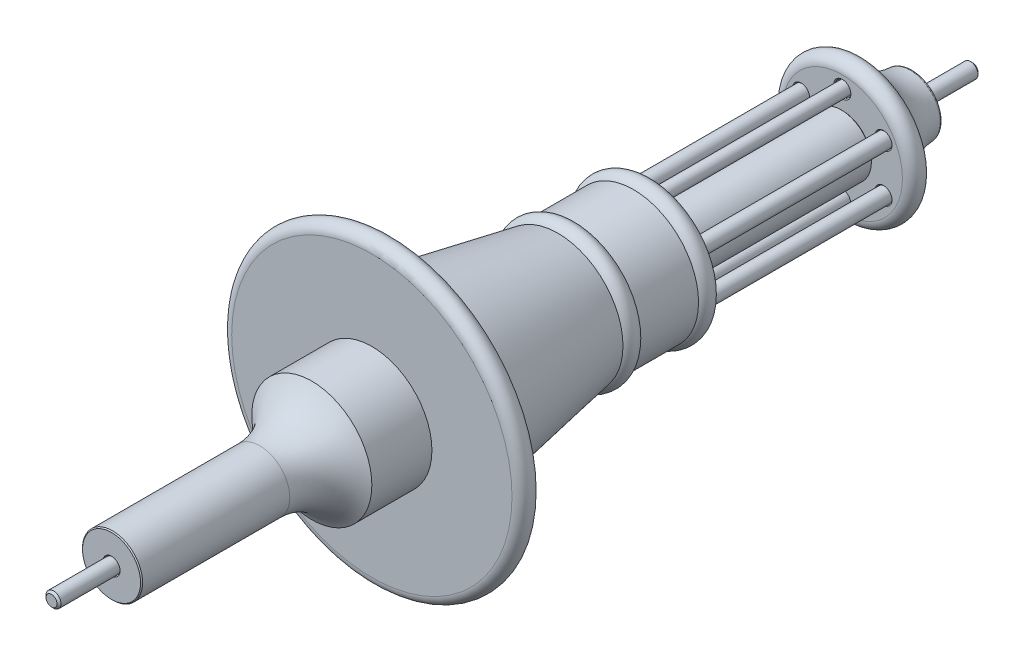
ISO-10303-21;
HEADER;
FILE_DESCRIPTION(('STEP AP214'),'2;1');
FILE_NAME('part.step','',(''),(''),'','','');
FILE_SCHEMA(('AUTOMOTIVE_DESIGN { 1 0 10303 214 1 1 1 1 }'));
ENDSEC;
DATA;
#1=APPLICATION_CONTEXT('core data for automotive mechanical design processes');
#2=APPLICATION_PROTOCOL_DEFINITION('international standard','automotive_design',2000,#1);
#3=PRODUCT_CONTEXT('',#1,'mechanical');
#4=PRODUCT('Part','Part','',(#3));
#5=PRODUCT_RELATED_PRODUCT_CATEGORY('part','',(#4));
#6=PRODUCT_DEFINITION_FORMATION('','',#4);
#7=PRODUCT_DEFINITION_CONTEXT('part definition',#1,'design');
#8=PRODUCT_DEFINITION('design','',#6,#7);
#9=PRODUCT_DEFINITION_SHAPE('','',#8);
#10=(LENGTH_UNIT() NAMED_UNIT(*) SI_UNIT(.MILLI.,.METRE.));
#11=(NAMED_UNIT(*) PLANE_ANGLE_UNIT() SI_UNIT($,.RADIAN.));
#12=(NAMED_UNIT(*) SI_UNIT($,.STERADIAN.) SOLID_ANGLE_UNIT());
#13=UNCERTAINTY_MEASURE_WITH_UNIT(LENGTH_MEASURE(1.E-05),#10,'distance_accuracy_value','');
#14=(GEOMETRIC_REPRESENTATION_CONTEXT(3) GLOBAL_UNCERTAINTY_ASSIGNED_CONTEXT((#13)) GLOBAL_UNIT_ASSIGNED_CONTEXT((#10,
#11,#12)) REPRESENTATION_CONTEXT('',''));
#15=CARTESIAN_POINT('',(0.,0.,0.));
#16=DIRECTION('',(0.,0.,1.));
#17=DIRECTION('',(1.,0.,0.));
#18=AXIS2_PLACEMENT_3D('',#15,#16,#17);
#19=CARTESIAN_POINT('',(-4.11362066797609,2.37499999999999,-52.));
#20=DIRECTION('',(0.,0.,-1.));
#21=DIRECTION('',(-1.,0.,0.));
#22=AXIS2_PLACEMENT_3D('',#19,#20,#21);
#23=PLANE('',#22);
#24=CARTESIAN_POINT('',(-4.11362066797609,2.37499999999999,-52.));
#25=DIRECTION('',(0.,0.,-1.));
#26=DIRECTION('',(-1.,0.,0.));
#27=AXIS2_PLACEMENT_3D('',#24,#25,#26);
#28=CIRCLE('',#27,0.649999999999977);
#29=CARTESIAN_POINT('',(-4.76362066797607,2.37499999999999,-52.));
#30=VERTEX_POINT('',#29);
#31=EDGE_CURVE('E47',#30,#30,#28,.F.);
#32=ORIENTED_EDGE('',*,*,#31,.T.);
#33=EDGE_LOOP('',(#32));
#34=FACE_BOUND('',#33,.T.);
#35=ADVANCED_FACE('F40',(#34),#23,.F.);
#36=CARTESIAN_POINT('',(-4.11362066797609,2.37499999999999,-77.1213203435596));
#37=DIRECTION('',(0.,0.,1.));
#38=DIRECTION('',(1.,0.,0.));
#39=AXIS2_PLACEMENT_3D('',#36,#37,#38);
#40=CYLINDRICAL_SURFACE('',#39,0.750000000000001);
#41=CARTESIAN_POINT('',(-4.11362066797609,2.37499999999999,-52.1));
#42=DIRECTION('',(0.,0.,-1.));
#43=DIRECTION('',(-1.,0.,0.));
#44=AXIS2_PLACEMENT_3D('',#41,#42,#43);
#45=CIRCLE('',#44,0.750000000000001);
#46=CARTESIAN_POINT('',(-3.36362066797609,2.37499999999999,-52.1));
#47=VERTEX_POINT('',#46);
#48=EDGE_CURVE('E51',#47,#47,#45,.T.);
#49=CARTESIAN_POINT('',(-4.11362066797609,2.37499999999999,-74.9));
#50=DIRECTION('',(0.,0.,1.));
#51=DIRECTION('',(1.,0.,0.));
#52=AXIS2_PLACEMENT_3D('',#49,#50,#51);
#53=CIRCLE('',#52,0.750000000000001);
#54=CARTESIAN_POINT('',(-3.36362066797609,2.37499999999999,-74.9));
#55=VERTEX_POINT('',#54);
#56=EDGE_CURVE('E55',#55,#55,#53,.T.);
#57=CARTESIAN_POINT('',(-3.36362066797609,2.37499999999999,-52.1));
#58=CARTESIAN_POINT('',(-3.36362066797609,2.37499999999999,-52.3375));
#59=CARTESIAN_POINT('',(-3.36362066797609,2.37499999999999,-52.575));
#60=CARTESIAN_POINT('',(-3.36362066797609,2.37499999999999,-53.05));
#61=CARTESIAN_POINT('',(-3.36362066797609,2.37499999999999,-53.2875));
#62=CARTESIAN_POINT('',(-3.36362066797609,2.37499999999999,-53.7625));
#63=CARTESIAN_POINT('',(-3.36362066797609,2.37499999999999,-54.));
#64=CARTESIAN_POINT('',(-3.36362066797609,2.37499999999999,-54.475));
#65=CARTESIAN_POINT('',(-3.36362066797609,2.37499999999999,-54.7125));
#66=CARTESIAN_POINT('',(-3.36362066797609,2.37499999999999,-55.1875));
#67=CARTESIAN_POINT('',(-3.36362066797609,2.37499999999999,-55.425));
#68=CARTESIAN_POINT('',(-3.36362066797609,2.37499999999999,-55.9));
#69=CARTESIAN_POINT('',(-3.36362066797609,2.37499999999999,-56.1375));
#70=CARTESIAN_POINT('',(-3.36362066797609,2.37499999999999,-56.6125));
#71=CARTESIAN_POINT('',(-3.36362066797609,2.37499999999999,-56.85));
#72=CARTESIAN_POINT('',(-3.36362066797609,2.37499999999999,-57.325));
#73=CARTESIAN_POINT('',(-3.36362066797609,2.37499999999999,-57.5625));
#74=CARTESIAN_POINT('',(-3.36362066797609,2.37499999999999,-58.0375));
#75=CARTESIAN_POINT('',(-3.36362066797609,2.37499999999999,-58.275));
#76=CARTESIAN_POINT('',(-3.36362066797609,2.37499999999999,-58.75));
#77=CARTESIAN_POINT('',(-3.36362066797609,2.37499999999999,-58.9875));
#78=CARTESIAN_POINT('',(-3.36362066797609,2.37499999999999,-59.4625));
#79=CARTESIAN_POINT('',(-3.36362066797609,2.37499999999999,-59.7));
#80=CARTESIAN_POINT('',(-3.36362066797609,2.37499999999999,-60.175));
#81=CARTESIAN_POINT('',(-3.36362066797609,2.37499999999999,-60.4125));
#82=CARTESIAN_POINT('',(-3.36362066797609,2.37499999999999,-60.8875));
#83=CARTESIAN_POINT('',(-3.36362066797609,2.37499999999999,-61.125));
#84=CARTESIAN_POINT('',(-3.36362066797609,2.37499999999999,-61.6));
#85=CARTESIAN_POINT('',(-3.36362066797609,2.37499999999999,-61.8375));
#86=CARTESIAN_POINT('',(-3.36362066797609,2.37499999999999,-62.3125));
#87=CARTESIAN_POINT('',(-3.36362066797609,2.37499999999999,-62.55));
#88=CARTESIAN_POINT('',(-3.36362066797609,2.37499999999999,-63.025));
#89=CARTESIAN_POINT('',(-3.36362066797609,2.37499999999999,-63.2625));
#90=CARTESIAN_POINT('',(-3.36362066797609,2.37499999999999,-63.7375));
#91=CARTESIAN_POINT('',(-3.36362066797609,2.37499999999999,-63.975));
#92=CARTESIAN_POINT('',(-3.36362066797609,2.37499999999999,-64.45));
#93=CARTESIAN_POINT('',(-3.36362066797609,2.37499999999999,-64.6875));
#94=CARTESIAN_POINT('',(-3.36362066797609,2.37499999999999,-65.1625));
#95=CARTESIAN_POINT('',(-3.36362066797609,2.37499999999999,-65.4));
#96=CARTESIAN_POINT('',(-3.36362066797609,2.37499999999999,-65.875));
#97=CARTESIAN_POINT('',(-3.36362066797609,2.37499999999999,-66.1125));
#98=CARTESIAN_POINT('',(-3.36362066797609,2.37499999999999,-66.5875));
#99=CARTESIAN_POINT('',(-3.36362066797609,2.37499999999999,-66.825));
#100=CARTESIAN_POINT('',(-3.36362066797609,2.37499999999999,-67.3));
#101=CARTESIAN_POINT('',(-3.36362066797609,2.37499999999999,-67.5375));
#102=CARTESIAN_POINT('',(-3.36362066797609,2.37499999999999,-68.0125));
#103=CARTESIAN_POINT('',(-3.36362066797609,2.37499999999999,-68.25));
#104=CARTESIAN_POINT('',(-3.36362066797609,2.37499999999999,-68.725));
#105=CARTESIAN_POINT('',(-3.36362066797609,2.37499999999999,-68.9625));
#106=CARTESIAN_POINT('',(-3.36362066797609,2.37499999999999,-69.4375));
#107=CARTESIAN_POINT('',(-3.36362066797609,2.37499999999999,-69.675));
#108=CARTESIAN_POINT('',(-3.36362066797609,2.37499999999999,-70.15));
#109=CARTESIAN_POINT('',(-3.36362066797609,2.37499999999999,-70.3875));
#110=CARTESIAN_POINT('',(-3.36362066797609,2.37499999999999,-70.8625));
#111=CARTESIAN_POINT('',(-3.36362066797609,2.37499999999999,-71.1));
#112=CARTESIAN_POINT('',(-3.36362066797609,2.37499999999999,-71.575));
#113=CARTESIAN_POINT('',(-3.36362066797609,2.37499999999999,-71.8125));
#114=CARTESIAN_POINT('',(-3.36362066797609,2.37499999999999,-72.2875));
#115=CARTESIAN_POINT('',(-3.36362066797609,2.37499999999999,-72.525));
#116=CARTESIAN_POINT('',(-3.36362066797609,2.37499999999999,-73.));
#117=CARTESIAN_POINT('',(-3.36362066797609,2.37499999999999,-73.2375));
#118=CARTESIAN_POINT('',(-3.36362066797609,2.37499999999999,-73.7125));
#119=CARTESIAN_POINT('',(-3.36362066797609,2.37499999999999,-73.95));
#120=CARTESIAN_POINT('',(-3.36362066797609,2.37499999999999,-74.425));
#121=CARTESIAN_POINT('',(-3.36362066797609,2.37499999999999,-74.6625));
#122=CARTESIAN_POINT('',(-3.36362066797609,2.37499999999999,-74.9));
#123=B_SPLINE_CURVE_WITH_KNOTS('',3,(#57,#58,#59,#60,#61,#62,#63,#64,#65,#66,#67,#68,#69,#70,
#71,#72,#73,#74,#75,#76,#77,#78,#79,#80,#81,#82,#83,#84,#85,#86,#87,#88,#89,#90,#91,#92,#93,#94,
#95,#96,#97,#98,#99,#100,#101,#102,#103,#104,#105,#106,#107,#108,#109,#110,#111,#112,#113,#114,
#115,#116,#117,#118,#119,#120,#121,#122),.UNSPECIFIED.,.F.,.F.,(4,2,2,2,2,2,2,2,2,2,2,2,2,2,2,2,
2,2,2,2,2,2,2,2,2,2,2,2,2,2,2,2,4),(0.,0.712499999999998,1.425,2.1375,2.84999999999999,3.5625,
4.275,4.98749999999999,5.7,6.4125,7.12499999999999,7.8375,8.55,9.26249999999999,9.975,10.6875,
11.4,12.1125,12.825,13.5375,14.25,14.9625,15.675,16.3875,17.1,17.8125,18.525,19.2375,19.95,
20.6625,21.375,22.0875,22.8),.UNSPECIFIED.);
#124=EDGE_CURVE('BSEAM61',#47,#55,#123,.T.);
#125=ORIENTED_EDGE('',*,*,#48,.T.);
#126=ORIENTED_EDGE('',*,*,#56,.T.);
#127=ORIENTED_EDGE('',*,*,#124,.T.);
#128=ORIENTED_EDGE('',*,*,#124,.F.);
#129=EDGE_LOOP('',(#125,#127,#126,#128));
#130=FACE_BOUND('',#129,.T.);
#131=ADVANCED_FACE('F61',(#130),#40,.T.);
#132=CARTESIAN_POINT('',(4.11362066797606,2.37500000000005,-75.));
#133=DIRECTION('',(0.,0.,1.));
#134=DIRECTION('',(1.,0.,0.));
#135=AXIS2_PLACEMENT_3D('',#132,#133,#134);
#136=PLANE('',#135);
#137=CARTESIAN_POINT('',(-4.11362066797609,2.37499999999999,-75.));
#138=DIRECTION('',(0.,0.,1.));
#139=DIRECTION('',(1.,0.,0.));
#140=AXIS2_PLACEMENT_3D('',#137,#138,#139);
#141=CIRCLE('',#140,0.65);
#142=CARTESIAN_POINT('',(-3.46362066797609,2.37499999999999,-75.));
#143=VERTEX_POINT('',#142);
#144=EDGE_CURVE('E11',#143,#143,#141,.F.);
#145=ORIENTED_EDGE('',*,*,#144,.T.);
#146=EDGE_LOOP('',(#145));
#147=FACE_BOUND('',#146,.T.);
#148=ADVANCED_FACE('F69',(#147),#136,.F.);
#149=CARTESIAN_POINT('',(-4.11362066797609,2.37499999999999,-52.1));
#150=DIRECTION('',(0.,0.,-1.));
#151=DIRECTION('',(-1.,0.,0.));
#152=AXIS2_PLACEMENT_3D('',#149,#150,#151);
#153=CONICAL_SURFACE('',#152,0.750000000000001,0.785398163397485);
#154=ORIENTED_EDGE('',*,*,#31,.F.);
#155=EDGE_LOOP('',(#154));
#156=FACE_BOUND('',#155,.T.);
#157=ORIENTED_EDGE('',*,*,#48,.F.);
#158=EDGE_LOOP('',(#157));
#159=FACE_BOUND('',#158,.T.);
#160=ADVANCED_FACE('F64',(#156,#159),#153,.T.);
#161=CARTESIAN_POINT('',(-4.11362066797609,2.37499999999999,-74.9));
#162=DIRECTION('',(0.,0.,1.));
#163=DIRECTION('',(1.,0.,0.));
#164=AXIS2_PLACEMENT_3D('',#161,#162,#163);
#165=CONICAL_SURFACE('',#164,0.750000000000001,0.785398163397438);
#166=ORIENTED_EDGE('',*,*,#144,.F.);
#167=EDGE_LOOP('',(#166));
#168=FACE_BOUND('',#167,.T.);
#169=ORIENTED_EDGE('',*,*,#56,.F.);
#170=EDGE_LOOP('',(#169));
#171=FACE_BOUND('',#170,.T.);
#172=ADVANCED_FACE('F42',(#168,#171),#165,.T.);
#173=CLOSED_SHELL('',(#35,#131,#148,#160,#172));
#174=MANIFOLD_SOLID_BREP('B2',#173);
#175=CARTESIAN_POINT('',(-4.11362066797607,-2.37500000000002,-52.));
#176=DIRECTION('',(0.,0.,-1.));
#177=DIRECTION('',(-1.,0.,0.));
#178=AXIS2_PLACEMENT_3D('',#175,#176,#177);
#179=PLANE('',#178);
#180=CARTESIAN_POINT('',(-4.11362066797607,-2.37500000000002,-52.));
#181=DIRECTION('',(0.,0.,-1.));
#182=DIRECTION('',(-1.,0.,0.));
#183=AXIS2_PLACEMENT_3D('',#180,#181,#182);
#184=CIRCLE('',#183,0.649999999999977);
#185=CARTESIAN_POINT('',(-4.76362066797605,-2.37500000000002,-52.));
#186=VERTEX_POINT('',#185);
#187=EDGE_CURVE('E126',#186,#186,#184,.F.);
#188=ORIENTED_EDGE('',*,*,#187,.T.);
#189=EDGE_LOOP('',(#188));
#190=FACE_BOUND('',#189,.T.);
#191=ADVANCED_FACE('F119',(#190),#179,.F.);
#192=CARTESIAN_POINT('',(-4.11362066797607,-2.37500000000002,-77.1213203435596));
#193=DIRECTION('',(0.,0.,1.));
#194=DIRECTION('',(1.,0.,0.));
#195=AXIS2_PLACEMENT_3D('',#192,#193,#194);
#196=CYLINDRICAL_SURFACE('',#195,0.750000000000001);
#197=CARTESIAN_POINT('',(-4.11362066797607,-2.37500000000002,-52.1));
#198=DIRECTION('',(0.,0.,-1.));
#199=DIRECTION('',(-1.,0.,0.));
#200=AXIS2_PLACEMENT_3D('',#197,#198,#199);
#201=CIRCLE('',#200,0.750000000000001);
#202=CARTESIAN_POINT('',(-3.36362066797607,-2.37500000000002,-52.1));
#203=VERTEX_POINT('',#202);
#204=EDGE_CURVE('E130',#203,#203,#201,.T.);
#205=CARTESIAN_POINT('',(-4.11362066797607,-2.37500000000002,-74.9));
#206=DIRECTION('',(0.,0.,1.));
#207=DIRECTION('',(1.,0.,0.));
#208=AXIS2_PLACEMENT_3D('',#205,#206,#207);
#209=CIRCLE('',#208,0.750000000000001);
#210=CARTESIAN_POINT('',(-3.36362066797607,-2.37500000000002,-74.9));
#211=VERTEX_POINT('',#210);
#212=EDGE_CURVE('E134',#211,#211,#209,.T.);
#213=CARTESIAN_POINT('',(-3.36362066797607,-2.37500000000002,-52.1));
#214=CARTESIAN_POINT('',(-3.36362066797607,-2.37500000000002,-52.3375));
#215=CARTESIAN_POINT('',(-3.36362066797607,-2.37500000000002,-52.575));
#216=CARTESIAN_POINT('',(-3.36362066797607,-2.37500000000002,-53.05));
#217=CARTESIAN_POINT('',(-3.36362066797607,-2.37500000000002,-53.2875));
#218=CARTESIAN_POINT('',(-3.36362066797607,-2.37500000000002,-53.7625));
#219=CARTESIAN_POINT('',(-3.36362066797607,-2.37500000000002,-54.));
#220=CARTESIAN_POINT('',(-3.36362066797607,-2.37500000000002,-54.475));
#221=CARTESIAN_POINT('',(-3.36362066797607,-2.37500000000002,-54.7125));
#222=CARTESIAN_POINT('',(-3.36362066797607,-2.37500000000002,-55.1875));
#223=CARTESIAN_POINT('',(-3.36362066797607,-2.37500000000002,-55.425));
#224=CARTESIAN_POINT('',(-3.36362066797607,-2.37500000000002,-55.9));
#225=CARTESIAN_POINT('',(-3.36362066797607,-2.37500000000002,-56.1375));
#226=CARTESIAN_POINT('',(-3.36362066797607,-2.37500000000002,-56.6125));
#227=CARTESIAN_POINT('',(-3.36362066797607,-2.37500000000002,-56.85));
#228=CARTESIAN_POINT('',(-3.36362066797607,-2.37500000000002,-57.325));
#229=CARTESIAN_POINT('',(-3.36362066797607,-2.37500000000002,-57.5625));
#230=CARTESIAN_POINT('',(-3.36362066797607,-2.37500000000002,-58.0375));
#231=CARTESIAN_POINT('',(-3.36362066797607,-2.37500000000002,-58.275));
#232=CARTESIAN_POINT('',(-3.36362066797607,-2.37500000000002,-58.75));
#233=CARTESIAN_POINT('',(-3.36362066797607,-2.37500000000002,-58.9875));
#234=CARTESIAN_POINT('',(-3.36362066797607,-2.37500000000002,-59.4625));
#235=CARTESIAN_POINT('',(-3.36362066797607,-2.37500000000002,-59.7));
#236=CARTESIAN_POINT('',(-3.36362066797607,-2.37500000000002,-60.175));
#237=CARTESIAN_POINT('',(-3.36362066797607,-2.37500000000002,-60.4125));
#238=CARTESIAN_POINT('',(-3.36362066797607,-2.37500000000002,-60.8875));
#239=CARTESIAN_POINT('',(-3.36362066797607,-2.37500000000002,-61.125));
#240=CARTESIAN_POINT('',(-3.36362066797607,-2.37500000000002,-61.6));
#241=CARTESIAN_POINT('',(-3.36362066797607,-2.37500000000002,-61.8375));
#242=CARTESIAN_POINT('',(-3.36362066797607,-2.37500000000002,-62.3125));
#243=CARTESIAN_POINT('',(-3.36362066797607,-2.37500000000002,-62.55));
#244=CARTESIAN_POINT('',(-3.36362066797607,-2.37500000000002,-63.025));
#245=CARTESIAN_POINT('',(-3.36362066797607,-2.37500000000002,-63.2625));
#246=CARTESIAN_POINT('',(-3.36362066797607,-2.37500000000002,-63.7375));
#247=CARTESIAN_POINT('',(-3.36362066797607,-2.37500000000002,-63.975));
#248=CARTESIAN_POINT('',(-3.36362066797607,-2.37500000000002,-64.45));
#249=CARTESIAN_POINT('',(-3.36362066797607,-2.37500000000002,-64.6875));
#250=CARTESIAN_POINT('',(-3.36362066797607,-2.37500000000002,-65.1625));
#251=CARTESIAN_POINT('',(-3.36362066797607,-2.37500000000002,-65.4));
#252=CARTESIAN_POINT('',(-3.36362066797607,-2.37500000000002,-65.875));
#253=CARTESIAN_POINT('',(-3.36362066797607,-2.37500000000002,-66.1125));
#254=CARTESIAN_POINT('',(-3.36362066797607,-2.37500000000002,-66.5875));
#255=CARTESIAN_POINT('',(-3.36362066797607,-2.37500000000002,-66.825));
#256=CARTESIAN_POINT('',(-3.36362066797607,-2.37500000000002,-67.3));
#257=CARTESIAN_POINT('',(-3.36362066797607,-2.37500000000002,-67.5375));
#258=CARTESIAN_POINT('',(-3.36362066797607,-2.37500000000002,-68.0125));
#259=CARTESIAN_POINT('',(-3.36362066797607,-2.37500000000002,-68.25));
#260=CARTESIAN_POINT('',(-3.36362066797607,-2.37500000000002,-68.725));
#261=CARTESIAN_POINT('',(-3.36362066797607,-2.37500000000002,-68.9625));
#262=CARTESIAN_POINT('',(-3.36362066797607,-2.37500000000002,-69.4375));
#263=CARTESIAN_POINT('',(-3.36362066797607,-2.37500000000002,-69.675));
#264=CARTESIAN_POINT('',(-3.36362066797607,-2.37500000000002,-70.15));
#265=CARTESIAN_POINT('',(-3.36362066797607,-2.37500000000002,-70.3875));
#266=CARTESIAN_POINT('',(-3.36362066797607,-2.37500000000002,-70.8625));
#267=CARTESIAN_POINT('',(-3.36362066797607,-2.37500000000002,-71.1));
#268=CARTESIAN_POINT('',(-3.36362066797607,-2.37500000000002,-71.575));
#269=CARTESIAN_POINT('',(-3.36362066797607,-2.37500000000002,-71.8125));
#270=CARTESIAN_POINT('',(-3.36362066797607,-2.37500000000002,-72.2875));
#271=CARTESIAN_POINT('',(-3.36362066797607,-2.37500000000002,-72.525));
#272=CARTESIAN_POINT('',(-3.36362066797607,-2.37500000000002,-73.));
#273=CARTESIAN_POINT('',(-3.36362066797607,-2.37500000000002,-73.2375));
#274=CARTESIAN_POINT('',(-3.36362066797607,-2.37500000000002,-73.7125));
#275=CARTESIAN_POINT('',(-3.36362066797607,-2.37500000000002,-73.95));
#276=CARTESIAN_POINT('',(-3.36362066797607,-2.37500000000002,-74.425));
#277=CARTESIAN_POINT('',(-3.36362066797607,-2.37500000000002,-74.6625));
#278=CARTESIAN_POINT('',(-3.36362066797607,-2.37500000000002,-74.9));
#279=B_SPLINE_CURVE_WITH_KNOTS('',3,(#213,#214,#215,#216,#217,#218,#219,#220,#221,#222,#223,
#224,#225,#226,#227,#228,#229,#230,#231,#232,#233,#234,#235,#236,#237,#238,#239,#240,#241,#242,
#243,#244,#245,#246,#247,#248,#249,#250,#251,#252,#253,#254,#255,#256,#257,#258,#259,#260,#261,
#262,#263,#264,#265,#266,#267,#268,#269,#270,#271,#272,#273,#274,#275,#276,#277,#278),
.UNSPECIFIED.,.F.,.F.,(4,2,2,2,2,2,2,2,2,2,2,2,2,2,2,2,2,2,2,2,2,2,2,2,2,2,2,2,2,2,2,2,4),(0.,
0.712499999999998,1.425,2.1375,2.84999999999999,3.5625,4.275,4.98749999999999,5.7,6.4125,
7.12499999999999,7.8375,8.55,9.26249999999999,9.975,10.6875,11.4,12.1125,12.825,13.5375,14.25,
14.9625,15.675,16.3875,17.1,17.8125,18.525,19.2375,19.95,20.6625,21.375,22.0875,22.8),.UNSPECIFIED.);
#280=EDGE_CURVE('BSEAM140',#203,#211,#279,.T.);
#281=ORIENTED_EDGE('',*,*,#204,.T.);
#282=ORIENTED_EDGE('',*,*,#212,.T.);
#283=ORIENTED_EDGE('',*,*,#280,.T.);
#284=ORIENTED_EDGE('',*,*,#280,.F.);
#285=EDGE_LOOP('',(#281,#283,#282,#284));
#286=FACE_BOUND('',#285,.T.);
#287=ADVANCED_FACE('F140',(#286),#196,.T.);
#288=CARTESIAN_POINT('',(4.11362066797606,2.37500000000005,-75.));
#289=DIRECTION('',(0.,0.,1.));
#290=DIRECTION('',(1.,0.,0.));
#291=AXIS2_PLACEMENT_3D('',#288,#289,#290);
#292=PLANE('',#291);
#293=CARTESIAN_POINT('',(-4.11362066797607,-2.37500000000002,-75.));
#294=DIRECTION('',(0.,0.,1.));
#295=DIRECTION('',(1.,0.,0.));
#296=AXIS2_PLACEMENT_3D('',#293,#294,#295);
#297=CIRCLE('',#296,0.65);
#298=CARTESIAN_POINT('',(-3.46362066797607,-2.37500000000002,-75.));
#299=VERTEX_POINT('',#298);
#300=EDGE_CURVE('E39',#299,#299,#297,.F.);
#301=ORIENTED_EDGE('',*,*,#300,.T.);
#302=EDGE_LOOP('',(#301));
#303=FACE_BOUND('',#302,.T.);
#304=ADVANCED_FACE('F148',(#303),#292,.F.);
#305=CARTESIAN_POINT('',(-4.11362066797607,-2.37500000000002,-52.1));
#306=DIRECTION('',(0.,0.,-1.));
#307=DIRECTION('',(-1.,0.,0.));
#308=AXIS2_PLACEMENT_3D('',#305,#306,#307);
#309=CONICAL_SURFACE('',#308,0.750000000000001,0.785398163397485);
#310=ORIENTED_EDGE('',*,*,#187,.F.);
#311=EDGE_LOOP('',(#310));
#312=FACE_BOUND('',#311,.T.);
#313=ORIENTED_EDGE('',*,*,#204,.F.);
#314=EDGE_LOOP('',(#313));
#315=FACE_BOUND('',#314,.T.);
#316=ADVANCED_FACE('F143',(#312,#315),#309,.T.);
#317=CARTESIAN_POINT('',(-4.11362066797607,-2.37500000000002,-74.9));
#318=DIRECTION('',(0.,0.,1.));
#319=DIRECTION('',(1.,0.,0.));
#320=AXIS2_PLACEMENT_3D('',#317,#318,#319);
#321=CONICAL_SURFACE('',#320,0.750000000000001,0.785398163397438);
#322=ORIENTED_EDGE('',*,*,#300,.F.);
#323=EDGE_LOOP('',(#322));
#324=FACE_BOUND('',#323,.T.);
#325=ORIENTED_EDGE('',*,*,#212,.F.);
#326=EDGE_LOOP('',(#325));
#327=FACE_BOUND('',#326,.T.);
#328=ADVANCED_FACE('F121',(#324,#327),#321,.T.);
#329=CLOSED_SHELL('',(#191,#287,#304,#316,#328));
#330=MANIFOLD_SOLID_BREP('B6',#329);
#331=CARTESIAN_POINT('',(0.,-4.75,-52.));
#332=DIRECTION('',(0.,0.,-1.));
#333=DIRECTION('',(-1.,0.,0.));
#334=AXIS2_PLACEMENT_3D('',#331,#332,#333);
#335=PLANE('',#334);
#336=CARTESIAN_POINT('',(0.,-4.75,-52.));
#337=DIRECTION('',(0.,0.,-1.));
#338=DIRECTION('',(-1.,0.,0.));
#339=AXIS2_PLACEMENT_3D('',#336,#337,#338);
#340=CIRCLE('',#339,0.649999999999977);
#341=CARTESIAN_POINT('',(-0.649999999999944,-4.75,-52.));
#342=VERTEX_POINT('',#341);
#343=EDGE_CURVE('E205',#342,#342,#340,.F.);
#344=ORIENTED_EDGE('',*,*,#343,.T.);
#345=EDGE_LOOP('',(#344));
#346=FACE_BOUND('',#345,.T.);
#347=ADVANCED_FACE('F198',(#346),#335,.F.);
#348=CARTESIAN_POINT('',(0.,-4.75,-77.1213203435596));
#349=DIRECTION('',(0.,0.,1.));
#350=DIRECTION('',(1.,0.,0.));
#351=AXIS2_PLACEMENT_3D('',#348,#349,#350);
#352=CYLINDRICAL_SURFACE('',#351,0.75);
#353=CARTESIAN_POINT('',(0.,-4.75,-52.1));
#354=DIRECTION('',(0.,0.,-1.));
#355=DIRECTION('',(-1.,0.,0.));
#356=AXIS2_PLACEMENT_3D('',#353,#354,#355);
#357=CIRCLE('',#356,0.75);
#358=CARTESIAN_POINT('',(0.750000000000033,-4.75,-52.1));
#359=VERTEX_POINT('',#358);
#360=EDGE_CURVE('E209',#359,#359,#357,.T.);
#361=CARTESIAN_POINT('',(0.,-4.75,-74.9));
#362=DIRECTION('',(0.,0.,1.));
#363=DIRECTION('',(1.,0.,0.));
#364=AXIS2_PLACEMENT_3D('',#361,#362,#363);
#365=CIRCLE('',#364,0.75);
#366=CARTESIAN_POINT('',(0.750000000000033,-4.75,-74.9));
#367=VERTEX_POINT('',#366);
#368=EDGE_CURVE('E213',#367,#367,#365,.T.);
#369=CARTESIAN_POINT('',(0.750000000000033,-4.75,-52.1));
#370=CARTESIAN_POINT('',(0.750000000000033,-4.75,-52.3375));
#371=CARTESIAN_POINT('',(0.750000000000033,-4.75,-52.575));
#372=CARTESIAN_POINT('',(0.750000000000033,-4.75,-53.05));
#373=CARTESIAN_POINT('',(0.750000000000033,-4.75,-53.2875));
#374=CARTESIAN_POINT('',(0.750000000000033,-4.75,-53.7625));
#375=CARTESIAN_POINT('',(0.750000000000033,-4.75,-54.));
#376=CARTESIAN_POINT('',(0.750000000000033,-4.75,-54.475));
#377=CARTESIAN_POINT('',(0.750000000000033,-4.75,-54.7125));
#378=CARTESIAN_POINT('',(0.750000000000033,-4.75,-55.1875));
#379=CARTESIAN_POINT('',(0.750000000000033,-4.75,-55.425));
#380=CARTESIAN_POINT('',(0.750000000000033,-4.75,-55.9));
#381=CARTESIAN_POINT('',(0.750000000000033,-4.75,-56.1375));
#382=CARTESIAN_POINT('',(0.750000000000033,-4.75,-56.6125));
#383=CARTESIAN_POINT('',(0.750000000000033,-4.75,-56.85));
#384=CARTESIAN_POINT('',(0.750000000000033,-4.75,-57.325));
#385=CARTESIAN_POINT('',(0.750000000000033,-4.75,-57.5625));
#386=CARTESIAN_POINT('',(0.750000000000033,-4.75,-58.0375));
#387=CARTESIAN_POINT('',(0.750000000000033,-4.75,-58.275));
#388=CARTESIAN_POINT('',(0.750000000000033,-4.75,-58.75));
#389=CARTESIAN_POINT('',(0.750000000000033,-4.75,-58.9875));
#390=CARTESIAN_POINT('',(0.750000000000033,-4.75,-59.4625));
#391=CARTESIAN_POINT('',(0.750000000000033,-4.75,-59.7));
#392=CARTESIAN_POINT('',(0.750000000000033,-4.75,-60.175));
#393=CARTESIAN_POINT('',(0.750000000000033,-4.75,-60.4125));
#394=CARTESIAN_POINT('',(0.750000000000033,-4.75,-60.8875));
#395=CARTESIAN_POINT('',(0.750000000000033,-4.75,-61.125));
#396=CARTESIAN_POINT('',(0.750000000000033,-4.75,-61.6));
#397=CARTESIAN_POINT('',(0.750000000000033,-4.75,-61.8375));
#398=CARTESIAN_POINT('',(0.750000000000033,-4.75,-62.3125));
#399=CARTESIAN_POINT('',(0.750000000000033,-4.75,-62.55));
#400=CARTESIAN_POINT('',(0.750000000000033,-4.75,-63.025));
#401=CARTESIAN_POINT('',(0.750000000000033,-4.75,-63.2625));
#402=CARTESIAN_POINT('',(0.750000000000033,-4.75,-63.7375));
#403=CARTESIAN_POINT('',(0.750000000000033,-4.75,-63.975));
#404=CARTESIAN_POINT('',(0.750000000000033,-4.75,-64.45));
#405=CARTESIAN_POINT('',(0.750000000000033,-4.75,-64.6875));
#406=CARTESIAN_POINT('',(0.750000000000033,-4.75,-65.1625));
#407=CARTESIAN_POINT('',(0.750000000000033,-4.75,-65.4));
#408=CARTESIAN_POINT('',(0.750000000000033,-4.75,-65.875));
#409=CARTESIAN_POINT('',(0.750000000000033,-4.75,-66.1125));
#410=CARTESIAN_POINT('',(0.750000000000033,-4.75,-66.5875));
#411=CARTESIAN_POINT('',(0.750000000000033,-4.75,-66.825));
#412=CARTESIAN_POINT('',(0.750000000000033,-4.75,-67.3));
#413=CARTESIAN_POINT('',(0.750000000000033,-4.75,-67.5375));
#414=CARTESIAN_POINT('',(0.750000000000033,-4.75,-68.0125));
#415=CARTESIAN_POINT('',(0.750000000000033,-4.75,-68.25));
#416=CARTESIAN_POINT('',(0.750000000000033,-4.75,-68.725));
#417=CARTESIAN_POINT('',(0.750000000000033,-4.75,-68.9625));
#418=CARTESIAN_POINT('',(0.750000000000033,-4.75,-69.4375));
#419=CARTESIAN_POINT('',(0.750000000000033,-4.75,-69.675));
#420=CARTESIAN_POINT('',(0.750000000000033,-4.75,-70.15));
#421=CARTESIAN_POINT('',(0.750000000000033,-4.75,-70.3875));
#422=CARTESIAN_POINT('',(0.750000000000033,-4.75,-70.8625));
#423=CARTESIAN_POINT('',(0.750000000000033,-4.75,-71.1));
#424=CARTESIAN_POINT('',(0.750000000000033,-4.75,-71.575));
#425=CARTESIAN_POINT('',(0.750000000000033,-4.75,-71.8125));
#426=CARTESIAN_POINT('',(0.750000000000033,-4.75,-72.2875));
#427=CARTESIAN_POINT('',(0.750000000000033,-4.75,-72.525));
#428=CARTESIAN_POINT('',(0.750000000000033,-4.75,-73.));
#429=CARTESIAN_POINT('',(0.750000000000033,-4.75,-73.2375));
#430=CARTESIAN_POINT('',(0.750000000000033,-4.75,-73.7125));
#431=CARTESIAN_POINT('',(0.750000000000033,-4.75,-73.95));
#432=CARTESIAN_POINT('',(0.750000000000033,-4.75,-74.425));
#433=CARTESIAN_POINT('',(0.750000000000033,-4.75,-74.6625));
#434=CARTESIAN_POINT('',(0.750000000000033,-4.75,-74.9));
#435=B_SPLINE_CURVE_WITH_KNOTS('',3,(#369,#370,#371,#372,#373,#374,#375,#376,#377,#378,#379,
#380,#381,#382,#383,#384,#385,#386,#387,#388,#389,#390,#391,#392,#393,#394,#395,#396,#397,#398,
#399,#400,#401,#402,#403,#404,#405,#406,#407,#408,#409,#410,#411,#412,#413,#414,#415,#416,#417,
#418,#419,#420,#421,#422,#423,#424,#425,#426,#427,#428,#429,#430,#431,#432,#433,#434),
.UNSPECIFIED.,.F.,.F.,(4,2,2,2,2,2,2,2,2,2,2,2,2,2,2,2,2,2,2,2,2,2,2,2,2,2,2,2,2,2,2,2,4),(0.,
0.712500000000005,1.425,2.1375,2.85000000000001,3.5625,4.275,4.98750000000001,5.7,6.4125,
7.12500000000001,7.8375,8.55,9.26250000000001,9.975,10.6875,11.4,12.1125,12.825,13.5375,14.25,
14.9625,15.675,16.3875,17.1,17.8125,18.525,19.2375,19.95,20.6625,21.375,22.0875,22.8),.UNSPECIFIED.);
#436=EDGE_CURVE('BSEAM219',#359,#367,#435,.T.);
#437=ORIENTED_EDGE('',*,*,#360,.T.);
#438=ORIENTED_EDGE('',*,*,#368,.T.);
#439=ORIENTED_EDGE('',*,*,#436,.T.);
#440=ORIENTED_EDGE('',*,*,#436,.F.);
#441=EDGE_LOOP('',(#437,#439,#438,#440));
#442=FACE_BOUND('',#441,.T.);
#443=ADVANCED_FACE('F219',(#442),#352,.T.);
#444=CARTESIAN_POINT('',(4.11362066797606,2.37500000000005,-75.));
#445=DIRECTION('',(0.,0.,1.));
#446=DIRECTION('',(1.,0.,0.));
#447=AXIS2_PLACEMENT_3D('',#444,#445,#446);
#448=PLANE('',#447);
#449=CARTESIAN_POINT('',(0.,-4.75,-75.));
#450=DIRECTION('',(0.,0.,1.));
#451=DIRECTION('',(1.,0.,0.));
#452=AXIS2_PLACEMENT_3D('',#449,#450,#451);
#453=CIRCLE('',#452,0.649999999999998);
#454=CARTESIAN_POINT('',(0.650000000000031,-4.75,-75.));
#455=VERTEX_POINT('',#454);
#456=EDGE_CURVE('E118',#455,#455,#453,.F.);
#457=ORIENTED_EDGE('',*,*,#456,.T.);
#458=EDGE_LOOP('',(#457));
#459=FACE_BOUND('',#458,.T.);
#460=ADVANCED_FACE('F227',(#459),#448,.F.);
#461=CARTESIAN_POINT('',(0.,-4.75,-52.1));
#462=DIRECTION('',(0.,0.,-1.));
#463=DIRECTION('',(-1.,0.,0.));
#464=AXIS2_PLACEMENT_3D('',#461,#462,#463);
#465=CONICAL_SURFACE('',#464,0.75,0.785398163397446);
#466=ORIENTED_EDGE('',*,*,#343,.F.);
#467=EDGE_LOOP('',(#466));
#468=FACE_BOUND('',#467,.T.);
#469=ORIENTED_EDGE('',*,*,#360,.F.);
#470=EDGE_LOOP('',(#469));
#471=FACE_BOUND('',#470,.T.);
#472=ADVANCED_FACE('F222',(#468,#471),#465,.T.);
#473=CARTESIAN_POINT('',(0.,-4.75,-74.9));
#474=DIRECTION('',(0.,0.,1.));
#475=DIRECTION('',(1.,0.,0.));
#476=AXIS2_PLACEMENT_3D('',#473,#474,#475);
#477=CONICAL_SURFACE('',#476,0.75,0.785398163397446);
#478=ORIENTED_EDGE('',*,*,#456,.F.);
#479=EDGE_LOOP('',(#478));
#480=FACE_BOUND('',#479,.T.);
#481=ORIENTED_EDGE('',*,*,#368,.F.);
#482=EDGE_LOOP('',(#481));
#483=FACE_BOUND('',#482,.T.);
#484=ADVANCED_FACE('F200',(#480,#483),#477,.T.);
#485=CLOSED_SHELL('',(#347,#443,#460,#472,#484));
#486=MANIFOLD_SOLID_BREP('B34',#485);
#487=CARTESIAN_POINT('',(4.1136206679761,-2.37499999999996,-52.));
#488=DIRECTION('',(0.,0.,-1.));
#489=DIRECTION('',(-1.,0.,0.));
#490=AXIS2_PLACEMENT_3D('',#487,#488,#489);
#491=PLANE('',#490);
#492=CARTESIAN_POINT('',(4.1136206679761,-2.37499999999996,-52.));
#493=DIRECTION('',(0.,0.,-1.));
#494=DIRECTION('',(-1.,0.,0.));
#495=AXIS2_PLACEMENT_3D('',#492,#493,#494);
#496=CIRCLE('',#495,0.649999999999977);
#497=CARTESIAN_POINT('',(3.46362066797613,-2.37499999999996,-52.));
#498=VERTEX_POINT('',#497);
#499=EDGE_CURVE('E284',#498,#498,#496,.F.);
#500=ORIENTED_EDGE('',*,*,#499,.T.);
#501=EDGE_LOOP('',(#500));
#502=FACE_BOUND('',#501,.T.);
#503=ADVANCED_FACE('F277',(#502),#491,.F.);
#504=CARTESIAN_POINT('',(4.1136206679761,-2.37499999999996,-77.1213203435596));
#505=DIRECTION('',(0.,0.,1.));
#506=DIRECTION('',(1.,0.,0.));
#507=AXIS2_PLACEMENT_3D('',#504,#505,#506);
#508=CYLINDRICAL_SURFACE('',#507,0.75);
#509=CARTESIAN_POINT('',(4.1136206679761,-2.37499999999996,-52.1));
#510=DIRECTION('',(0.,0.,-1.));
#511=DIRECTION('',(-1.,0.,0.));
#512=AXIS2_PLACEMENT_3D('',#509,#510,#511);
#513=CIRCLE('',#512,0.75);
#514=CARTESIAN_POINT('',(4.8636206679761,-2.37499999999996,-52.1));
#515=VERTEX_POINT('',#514);
#516=EDGE_CURVE('E288',#515,#515,#513,.T.);
#517=CARTESIAN_POINT('',(4.1136206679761,-2.37499999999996,-74.9));
#518=DIRECTION('',(0.,0.,1.));
#519=DIRECTION('',(1.,0.,0.));
#520=AXIS2_PLACEMENT_3D('',#517,#518,#519);
#521=CIRCLE('',#520,0.75);
#522=CARTESIAN_POINT('',(4.8636206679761,-2.37499999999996,-74.9));
#523=VERTEX_POINT('',#522);
#524=EDGE_CURVE('E292',#523,#523,#521,.T.);
#525=CARTESIAN_POINT('',(4.8636206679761,-2.37499999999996,-52.1));
#526=CARTESIAN_POINT('',(4.8636206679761,-2.37499999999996,-52.3375));
#527=CARTESIAN_POINT('',(4.8636206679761,-2.37499999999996,-52.575));
#528=CARTESIAN_POINT('',(4.8636206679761,-2.37499999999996,-53.05));
#529=CARTESIAN_POINT('',(4.8636206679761,-2.37499999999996,-53.2875));
#530=CARTESIAN_POINT('',(4.8636206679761,-2.37499999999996,-53.7625));
#531=CARTESIAN_POINT('',(4.8636206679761,-2.37499999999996,-54.));
#532=CARTESIAN_POINT('',(4.8636206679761,-2.37499999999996,-54.475));
#533=CARTESIAN_POINT('',(4.8636206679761,-2.37499999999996,-54.7125));
#534=CARTESIAN_POINT('',(4.8636206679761,-2.37499999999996,-55.1875));
#535=CARTESIAN_POINT('',(4.8636206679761,-2.37499999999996,-55.425));
#536=CARTESIAN_POINT('',(4.8636206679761,-2.37499999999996,-55.9));
#537=CARTESIAN_POINT('',(4.8636206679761,-2.37499999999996,-56.1375));
#538=CARTESIAN_POINT('',(4.8636206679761,-2.37499999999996,-56.6125));
#539=CARTESIAN_POINT('',(4.8636206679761,-2.37499999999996,-56.85));
#540=CARTESIAN_POINT('',(4.8636206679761,-2.37499999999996,-57.325));
#541=CARTESIAN_POINT('',(4.8636206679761,-2.37499999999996,-57.5625));
#542=CARTESIAN_POINT('',(4.8636206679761,-2.37499999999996,-58.0375));
#543=CARTESIAN_POINT('',(4.8636206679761,-2.37499999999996,-58.275));
#544=CARTESIAN_POINT('',(4.8636206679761,-2.37499999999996,-58.75));
#545=CARTESIAN_POINT('',(4.8636206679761,-2.37499999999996,-58.9875));
#546=CARTESIAN_POINT('',(4.8636206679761,-2.37499999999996,-59.4625));
#547=CARTESIAN_POINT('',(4.8636206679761,-2.37499999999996,-59.7));
#548=CARTESIAN_POINT('',(4.8636206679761,-2.37499999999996,-60.175));
#549=CARTESIAN_POINT('',(4.8636206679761,-2.37499999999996,-60.4125));
#550=CARTESIAN_POINT('',(4.8636206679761,-2.37499999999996,-60.8875));
#551=CARTESIAN_POINT('',(4.8636206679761,-2.37499999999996,-61.125));
#552=CARTESIAN_POINT('',(4.8636206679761,-2.37499999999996,-61.6));
#553=CARTESIAN_POINT('',(4.8636206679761,-2.37499999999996,-61.8375));
#554=CARTESIAN_POINT('',(4.8636206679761,-2.37499999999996,-62.3125));
#555=CARTESIAN_POINT('',(4.8636206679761,-2.37499999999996,-62.55));
#556=CARTESIAN_POINT('',(4.8636206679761,-2.37499999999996,-63.025));
#557=CARTESIAN_POINT('',(4.8636206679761,-2.37499999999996,-63.2625));
#558=CARTESIAN_POINT('',(4.8636206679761,-2.37499999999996,-63.7375));
#559=CARTESIAN_POINT('',(4.8636206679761,-2.37499999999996,-63.975));
#560=CARTESIAN_POINT('',(4.8636206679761,-2.37499999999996,-64.45));
#561=CARTESIAN_POINT('',(4.8636206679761,-2.37499999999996,-64.6875));
#562=CARTESIAN_POINT('',(4.8636206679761,-2.37499999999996,-65.1625));
#563=CARTESIAN_POINT('',(4.8636206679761,-2.37499999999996,-65.4));
#564=CARTESIAN_POINT('',(4.8636206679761,-2.37499999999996,-65.875));
#565=CARTESIAN_POINT('',(4.8636206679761,-2.37499999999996,-66.1125));
#566=CARTESIAN_POINT('',(4.8636206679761,-2.37499999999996,-66.5875));
#567=CARTESIAN_POINT('',(4.8636206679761,-2.37499999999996,-66.825));
#568=CARTESIAN_POINT('',(4.8636206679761,-2.37499999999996,-67.3));
#569=CARTESIAN_POINT('',(4.8636206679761,-2.37499999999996,-67.5375));
#570=CARTESIAN_POINT('',(4.8636206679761,-2.37499999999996,-68.0125));
#571=CARTESIAN_POINT('',(4.8636206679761,-2.37499999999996,-68.25));
#572=CARTESIAN_POINT('',(4.8636206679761,-2.37499999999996,-68.725));
#573=CARTESIAN_POINT('',(4.8636206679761,-2.37499999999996,-68.9625));
#574=CARTESIAN_POINT('',(4.8636206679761,-2.37499999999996,-69.4375));
#575=CARTESIAN_POINT('',(4.8636206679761,-2.37499999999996,-69.675));
#576=CARTESIAN_POINT('',(4.8636206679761,-2.37499999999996,-70.15));
#577=CARTESIAN_POINT('',(4.8636206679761,-2.37499999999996,-70.3875));
#578=CARTESIAN_POINT('',(4.8636206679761,-2.37499999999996,-70.8625));
#579=CARTESIAN_POINT('',(4.8636206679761,-2.37499999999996,-71.1));
#580=CARTESIAN_POINT('',(4.8636206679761,-2.37499999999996,-71.575));
#581=CARTESIAN_POINT('',(4.8636206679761,-2.37499999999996,-71.8125));
#582=CARTESIAN_POINT('',(4.8636206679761,-2.37499999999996,-72.2875));
#583=CARTESIAN_POINT('',(4.8636206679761,-2.37499999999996,-72.525));
#584=CARTESIAN_POINT('',(4.8636206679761,-2.37499999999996,-73.));
#585=CARTESIAN_POINT('',(4.8636206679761,-2.37499999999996,-73.2375));
#586=CARTESIAN_POINT('',(4.8636206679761,-2.37499999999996,-73.7125));
#587=CARTESIAN_POINT('',(4.8636206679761,-2.37499999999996,-73.95));
#588=CARTESIAN_POINT('',(4.8636206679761,-2.37499999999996,-74.425));
#589=CARTESIAN_POINT('',(4.8636206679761,-2.37499999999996,-74.6625));
#590=CARTESIAN_POINT('',(4.8636206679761,-2.37499999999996,-74.9));
#591=B_SPLINE_CURVE_WITH_KNOTS('',3,(#525,#526,#527,#528,#529,#530,#531,#532,#533,#534,#535,
#536,#537,#538,#539,#540,#541,#542,#543,#544,#545,#546,#547,#548,#549,#550,#551,#552,#553,#554,
#555,#556,#557,#558,#559,#560,#561,#562,#563,#564,#565,#566,#567,#568,#569,#570,#571,#572,#573,
#574,#575,#576,#577,#578,#579,#580,#581,#582,#583,#584,#585,#586,#587,#588,#589,#590),
.UNSPECIFIED.,.F.,.F.,(4,2,2,2,2,2,2,2,2,2,2,2,2,2,2,2,2,2,2,2,2,2,2,2,2,2,2,2,2,2,2,2,4),(0.,
0.712499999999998,1.425,2.1375,2.84999999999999,3.5625,4.275,4.98749999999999,5.7,6.4125,
7.12499999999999,7.8375,8.55,9.26249999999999,9.975,10.6875,11.4,12.1125,12.825,13.5375,14.25,
14.9625,15.675,16.3875,17.1,17.8125,18.525,19.2375,19.95,20.6625,21.375,22.0875,22.8),.UNSPECIFIED.);
#592=EDGE_CURVE('BSEAM298',#515,#523,#591,.T.);
#593=ORIENTED_EDGE('',*,*,#516,.T.);
#594=ORIENTED_EDGE('',*,*,#524,.T.);
#595=ORIENTED_EDGE('',*,*,#592,.T.);
#596=ORIENTED_EDGE('',*,*,#592,.F.);
#597=EDGE_LOOP('',(#593,#595,#594,#596));
#598=FACE_BOUND('',#597,.T.);
#599=ADVANCED_FACE('F298',(#598),#508,.T.);
#600=CARTESIAN_POINT('',(4.11362066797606,2.37500000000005,-75.));
#601=DIRECTION('',(0.,0.,1.));
#602=DIRECTION('',(1.,0.,0.));
#603=AXIS2_PLACEMENT_3D('',#600,#601,#602);
#604=PLANE('',#603);
#605=CARTESIAN_POINT('',(4.1136206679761,-2.37499999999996,-75.));
#606=DIRECTION('',(0.,0.,1.));
#607=DIRECTION('',(1.,0.,0.));
#608=AXIS2_PLACEMENT_3D('',#605,#606,#607);
#609=CIRCLE('',#608,0.650000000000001);
#610=CARTESIAN_POINT('',(4.76362066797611,-2.37499999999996,-75.));
#611=VERTEX_POINT('',#610);
#612=EDGE_CURVE('E197',#611,#611,#609,.F.);
#613=ORIENTED_EDGE('',*,*,#612,.T.);
#614=EDGE_LOOP('',(#613));
#615=FACE_BOUND('',#614,.T.);
#616=ADVANCED_FACE('F306',(#615),#604,.F.);
#617=CARTESIAN_POINT('',(4.1136206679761,-2.37499999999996,-52.1));
#618=DIRECTION('',(0.,0.,-1.));
#619=DIRECTION('',(-1.,0.,0.));
#620=AXIS2_PLACEMENT_3D('',#617,#618,#619);
#621=CONICAL_SURFACE('',#620,0.75,0.785398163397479);
#622=ORIENTED_EDGE('',*,*,#499,.F.);
#623=EDGE_LOOP('',(#622));
#624=FACE_BOUND('',#623,.T.);
#625=ORIENTED_EDGE('',*,*,#516,.F.);
#626=EDGE_LOOP('',(#625));
#627=FACE_BOUND('',#626,.T.);
#628=ADVANCED_FACE('F301',(#624,#627),#621,.T.);
#629=CARTESIAN_POINT('',(4.1136206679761,-2.37499999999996,-74.9));
#630=DIRECTION('',(0.,0.,1.));
#631=DIRECTION('',(1.,0.,0.));
#632=AXIS2_PLACEMENT_3D('',#629,#630,#631);
#633=CONICAL_SURFACE('',#632,0.75,0.785398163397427);
#634=ORIENTED_EDGE('',*,*,#612,.F.);
#635=EDGE_LOOP('',(#634));
#636=FACE_BOUND('',#635,.T.);
#637=ORIENTED_EDGE('',*,*,#524,.F.);
#638=EDGE_LOOP('',(#637));
#639=FACE_BOUND('',#638,.T.);
#640=ADVANCED_FACE('F279',(#636,#639),#633,.T.);
#641=CLOSED_SHELL('',(#503,#599,#616,#628,#640));
#642=MANIFOLD_SOLID_BREP('B113',#641);
#643=CARTESIAN_POINT('',(4.11362066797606,2.37500000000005,-52.));
#644=DIRECTION('',(0.,0.,-1.));
#645=DIRECTION('',(-1.,0.,0.));
#646=AXIS2_PLACEMENT_3D('',#643,#644,#645);
#647=PLANE('',#646);
#648=CARTESIAN_POINT('',(4.11362066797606,2.37500000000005,-52.));
#649=DIRECTION('',(0.,0.,-1.));
#650=DIRECTION('',(-1.,0.,0.));
#651=AXIS2_PLACEMENT_3D('',#648,#649,#650);
#652=CIRCLE('',#651,0.649999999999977);
#653=CARTESIAN_POINT('',(3.46362066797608,2.37500000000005,-52.));
#654=VERTEX_POINT('',#653);
#655=EDGE_CURVE('E363',#654,#654,#652,.F.);
#656=ORIENTED_EDGE('',*,*,#655,.T.);
#657=EDGE_LOOP('',(#656));
#658=FACE_BOUND('',#657,.T.);
#659=ADVANCED_FACE('F356',(#658),#647,.F.);
#660=CARTESIAN_POINT('',(4.11362066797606,2.37500000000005,-77.1213203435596));
#661=DIRECTION('',(0.,0.,1.));
#662=DIRECTION('',(1.,0.,0.));
#663=AXIS2_PLACEMENT_3D('',#660,#661,#662);
#664=CYLINDRICAL_SURFACE('',#663,0.75);
#665=CARTESIAN_POINT('',(4.11362066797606,2.37500000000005,-52.1));
#666=DIRECTION('',(0.,0.,-1.));
#667=DIRECTION('',(-1.,0.,0.));
#668=AXIS2_PLACEMENT_3D('',#665,#666,#667);
#669=CIRCLE('',#668,0.75);
#670=CARTESIAN_POINT('',(4.86362066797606,2.37500000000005,-52.1));
#671=VERTEX_POINT('',#670);
#672=EDGE_CURVE('E367',#671,#671,#669,.T.);
#673=CARTESIAN_POINT('',(4.11362066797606,2.37500000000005,-74.9));
#674=DIRECTION('',(0.,0.,1.));
#675=DIRECTION('',(1.,0.,0.));
#676=AXIS2_PLACEMENT_3D('',#673,#674,#675);
#677=CIRCLE('',#676,0.75);
#678=CARTESIAN_POINT('',(4.86362066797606,2.37500000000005,-74.9));
#679=VERTEX_POINT('',#678);
#680=EDGE_CURVE('E371',#679,#679,#677,.T.);
#681=CARTESIAN_POINT('',(4.86362066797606,2.37500000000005,-52.1));
#682=CARTESIAN_POINT('',(4.86362066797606,2.37500000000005,-52.3375));
#683=CARTESIAN_POINT('',(4.86362066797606,2.37500000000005,-52.575));
#684=CARTESIAN_POINT('',(4.86362066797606,2.37500000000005,-53.05));
#685=CARTESIAN_POINT('',(4.86362066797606,2.37500000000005,-53.2875));
#686=CARTESIAN_POINT('',(4.86362066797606,2.37500000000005,-53.7625));
#687=CARTESIAN_POINT('',(4.86362066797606,2.37500000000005,-54.));
#688=CARTESIAN_POINT('',(4.86362066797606,2.37500000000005,-54.475));
#689=CARTESIAN_POINT('',(4.86362066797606,2.37500000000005,-54.7125));
#690=CARTESIAN_POINT('',(4.86362066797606,2.37500000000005,-55.1875));
#691=CARTESIAN_POINT('',(4.86362066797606,2.37500000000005,-55.425));
#692=CARTESIAN_POINT('',(4.86362066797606,2.37500000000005,-55.9));
#693=CARTESIAN_POINT('',(4.86362066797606,2.37500000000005,-56.1375));
#694=CARTESIAN_POINT('',(4.86362066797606,2.37500000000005,-56.6125));
#695=CARTESIAN_POINT('',(4.86362066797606,2.37500000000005,-56.85));
#696=CARTESIAN_POINT('',(4.86362066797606,2.37500000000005,-57.325));
#697=CARTESIAN_POINT('',(4.86362066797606,2.37500000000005,-57.5625));
#698=CARTESIAN_POINT('',(4.86362066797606,2.37500000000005,-58.0375));
#699=CARTESIAN_POINT('',(4.86362066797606,2.37500000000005,-58.275));
#700=CARTESIAN_POINT('',(4.86362066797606,2.37500000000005,-58.75));
#701=CARTESIAN_POINT('',(4.86362066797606,2.37500000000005,-58.9875));
#702=CARTESIAN_POINT('',(4.86362066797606,2.37500000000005,-59.4625));
#703=CARTESIAN_POINT('',(4.86362066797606,2.37500000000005,-59.7));
#704=CARTESIAN_POINT('',(4.86362066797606,2.37500000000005,-60.175));
#705=CARTESIAN_POINT('',(4.86362066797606,2.37500000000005,-60.4125));
#706=CARTESIAN_POINT('',(4.86362066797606,2.37500000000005,-60.8875));
#707=CARTESIAN_POINT('',(4.86362066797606,2.37500000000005,-61.125));
#708=CARTESIAN_POINT('',(4.86362066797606,2.37500000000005,-61.6));
#709=CARTESIAN_POINT('',(4.86362066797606,2.37500000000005,-61.8375));
#710=CARTESIAN_POINT('',(4.86362066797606,2.37500000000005,-62.3125));
#711=CARTESIAN_POINT('',(4.86362066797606,2.37500000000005,-62.55));
#712=CARTESIAN_POINT('',(4.86362066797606,2.37500000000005,-63.025));
#713=CARTESIAN_POINT('',(4.86362066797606,2.37500000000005,-63.2625));
#714=CARTESIAN_POINT('',(4.86362066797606,2.37500000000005,-63.7375));
#715=CARTESIAN_POINT('',(4.86362066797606,2.37500000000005,-63.975));
#716=CARTESIAN_POINT('',(4.86362066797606,2.37500000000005,-64.45));
#717=CARTESIAN_POINT('',(4.86362066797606,2.37500000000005,-64.6875));
#718=CARTESIAN_POINT('',(4.86362066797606,2.37500000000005,-65.1625));
#719=CARTESIAN_POINT('',(4.86362066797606,2.37500000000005,-65.4));
#720=CARTESIAN_POINT('',(4.86362066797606,2.37500000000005,-65.875));
#721=CARTESIAN_POINT('',(4.86362066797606,2.37500000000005,-66.1125));
#722=CARTESIAN_POINT('',(4.86362066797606,2.37500000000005,-66.5875));
#723=CARTESIAN_POINT('',(4.86362066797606,2.37500000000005,-66.825));
#724=CARTESIAN_POINT('',(4.86362066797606,2.37500000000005,-67.3));
#725=CARTESIAN_POINT('',(4.86362066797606,2.37500000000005,-67.5375));
#726=CARTESIAN_POINT('',(4.86362066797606,2.37500000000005,-68.0125));
#727=CARTESIAN_POINT('',(4.86362066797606,2.37500000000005,-68.25));
#728=CARTESIAN_POINT('',(4.86362066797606,2.37500000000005,-68.725));
#729=CARTESIAN_POINT('',(4.86362066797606,2.37500000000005,-68.9625));
#730=CARTESIAN_POINT('',(4.86362066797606,2.37500000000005,-69.4375));
#731=CARTESIAN_POINT('',(4.86362066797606,2.37500000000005,-69.675));
#732=CARTESIAN_POINT('',(4.86362066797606,2.37500000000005,-70.15));
#733=CARTESIAN_POINT('',(4.86362066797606,2.37500000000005,-70.3875));
#734=CARTESIAN_POINT('',(4.86362066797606,2.37500000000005,-70.8625));
#735=CARTESIAN_POINT('',(4.86362066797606,2.37500000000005,-71.1));
#736=CARTESIAN_POINT('',(4.86362066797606,2.37500000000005,-71.575));
#737=CARTESIAN_POINT('',(4.86362066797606,2.37500000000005,-71.8125));
#738=CARTESIAN_POINT('',(4.86362066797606,2.37500000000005,-72.2875));
#739=CARTESIAN_POINT('',(4.86362066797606,2.37500000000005,-72.525));
#740=CARTESIAN_POINT('',(4.86362066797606,2.37500000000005,-73.));
#741=CARTESIAN_POINT('',(4.86362066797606,2.37500000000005,-73.2375));
#742=CARTESIAN_POINT('',(4.86362066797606,2.37500000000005,-73.7125));
#743=CARTESIAN_POINT('',(4.86362066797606,2.37500000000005,-73.95));
#744=CARTESIAN_POINT('',(4.86362066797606,2.37500000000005,-74.425));
#745=CARTESIAN_POINT('',(4.86362066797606,2.37500000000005,-74.6625));
#746=CARTESIAN_POINT('',(4.86362066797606,2.37500000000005,-74.9));
#747=B_SPLINE_CURVE_WITH_KNOTS('',3,(#681,#682,#683,#684,#685,#686,#687,#688,#689,#690,#691,
#692,#693,#694,#695,#696,#697,#698,#699,#700,#701,#702,#703,#704,#705,#706,#707,#708,#709,#710,
#711,#712,#713,#714,#715,#716,#717,#718,#719,#720,#721,#722,#723,#724,#725,#726,#727,#728,#729,
#730,#731,#732,#733,#734,#735,#736,#737,#738,#739,#740,#741,#742,#743,#744,#745,#746),
.UNSPECIFIED.,.F.,.F.,(4,2,2,2,2,2,2,2,2,2,2,2,2,2,2,2,2,2,2,2,2,2,2,2,2,2,2,2,2,2,2,2,4),(0.,
0.712499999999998,1.425,2.1375,2.84999999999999,3.5625,4.275,4.98749999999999,5.7,6.4125,
7.12499999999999,7.8375,8.55,9.26249999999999,9.975,10.6875,11.4,12.1125,12.825,13.5375,14.25,
14.9625,15.675,16.3875,17.1,17.8125,18.525,19.2375,19.95,20.6625,21.375,22.0875,22.8),.UNSPECIFIED.);
#748=EDGE_CURVE('BSEAM377',#671,#679,#747,.T.);
#749=ORIENTED_EDGE('',*,*,#672,.T.);
#750=ORIENTED_EDGE('',*,*,#680,.T.);
#751=ORIENTED_EDGE('',*,*,#748,.T.);
#752=ORIENTED_EDGE('',*,*,#748,.F.);
#753=EDGE_LOOP('',(#749,#751,#750,#752));
#754=FACE_BOUND('',#753,.T.);
#755=ADVANCED_FACE('F377',(#754),#664,.T.);
#756=CARTESIAN_POINT('',(4.11362066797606,2.37500000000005,-75.));
#757=DIRECTION('',(0.,0.,1.));
#758=DIRECTION('',(1.,0.,0.));
#759=AXIS2_PLACEMENT_3D('',#756,#757,#758);
#760=PLANE('',#759);
#761=CARTESIAN_POINT('',(4.11362066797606,2.37500000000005,-75.));
#762=DIRECTION('',(0.,0.,1.));
#763=DIRECTION('',(1.,0.,0.));
#764=AXIS2_PLACEMENT_3D('',#761,#762,#763);
#765=CIRCLE('',#764,0.649999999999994);
#766=CARTESIAN_POINT('',(4.76362066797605,2.37500000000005,-75.));
#767=VERTEX_POINT('',#766);
#768=EDGE_CURVE('E276',#767,#767,#765,.F.);
#769=ORIENTED_EDGE('',*,*,#768,.T.);
#770=EDGE_LOOP('',(#769));
#771=FACE_BOUND('',#770,.T.);
#772=ADVANCED_FACE('F385',(#771),#760,.F.);
#773=CARTESIAN_POINT('',(4.11362066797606,2.37500000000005,-52.1));
#774=DIRECTION('',(0.,0.,-1.));
#775=DIRECTION('',(-1.,0.,0.));
#776=AXIS2_PLACEMENT_3D('',#773,#774,#775);
#777=CONICAL_SURFACE('',#776,0.75,0.785398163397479);
#778=ORIENTED_EDGE('',*,*,#655,.F.);
#779=EDGE_LOOP('',(#778));
#780=FACE_BOUND('',#779,.T.);
#781=ORIENTED_EDGE('',*,*,#672,.F.);
#782=EDGE_LOOP('',(#781));
#783=FACE_BOUND('',#782,.T.);
#784=ADVANCED_FACE('F380',(#780,#783),#777,.T.);
#785=CARTESIAN_POINT('',(4.11362066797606,2.37500000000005,-74.9));
#786=DIRECTION('',(0.,0.,1.));
#787=DIRECTION('',(1.,0.,0.));
#788=AXIS2_PLACEMENT_3D('',#785,#786,#787);
#789=CONICAL_SURFACE('',#788,0.75,0.785398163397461);
#790=ORIENTED_EDGE('',*,*,#768,.F.);
#791=EDGE_LOOP('',(#790));
#792=FACE_BOUND('',#791,.T.);
#793=ORIENTED_EDGE('',*,*,#680,.F.);
#794=EDGE_LOOP('',(#793));
#795=FACE_BOUND('',#794,.T.);
#796=ADVANCED_FACE('F358',(#792,#795),#789,.T.);
#797=CLOSED_SHELL('',(#659,#755,#772,#784,#796));
#798=MANIFOLD_SOLID_BREP('B192',#797);
#799=CARTESIAN_POINT('',(0.,4.75,-52.));
#800=DIRECTION('',(0.,0.,-1.));
#801=DIRECTION('',(-1.,0.,0.));
#802=AXIS2_PLACEMENT_3D('',#799,#800,#801);
#803=PLANE('',#802);
#804=CARTESIAN_POINT('',(0.,4.75,-52.));
#805=DIRECTION('',(0.,0.,-1.));
#806=DIRECTION('',(-1.,0.,0.));
#807=AXIS2_PLACEMENT_3D('',#804,#805,#806);
#808=CIRCLE('',#807,0.549999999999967);
#809=CARTESIAN_POINT('',(-0.549999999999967,4.75,-52.));
#810=VERTEX_POINT('',#809);
#811=EDGE_CURVE('E442',#810,#810,#808,.F.);
#812=ORIENTED_EDGE('',*,*,#811,.T.);
#813=EDGE_LOOP('',(#812));
#814=FACE_BOUND('',#813,.T.);
#815=ADVANCED_FACE('F435',(#814),#803,.F.);
#816=CARTESIAN_POINT('',(0.,4.75,-77.1213203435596));
#817=DIRECTION('',(0.,0.,1.));
#818=DIRECTION('',(1.,0.,0.));
#819=AXIS2_PLACEMENT_3D('',#816,#817,#818);
#820=CYLINDRICAL_SURFACE('',#819,0.649999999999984);
#821=CARTESIAN_POINT('',(0.,4.75,-52.1));
#822=DIRECTION('',(0.,0.,-1.));
#823=DIRECTION('',(-1.,0.,0.));
#824=AXIS2_PLACEMENT_3D('',#821,#822,#823);
#825=CIRCLE('',#824,0.649999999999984);
#826=CARTESIAN_POINT('',(-0.649999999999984,4.75,-52.1));
#827=VERTEX_POINT('',#826);
#828=EDGE_CURVE('E446',#827,#827,#825,.T.);
#829=ORIENTED_EDGE('',*,*,#828,.T.);
#830=EDGE_LOOP('',(#829));
#831=FACE_BOUND('',#830,.T.);
#832=CARTESIAN_POINT('',(0.,4.75,-74.9));
#833=DIRECTION('',(0.,0.,1.));
#834=DIRECTION('',(1.,0.,0.));
#835=AXIS2_PLACEMENT_3D('',#832,#833,#834);
#836=CIRCLE('',#835,0.649999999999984);
#837=CARTESIAN_POINT('',(0.649999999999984,4.75,-74.9));
#838=VERTEX_POINT('',#837);
#839=EDGE_CURVE('E450',#838,#838,#836,.T.);
#840=ORIENTED_EDGE('',*,*,#839,.T.);
#841=EDGE_LOOP('',(#840));
#842=FACE_BOUND('',#841,.T.);
#843=ADVANCED_FACE('F456',(#831,#842),#820,.T.);
#844=CARTESIAN_POINT('',(4.11362066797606,2.37500000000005,-75.));
#845=DIRECTION('',(0.,0.,1.));
#846=DIRECTION('',(1.,0.,0.));
#847=AXIS2_PLACEMENT_3D('',#844,#845,#846);
#848=PLANE('',#847);
#849=CARTESIAN_POINT('',(0.,4.75,-75.));
#850=DIRECTION('',(0.,0.,1.));
#851=DIRECTION('',(1.,0.,0.));
#852=AXIS2_PLACEMENT_3D('',#849,#850,#851);
#853=CIRCLE('',#852,0.549999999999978);
#854=CARTESIAN_POINT('',(0.549999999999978,4.75,-75.));
#855=VERTEX_POINT('',#854);
#856=EDGE_CURVE('E355',#855,#855,#853,.F.);
#857=ORIENTED_EDGE('',*,*,#856,.T.);
#858=EDGE_LOOP('',(#857));
#859=FACE_BOUND('',#858,.T.);
#860=ADVANCED_FACE('F464',(#859),#848,.F.);
#861=CARTESIAN_POINT('',(0.,4.75,-52.1));
#862=DIRECTION('',(0.,0.,-1.));
#863=DIRECTION('',(-1.,0.,0.));
#864=AXIS2_PLACEMENT_3D('',#861,#862,#863);
#865=CONICAL_SURFACE('',#864,0.649999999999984,0.785398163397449);
#866=ORIENTED_EDGE('',*,*,#811,.F.);
#867=EDGE_LOOP('',(#866));
#868=FACE_BOUND('',#867,.T.);
#869=ORIENTED_EDGE('',*,*,#828,.F.);
#870=EDGE_LOOP('',(#869));
#871=FACE_BOUND('',#870,.T.);
#872=ADVANCED_FACE('F459',(#868,#871),#865,.T.);
#873=CARTESIAN_POINT('',(0.,4.75,-74.9));
#874=DIRECTION('',(0.,0.,1.));
#875=DIRECTION('',(1.,0.,0.));
#876=AXIS2_PLACEMENT_3D('',#873,#874,#875);
#877=CONICAL_SURFACE('',#876,0.649999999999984,0.785398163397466);
#878=ORIENTED_EDGE('',*,*,#856,.F.);
#879=EDGE_LOOP('',(#878));
#880=FACE_BOUND('',#879,.T.);
#881=ORIENTED_EDGE('',*,*,#839,.F.);
#882=EDGE_LOOP('',(#881));
#883=FACE_BOUND('',#882,.T.);
#884=ADVANCED_FACE('F437',(#880,#883),#877,.T.);
#885=CLOSED_SHELL('',(#815,#843,#860,#872,#884));
#886=MANIFOLD_SOLID_BREP('B271',#885);
#887=CARTESIAN_POINT('',(0.,0.,6.));
#888=DIRECTION('',(0.,0.,-1.));
#889=DIRECTION('',(-1.,0.,0.));
#890=AXIS2_PLACEMENT_3D('',#887,#888,#889);
#891=PLANE('',#890);
#892=CARTESIAN_POINT('',(0.,0.,6.));
#893=DIRECTION('',(0.,0.,-1.));
#894=DIRECTION('',(-1.,0.,0.));
#895=AXIS2_PLACEMENT_3D('',#892,#893,#894);
#896=CIRCLE('',#895,0.549999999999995);
#897=CARTESIAN_POINT('',(-0.549999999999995,0.,6.));
#898=VERTEX_POINT('',#897);
#899=EDGE_CURVE('E529',#898,#898,#896,.F.);
#900=ORIENTED_EDGE('',*,*,#899,.T.);
#901=EDGE_LOOP('',(#900));
#902=FACE_BOUND('',#901,.T.);
#903=ADVANCED_FACE('F514',(#902),#891,.F.);
#904=CARTESIAN_POINT('',(0.,0.,6.));
#905=DIRECTION('',(0.,0.,1.));
#906=DIRECTION('',(1.,0.,0.));
#907=AXIS2_PLACEMENT_3D('',#904,#905,#906);
#908=CYLINDRICAL_SURFACE('',#907,0.75);
#909=CARTESIAN_POINT('',(0.,0.,5.79999999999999));
#910=DIRECTION('',(0.,0.,-1.));
#911=DIRECTION('',(-1.,0.,0.));
#912=AXIS2_PLACEMENT_3D('',#909,#910,#911);
#913=CIRCLE('',#912,0.75);
#914=CARTESIAN_POINT('',(-0.75,0.,5.79999999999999));
#915=VERTEX_POINT('',#914);
#916=EDGE_CURVE('E521',#915,#915,#913,.T.);
#917=ORIENTED_EDGE('',*,*,#916,.T.);
#918=EDGE_LOOP('',(#917));
#919=FACE_BOUND('',#918,.T.);
#920=CARTESIAN_POINT('',(0.,0.,-85.8));
#921=DIRECTION('',(0.,0.,1.));
#922=DIRECTION('',(1.,0.,0.));
#923=AXIS2_PLACEMENT_3D('',#920,#921,#922);
#924=CIRCLE('',#923,0.75);
#925=CARTESIAN_POINT('',(0.75,0.,-85.8));
#926=VERTEX_POINT('',#925);
#927=EDGE_CURVE('E525',#926,#926,#924,.T.);
#928=ORIENTED_EDGE('',*,*,#927,.T.);
#929=EDGE_LOOP('',(#928));
#930=FACE_BOUND('',#929,.T.);
#931=ADVANCED_FACE('F545',(#919,#930),#908,.T.);
#932=CARTESIAN_POINT('',(0.,0.75,-86.));
#933=DIRECTION('',(0.,0.,1.));
#934=DIRECTION('',(1.,0.,0.));
#935=AXIS2_PLACEMENT_3D('',#932,#933,#934);
#936=PLANE('',#935);
#937=CARTESIAN_POINT('',(0.,0.,-86.));
#938=DIRECTION('',(0.,0.,1.));
#939=DIRECTION('',(1.,0.,0.));
#940=AXIS2_PLACEMENT_3D('',#937,#938,#939);
#941=CIRCLE('',#940,0.549999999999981);
#942=CARTESIAN_POINT('',(0.549999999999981,0.,-86.));
#943=VERTEX_POINT('',#942);
#944=EDGE_CURVE('E434',#943,#943,#941,.F.);
#945=ORIENTED_EDGE('',*,*,#944,.T.);
#946=EDGE_LOOP('',(#945));
#947=FACE_BOUND('',#946,.T.);
#948=ADVANCED_FACE('F538',(#947),#936,.F.);
#949=CARTESIAN_POINT('',(0.,0.,6.));
#950=DIRECTION('',(0.,0.,-1.));
#951=DIRECTION('',(-1.,0.,0.));
#952=AXIS2_PLACEMENT_3D('',#949,#950,#951);
#953=CONICAL_SURFACE('',#952,0.549999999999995,0.785398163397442);
#954=ORIENTED_EDGE('',*,*,#916,.F.);
#955=EDGE_LOOP('',(#954));
#956=FACE_BOUND('',#955,.T.);
#957=ORIENTED_EDGE('',*,*,#899,.F.);
#958=EDGE_LOOP('',(#957));
#959=FACE_BOUND('',#958,.T.);
#960=ADVANCED_FACE('F536',(#956,#959),#953,.T.);
#961=CARTESIAN_POINT('',(0.,0.,-85.8));
#962=DIRECTION('',(0.,0.,1.));
#963=DIRECTION('',(1.,0.,0.));
#964=AXIS2_PLACEMENT_3D('',#961,#962,#963);
#965=CONICAL_SURFACE('',#964,0.75,0.785398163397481);
#966=ORIENTED_EDGE('',*,*,#944,.F.);
#967=EDGE_LOOP('',(#966));
#968=FACE_BOUND('',#967,.T.);
#969=ORIENTED_EDGE('',*,*,#927,.F.);
#970=EDGE_LOOP('',(#969));
#971=FACE_BOUND('',#970,.T.);
#972=ADVANCED_FACE('F516',(#968,#971),#965,.T.);
#973=CLOSED_SHELL('',(#903,#931,#948,#960,#972));
#974=MANIFOLD_SOLID_BREP('B350',#973);
#975=CARTESIAN_POINT('',(0.,0.75,-80.));
#976=DIRECTION('',(0.,0.,1.));
#977=DIRECTION('',(1.,0.,0.));
#978=AXIS2_PLACEMENT_3D('',#975,#976,#977);
#979=PLANE('',#978);
#980=CARTESIAN_POINT('',(0.,0.,-80.));
#981=DIRECTION('',(0.,0.,1.));
#982=DIRECTION('',(1.,0.,0.));
#983=AXIS2_PLACEMENT_3D('',#980,#981,#982);
#984=CIRCLE('',#983,2.75543735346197);
#985=CARTESIAN_POINT('',(2.75543735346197,0.,-80.));
#986=VERTEX_POINT('',#985);
#987=EDGE_CURVE('E513',#986,#986,#984,.F.);
#988=ORIENTED_EDGE('',*,*,#987,.T.);
#989=EDGE_LOOP('',(#988));
#990=FACE_BOUND('',#989,.T.);
#991=CARTESIAN_POINT('',(0.,0.,-80.));
#992=DIRECTION('',(0.,0.,1.));
#993=DIRECTION('',(1.,0.,0.));
#994=AXIS2_PLACEMENT_3D('',#991,#992,#993);
#995=CIRCLE('',#994,0.850000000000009);
#996=CARTESIAN_POINT('',(0.850000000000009,0.,-80.));
#997=VERTEX_POINT('',#996);
#998=EDGE_CURVE('E609',#997,#997,#995,.T.);
#999=ORIENTED_EDGE('',*,*,#998,.T.);
#1000=EDGE_LOOP('',(#999));
#1001=FACE_BOUND('',#1000,.T.);
#1002=ADVANCED_FACE('F594',(#990,#1001),#979,.F.);
#1003=CARTESIAN_POINT('',(0.,0.,-80.));
#1004=DIRECTION('',(0.,0.,1.));
#1005=DIRECTION('',(1.,0.,0.));
#1006=AXIS2_PLACEMENT_3D('',#1003,#1004,#1005);
#1007=TOROIDAL_SURFACE('',#1006,8.5,5.5);
#1008=CARTESIAN_POINT('',(0.,0.,-79.7608695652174));
#1009=DIRECTION('',(0.,0.,-1.));
#1010=DIRECTION('',(-1.,0.,0.));
#1011=AXIS2_PLACEMENT_3D('',#1008,#1009,#1010);
#1012=CIRCLE('',#1011,3.00520094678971);
#1013=CARTESIAN_POINT('',(-3.00520094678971,0.,-79.7608695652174));
#1014=VERTEX_POINT('',#1013);
#1015=EDGE_CURVE('E601',#1014,#1014,#1012,.F.);
#1016=ORIENTED_EDGE('',*,*,#1015,.T.);
#1017=EDGE_LOOP('',(#1016));
#1018=FACE_BOUND('',#1017,.T.);
#1019=CARTESIAN_POINT('',(0.,0.,-74.9230769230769));
#1020=DIRECTION('',(0.,0.,1.));
#1021=DIRECTION('',(1.,0.,0.));
#1022=AXIS2_PLACEMENT_3D('',#1019,#1020,#1021);
#1023=CIRCLE('',#1022,6.38461538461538);
#1024=CARTESIAN_POINT('',(6.38461538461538,0.,-74.9230769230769));
#1025=VERTEX_POINT('',#1024);
#1026=EDGE_CURVE('E656',#1025,#1025,#1023,.T.);
#1027=ORIENTED_EDGE('',*,*,#1026,.F.);
#1028=EDGE_LOOP('',(#1027));
#1029=FACE_BOUND('',#1028,.T.);
#1030=ADVANCED_FACE('F704',(#1018,#1029),#1007,.F.);
#1031=CARTESIAN_POINT('',(0.,0.,-74.));
#1032=DIRECTION('',(0.,0.,1.));
#1033=DIRECTION('',(1.,0.,0.));
#1034=AXIS2_PLACEMENT_3D('',#1031,#1032,#1033);
#1035=TOROIDAL_SURFACE('',#1034,6.,0.999999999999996);
#1036=CARTESIAN_POINT('',(0.,0.,-73.));
#1037=DIRECTION('',(0.,0.,1.));
#1038=DIRECTION('',(1.,0.,0.));
#1039=AXIS2_PLACEMENT_3D('',#1036,#1037,#1038);
#1040=CIRCLE('',#1039,6.);
#1041=CARTESIAN_POINT('',(6.,0.,-73.));
#1042=VERTEX_POINT('',#1041);
#1043=EDGE_CURVE('E659',#1042,#1042,#1040,.T.);
#1044=ORIENTED_EDGE('',*,*,#1043,.F.);
#1045=EDGE_LOOP('',(#1044));
#1046=FACE_BOUND('',#1045,.T.);
#1047=ORIENTED_EDGE('',*,*,#1026,.T.);
#1048=EDGE_LOOP('',(#1047));
#1049=FACE_BOUND('',#1048,.T.);
#1050=ADVANCED_FACE('F709',(#1046,#1049),#1035,.T.);
#1051=CARTESIAN_POINT('',(0.,2.5,-73.));
#1052=DIRECTION('',(0.,0.,-1.));
#1053=DIRECTION('',(-1.,0.,0.));
#1054=AXIS2_PLACEMENT_3D('',#1051,#1052,#1053);
#1055=PLANE('',#1054);
#1056=CARTESIAN_POINT('',(0.,0.,-73.));
#1057=DIRECTION('',(0.,0.,-1.));
#1058=DIRECTION('',(-1.,0.,0.));
#1059=AXIS2_PLACEMENT_3D('',#1056,#1057,#1058);
#1060=CIRCLE('',#1059,2.6);
#1061=CARTESIAN_POINT('',(-2.6,0.,-73.));
#1062=VERTEX_POINT('',#1061);
#1063=EDGE_CURVE('E632',#1062,#1062,#1060,.T.);
#1064=ORIENTED_EDGE('',*,*,#1063,.T.);
#1065=EDGE_LOOP('',(#1064));
#1066=FACE_BOUND('',#1065,.T.);
#1067=CARTESIAN_POINT('',(-4.11362066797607,-2.37500000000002,-73.));
#1068=DIRECTION('',(0.,0.,-1.));
#1069=DIRECTION('',(-1.,0.,0.));
#1070=AXIS2_PLACEMENT_3D('',#1067,#1068,#1069);
#1071=CIRCLE('',#1070,0.85);
#1072=CARTESIAN_POINT('',(-4.96362066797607,-2.37500000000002,-73.));
#1073=VERTEX_POINT('',#1072);
#1074=EDGE_CURVE('E635',#1073,#1073,#1071,.T.);
#1075=ORIENTED_EDGE('',*,*,#1074,.T.);
#1076=EDGE_LOOP('',(#1075));
#1077=FACE_BOUND('',#1076,.T.);
#1078=CARTESIAN_POINT('',(0.,-4.75,-73.));
#1079=DIRECTION('',(0.,0.,-1.));
#1080=DIRECTION('',(-1.,0.,0.));
#1081=AXIS2_PLACEMENT_3D('',#1078,#1079,#1080);
#1082=CIRCLE('',#1081,0.85);
#1083=CARTESIAN_POINT('',(-0.849999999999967,-4.75,-73.));
#1084=VERTEX_POINT('',#1083);
#1085=EDGE_CURVE('E638',#1084,#1084,#1082,.T.);
#1086=ORIENTED_EDGE('',*,*,#1085,.T.);
#1087=EDGE_LOOP('',(#1086));
#1088=FACE_BOUND('',#1087,.T.);
#1089=CARTESIAN_POINT('',(4.1136206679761,-2.37499999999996,-73.));
#1090=DIRECTION('',(0.,0.,-1.));
#1091=DIRECTION('',(-1.,0.,0.));
#1092=AXIS2_PLACEMENT_3D('',#1089,#1090,#1091);
#1093=CIRCLE('',#1092,0.85);
#1094=CARTESIAN_POINT('',(3.26362066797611,-2.37499999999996,-73.));
#1095=VERTEX_POINT('',#1094);
#1096=EDGE_CURVE('E641',#1095,#1095,#1093,.T.);
#1097=ORIENTED_EDGE('',*,*,#1096,.T.);
#1098=EDGE_LOOP('',(#1097));
#1099=FACE_BOUND('',#1098,.T.);
#1100=CARTESIAN_POINT('',(-4.11362066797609,2.37499999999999,-73.));
#1101=DIRECTION('',(0.,0.,-1.));
#1102=DIRECTION('',(-1.,0.,0.));
#1103=AXIS2_PLACEMENT_3D('',#1100,#1101,#1102);
#1104=CIRCLE('',#1103,0.850000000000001);
#1105=CARTESIAN_POINT('',(-4.96362066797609,2.37499999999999,-73.));
#1106=VERTEX_POINT('',#1105);
#1107=EDGE_CURVE('E644',#1106,#1106,#1104,.T.);
#1108=ORIENTED_EDGE('',*,*,#1107,.T.);
#1109=EDGE_LOOP('',(#1108));
#1110=FACE_BOUND('',#1109,.T.);
#1111=CARTESIAN_POINT('',(4.11362066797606,2.37500000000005,-73.));
#1112=DIRECTION('',(0.,0.,-1.));
#1113=DIRECTION('',(-1.,0.,0.));
#1114=AXIS2_PLACEMENT_3D('',#1111,#1112,#1113);
#1115=CIRCLE('',#1114,0.85);
#1116=CARTESIAN_POINT('',(3.26362066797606,2.37500000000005,-73.));
#1117=VERTEX_POINT('',#1116);
#1118=EDGE_CURVE('E647',#1117,#1117,#1115,.T.);
#1119=ORIENTED_EDGE('',*,*,#1118,.T.);
#1120=EDGE_LOOP('',(#1119));
#1121=FACE_BOUND('',#1120,.T.);
#1122=CARTESIAN_POINT('',(0.,4.75,-73.));
#1123=DIRECTION('',(0.,0.,-1.));
#1124=DIRECTION('',(-1.,0.,0.));
#1125=AXIS2_PLACEMENT_3D('',#1122,#1123,#1124);
#1126=CIRCLE('',#1125,0.85);
#1127=CARTESIAN_POINT('',(-0.85,4.75,-73.));
#1128=VERTEX_POINT('',#1127);
#1129=EDGE_CURVE('E650',#1128,#1128,#1126,.T.);
#1130=ORIENTED_EDGE('',*,*,#1129,.T.);
#1131=EDGE_LOOP('',(#1130));
#1132=FACE_BOUND('',#1131,.T.);
#1133=ORIENTED_EDGE('',*,*,#1043,.T.);
#1134=EDGE_LOOP('',(#1133));
#1135=FACE_BOUND('',#1134,.T.);
#1136=ADVANCED_FACE('F766',(#1066,#1077,#1088,#1099,#1110,#1121,#1132,#1135),#1055,.F.);
#1137=CARTESIAN_POINT('',(0.,0.,0.));
#1138=DIRECTION('',(0.,0.,1.));
#1139=DIRECTION('',(1.,0.,0.));
#1140=AXIS2_PLACEMENT_3D('',#1137,#1138,#1139);
#1141=CYLINDRICAL_SURFACE('',#1140,2.5);
#1142=CARTESIAN_POINT('',(0.,0.,-73.1));
#1143=DIRECTION('',(0.,0.,-1.));
#1144=DIRECTION('',(-1.,0.,0.));
#1145=AXIS2_PLACEMENT_3D('',#1142,#1143,#1144);
#1146=CIRCLE('',#1145,2.5);
#1147=CARTESIAN_POINT('',(-2.5,0.,-73.1));
#1148=VERTEX_POINT('',#1147);
#1149=EDGE_CURVE('E653',#1148,#1148,#1146,.F.);
#1150=ORIENTED_EDGE('',*,*,#1149,.T.);
#1151=EDGE_LOOP('',(#1150));
#1152=FACE_BOUND('',#1151,.T.);
#1153=CARTESIAN_POINT('',(0.,0.,-75.));
#1154=DIRECTION('',(0.,0.,1.));
#1155=DIRECTION('',(1.,0.,0.));
#1156=AXIS2_PLACEMENT_3D('',#1153,#1154,#1155);
#1157=CIRCLE('',#1156,2.5);
#1158=CARTESIAN_POINT('',(2.5,0.,-75.));
#1159=VERTEX_POINT('',#1158);
#1160=EDGE_CURVE('E662',#1159,#1159,#1157,.T.);
#1161=ORIENTED_EDGE('',*,*,#1160,.F.);
#1162=EDGE_LOOP('',(#1161));
#1163=FACE_BOUND('',#1162,.T.);
#1164=ADVANCED_FACE('F761',(#1152,#1163),#1141,.F.);
#1165=CARTESIAN_POINT('',(0.,0.75,-75.));
#1166=DIRECTION('',(0.,0.,-1.));
#1167=DIRECTION('',(-1.,0.,0.));
#1168=AXIS2_PLACEMENT_3D('',#1165,#1166,#1167);
#1169=PLANE('',#1168);
#1170=CARTESIAN_POINT('',(0.,0.,-75.));
#1171=DIRECTION('',(0.,0.,1.));
#1172=DIRECTION('',(1.,0.,0.));
#1173=AXIS2_PLACEMENT_3D('',#1170,#1171,#1172);
#1174=CIRCLE('',#1173,0.75);
#1175=CARTESIAN_POINT('',(0.75,0.,-75.));
#1176=VERTEX_POINT('',#1175);
#1177=EDGE_CURVE('E665',#1176,#1176,#1174,.T.);
#1178=ORIENTED_EDGE('',*,*,#1177,.F.);
#1179=EDGE_LOOP('',(#1178));
#1180=FACE_BOUND('',#1179,.T.);
#1181=ORIENTED_EDGE('',*,*,#1160,.T.);
#1182=EDGE_LOOP('',(#1181));
#1183=FACE_BOUND('',#1182,.T.);
#1184=ADVANCED_FACE('F755',(#1180,#1183),#1169,.F.);
#1185=CARTESIAN_POINT('',(0.,0.,0.));
#1186=DIRECTION('',(0.,0.,1.));
#1187=DIRECTION('',(1.,0.,0.));
#1188=AXIS2_PLACEMENT_3D('',#1185,#1186,#1187);
#1189=CYLINDRICAL_SURFACE('',#1188,0.75);
#1190=CARTESIAN_POINT('',(0.,0.,-79.9));
#1191=DIRECTION('',(0.,0.,1.));
#1192=DIRECTION('',(1.,0.,0.));
#1193=AXIS2_PLACEMENT_3D('',#1190,#1191,#1192);
#1194=CIRCLE('',#1193,0.75);
#1195=CARTESIAN_POINT('',(0.75,0.,-79.9));
#1196=VERTEX_POINT('',#1195);
#1197=EDGE_CURVE('E605',#1196,#1196,#1194,.F.);
#1198=ORIENTED_EDGE('',*,*,#1197,.T.);
#1199=EDGE_LOOP('',(#1198));
#1200=FACE_BOUND('',#1199,.T.);
#1201=ORIENTED_EDGE('',*,*,#1177,.T.);
#1202=EDGE_LOOP('',(#1201));
#1203=FACE_BOUND('',#1202,.T.);
#1204=ADVANCED_FACE('F751',(#1200,#1203),#1189,.F.);
#1205=CARTESIAN_POINT('',(-4.11362066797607,-2.37500000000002,-75.));
#1206=DIRECTION('',(0.,0.,1.));
#1207=DIRECTION('',(1.,0.,0.));
#1208=AXIS2_PLACEMENT_3D('',#1205,#1206,#1207);
#1209=CYLINDRICAL_SURFACE('',#1208,0.750000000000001);
#1210=CARTESIAN_POINT('',(-4.11362066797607,-2.37500000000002,-73.1));
#1211=DIRECTION('',(0.,0.,-1.));
#1212=DIRECTION('',(-1.,0.,0.));
#1213=AXIS2_PLACEMENT_3D('',#1210,#1211,#1212);
#1214=CIRCLE('',#1213,0.750000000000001);
#1215=CARTESIAN_POINT('',(-4.86362066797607,-2.37500000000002,-73.1));
#1216=VERTEX_POINT('',#1215);
#1217=EDGE_CURVE('E629',#1216,#1216,#1214,.F.);
#1218=ORIENTED_EDGE('',*,*,#1217,.T.);
#1219=EDGE_LOOP('',(#1218));
#1220=FACE_BOUND('',#1219,.T.);
#1221=CARTESIAN_POINT('',(-4.11362066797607,-2.37500000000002,-75.));
#1222=DIRECTION('',(0.,0.,1.));
#1223=DIRECTION('',(1.,0.,0.));
#1224=AXIS2_PLACEMENT_3D('',#1221,#1222,#1223);
#1225=CIRCLE('',#1224,0.750000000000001);
#1226=CARTESIAN_POINT('',(-3.36362066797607,-2.37500000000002,-75.));
#1227=VERTEX_POINT('',#1226);
#1228=EDGE_CURVE('E669',#1227,#1227,#1225,.T.);
#1229=ORIENTED_EDGE('',*,*,#1228,.F.);
#1230=EDGE_LOOP('',(#1229));
#1231=FACE_BOUND('',#1230,.T.);
#1232=ADVANCED_FACE('F754',(#1220,#1231),#1209,.F.);
#1233=CARTESIAN_POINT('',(-4.11362066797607,-2.37500000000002,-75.));
#1234=DIRECTION('',(0.,0.,1.));
#1235=DIRECTION('',(1.,0.,0.));
#1236=AXIS2_PLACEMENT_3D('',#1233,#1234,#1235);
#1237=PLANE('',#1236);
#1238=ORIENTED_EDGE('',*,*,#1228,.T.);
#1239=EDGE_LOOP('',(#1238));
#1240=FACE_BOUND('',#1239,.T.);
#1241=ADVANCED_FACE('F814',(#1240),#1237,.T.);
#1242=CARTESIAN_POINT('',(0.,-4.75,-75.));
#1243=DIRECTION('',(0.,0.,1.));
#1244=DIRECTION('',(1.,0.,0.));
#1245=AXIS2_PLACEMENT_3D('',#1242,#1243,#1244);
#1246=CYLINDRICAL_SURFACE('',#1245,0.75);
#1247=CARTESIAN_POINT('',(0.,-4.75,-73.1));
#1248=DIRECTION('',(0.,0.,-1.));
#1249=DIRECTION('',(-1.,0.,0.));
#1250=AXIS2_PLACEMENT_3D('',#1247,#1248,#1249);
#1251=CIRCLE('',#1250,0.75);
#1252=CARTESIAN_POINT('',(-0.749999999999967,-4.75,-73.1));
#1253=VERTEX_POINT('',#1252);
#1254=EDGE_CURVE('E626',#1253,#1253,#1251,.F.);
#1255=ORIENTED_EDGE('',*,*,#1254,.T.);
#1256=EDGE_LOOP('',(#1255));
#1257=FACE_BOUND('',#1256,.T.);
#1258=CARTESIAN_POINT('',(0.,-4.75,-75.));
#1259=DIRECTION('',(0.,0.,1.));
#1260=DIRECTION('',(1.,0.,0.));
#1261=AXIS2_PLACEMENT_3D('',#1258,#1259,#1260);
#1262=CIRCLE('',#1261,0.75);
#1263=CARTESIAN_POINT('',(0.750000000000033,-4.75,-75.));
#1264=VERTEX_POINT('',#1263);
#1265=EDGE_CURVE('E672',#1264,#1264,#1262,.T.);
#1266=ORIENTED_EDGE('',*,*,#1265,.F.);
#1267=EDGE_LOOP('',(#1266));
#1268=FACE_BOUND('',#1267,.T.);
#1269=ADVANCED_FACE('F822',(#1257,#1268),#1246,.F.);
#1270=CARTESIAN_POINT('',(0.,-4.75,-75.));
#1271=DIRECTION('',(0.,0.,1.));
#1272=DIRECTION('',(1.,0.,0.));
#1273=AXIS2_PLACEMENT_3D('',#1270,#1271,#1272);
#1274=PLANE('',#1273);
#1275=ORIENTED_EDGE('',*,*,#1265,.T.);
#1276=EDGE_LOOP('',(#1275));
#1277=FACE_BOUND('',#1276,.T.);
#1278=ADVANCED_FACE('F827',(#1277),#1274,.T.);
#1279=CARTESIAN_POINT('',(4.1136206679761,-2.37499999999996,-75.));
#1280=DIRECTION('',(0.,0.,1.));
#1281=DIRECTION('',(1.,0.,0.));
#1282=AXIS2_PLACEMENT_3D('',#1279,#1280,#1281);
#1283=CYLINDRICAL_SURFACE('',#1282,0.749999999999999);
#1284=CARTESIAN_POINT('',(4.1136206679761,-2.37499999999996,-73.1));
#1285=DIRECTION('',(0.,0.,-1.));
#1286=DIRECTION('',(-1.,0.,0.));
#1287=AXIS2_PLACEMENT_3D('',#1284,#1285,#1286);
#1288=CIRCLE('',#1287,0.749999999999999);
#1289=CARTESIAN_POINT('',(3.36362066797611,-2.37499999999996,-73.1));
#1290=VERTEX_POINT('',#1289);
#1291=EDGE_CURVE('E623',#1290,#1290,#1288,.F.);
#1292=ORIENTED_EDGE('',*,*,#1291,.T.);
#1293=EDGE_LOOP('',(#1292));
#1294=FACE_BOUND('',#1293,.T.);
#1295=CARTESIAN_POINT('',(4.1136206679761,-2.37499999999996,-75.));
#1296=DIRECTION('',(0.,0.,1.));
#1297=DIRECTION('',(1.,0.,0.));
#1298=AXIS2_PLACEMENT_3D('',#1295,#1296,#1297);
#1299=CIRCLE('',#1298,0.749999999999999);
#1300=CARTESIAN_POINT('',(4.8636206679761,-2.37499999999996,-75.));
#1301=VERTEX_POINT('',#1300);
#1302=EDGE_CURVE('E675',#1301,#1301,#1299,.T.);
#1303=ORIENTED_EDGE('',*,*,#1302,.F.);
#1304=EDGE_LOOP('',(#1303));
#1305=FACE_BOUND('',#1304,.T.);
#1306=ADVANCED_FACE('F835',(#1294,#1305),#1283,.F.);
#1307=CARTESIAN_POINT('',(4.1136206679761,-2.37499999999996,-75.));
#1308=DIRECTION('',(0.,0.,1.));
#1309=DIRECTION('',(1.,0.,0.));
#1310=AXIS2_PLACEMENT_3D('',#1307,#1308,#1309);
#1311=PLANE('',#1310);
#1312=ORIENTED_EDGE('',*,*,#1302,.T.);
#1313=EDGE_LOOP('',(#1312));
#1314=FACE_BOUND('',#1313,.T.);
#1315=ADVANCED_FACE('F840',(#1314),#1311,.T.);
#1316=CARTESIAN_POINT('',(-4.11362066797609,2.37499999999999,-75.));
#1317=DIRECTION('',(0.,0.,1.));
#1318=DIRECTION('',(1.,0.,0.));
#1319=AXIS2_PLACEMENT_3D('',#1316,#1317,#1318);
#1320=CYLINDRICAL_SURFACE('',#1319,0.749999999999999);
#1321=CARTESIAN_POINT('',(-4.11362066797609,2.37499999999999,-73.1));
#1322=DIRECTION('',(0.,0.,-1.));
#1323=DIRECTION('',(-1.,0.,0.));
#1324=AXIS2_PLACEMENT_3D('',#1321,#1322,#1323);
#1325=CIRCLE('',#1324,0.749999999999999);
#1326=CARTESIAN_POINT('',(-4.86362066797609,2.37499999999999,-73.1));
#1327=VERTEX_POINT('',#1326);
#1328=EDGE_CURVE('E620',#1327,#1327,#1325,.F.);
#1329=ORIENTED_EDGE('',*,*,#1328,.T.);
#1330=EDGE_LOOP('',(#1329));
#1331=FACE_BOUND('',#1330,.T.);
#1332=CARTESIAN_POINT('',(-4.11362066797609,2.37499999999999,-75.));
#1333=DIRECTION('',(0.,0.,1.));
#1334=DIRECTION('',(1.,0.,0.));
#1335=AXIS2_PLACEMENT_3D('',#1332,#1333,#1334);
#1336=CIRCLE('',#1335,0.749999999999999);
#1337=CARTESIAN_POINT('',(-3.36362066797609,2.37499999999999,-75.));
#1338=VERTEX_POINT('',#1337);
#1339=EDGE_CURVE('E678',#1338,#1338,#1336,.T.);
#1340=ORIENTED_EDGE('',*,*,#1339,.F.);
#1341=EDGE_LOOP('',(#1340));
#1342=FACE_BOUND('',#1341,.T.);
#1343=ADVANCED_FACE('F848',(#1331,#1342),#1320,.F.);
#1344=CARTESIAN_POINT('',(-4.11362066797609,2.37499999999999,-75.));
#1345=DIRECTION('',(0.,0.,1.));
#1346=DIRECTION('',(1.,0.,0.));
#1347=AXIS2_PLACEMENT_3D('',#1344,#1345,#1346);
#1348=PLANE('',#1347);
#1349=ORIENTED_EDGE('',*,*,#1339,.T.);
#1350=EDGE_LOOP('',(#1349));
#1351=FACE_BOUND('',#1350,.T.);
#1352=ADVANCED_FACE('F853',(#1351),#1348,.T.);
#1353=CARTESIAN_POINT('',(4.11362066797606,2.37500000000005,-75.));
#1354=DIRECTION('',(0.,0.,1.));
#1355=DIRECTION('',(1.,0.,0.));
#1356=AXIS2_PLACEMENT_3D('',#1353,#1354,#1355);
#1357=CYLINDRICAL_SURFACE('',#1356,0.749999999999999);
#1358=CARTESIAN_POINT('',(4.11362066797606,2.37500000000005,-73.1));
#1359=DIRECTION('',(0.,0.,-1.));
#1360=DIRECTION('',(-1.,0.,0.));
#1361=AXIS2_PLACEMENT_3D('',#1358,#1359,#1360);
#1362=CIRCLE('',#1361,0.749999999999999);
#1363=CARTESIAN_POINT('',(3.36362066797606,2.37500000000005,-73.1));
#1364=VERTEX_POINT('',#1363);
#1365=EDGE_CURVE('E617',#1364,#1364,#1362,.F.);
#1366=ORIENTED_EDGE('',*,*,#1365,.T.);
#1367=EDGE_LOOP('',(#1366));
#1368=FACE_BOUND('',#1367,.T.);
#1369=CARTESIAN_POINT('',(4.11362066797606,2.37500000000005,-75.));
#1370=DIRECTION('',(0.,0.,1.));
#1371=DIRECTION('',(1.,0.,0.));
#1372=AXIS2_PLACEMENT_3D('',#1369,#1370,#1371);
#1373=CIRCLE('',#1372,0.749999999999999);
#1374=CARTESIAN_POINT('',(4.86362066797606,2.37500000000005,-75.));
#1375=VERTEX_POINT('',#1374);
#1376=EDGE_CURVE('E681',#1375,#1375,#1373,.T.);
#1377=ORIENTED_EDGE('',*,*,#1376,.F.);
#1378=EDGE_LOOP('',(#1377));
#1379=FACE_BOUND('',#1378,.T.);
#1380=ADVANCED_FACE('F700',(#1368,#1379),#1357,.F.);
#1381=CARTESIAN_POINT('',(4.11362066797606,2.37500000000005,-75.));
#1382=DIRECTION('',(0.,0.,1.));
#1383=DIRECTION('',(1.,0.,0.));
#1384=AXIS2_PLACEMENT_3D('',#1381,#1382,#1383);
#1385=PLANE('',#1384);
#1386=ORIENTED_EDGE('',*,*,#1376,.T.);
#1387=EDGE_LOOP('',(#1386));
#1388=FACE_BOUND('',#1387,.T.);
#1389=ADVANCED_FACE('F691',(#1388),#1385,.T.);
#1390=CARTESIAN_POINT('',(0.,4.75,-75.));
#1391=DIRECTION('',(0.,0.,1.));
#1392=DIRECTION('',(1.,0.,0.));
#1393=AXIS2_PLACEMENT_3D('',#1390,#1391,#1392);
#1394=CYLINDRICAL_SURFACE('',#1393,0.75);
#1395=CARTESIAN_POINT('',(0.,4.75,-73.1));
#1396=DIRECTION('',(0.,0.,-1.));
#1397=DIRECTION('',(-1.,0.,0.));
#1398=AXIS2_PLACEMENT_3D('',#1395,#1396,#1397);
#1399=CIRCLE('',#1398,0.75);
#1400=CARTESIAN_POINT('',(-0.75,4.75,-73.1));
#1401=VERTEX_POINT('',#1400);
#1402=EDGE_CURVE('E614',#1401,#1401,#1399,.F.);
#1403=ORIENTED_EDGE('',*,*,#1402,.T.);
#1404=EDGE_LOOP('',(#1403));
#1405=FACE_BOUND('',#1404,.T.);
#1406=CARTESIAN_POINT('',(0.,4.75,-75.));
#1407=DIRECTION('',(0.,0.,1.));
#1408=DIRECTION('',(1.,0.,0.));
#1409=AXIS2_PLACEMENT_3D('',#1406,#1407,#1408);
#1410=CIRCLE('',#1409,0.75);
#1411=CARTESIAN_POINT('',(0.75,4.75,-75.));
#1412=VERTEX_POINT('',#1411);
#1413=EDGE_CURVE('E668',#1412,#1412,#1410,.T.);
#1414=ORIENTED_EDGE('',*,*,#1413,.F.);
#1415=EDGE_LOOP('',(#1414));
#1416=FACE_BOUND('',#1415,.T.);
#1417=ADVANCED_FACE('F689',(#1405,#1416),#1394,.F.);
#1418=CARTESIAN_POINT('',(0.,4.75,-75.));
#1419=DIRECTION('',(0.,0.,1.));
#1420=DIRECTION('',(1.,0.,0.));
#1421=AXIS2_PLACEMENT_3D('',#1418,#1419,#1420);
#1422=PLANE('',#1421);
#1423=ORIENTED_EDGE('',*,*,#1413,.T.);
#1424=EDGE_LOOP('',(#1423));
#1425=FACE_BOUND('',#1424,.T.);
#1426=ADVANCED_FACE('F687',(#1425),#1422,.T.);
#1427=CARTESIAN_POINT('',(0.,0.,-73.1));
#1428=DIRECTION('',(0.,0.,1.));
#1429=DIRECTION('',(1.,0.,0.));
#1430=AXIS2_PLACEMENT_3D('',#1427,#1428,#1429);
#1431=CONICAL_SURFACE('',#1430,2.5,0.785398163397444);
#1432=ORIENTED_EDGE('',*,*,#1063,.F.);
#1433=EDGE_LOOP('',(#1432));
#1434=FACE_BOUND('',#1433,.T.);
#1435=ORIENTED_EDGE('',*,*,#1149,.F.);
#1436=EDGE_LOOP('',(#1435));
#1437=FACE_BOUND('',#1436,.T.);
#1438=ADVANCED_FACE('F698',(#1434,#1437),#1431,.F.);
#1439=CARTESIAN_POINT('',(-4.11362066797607,-2.37500000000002,-73.1));
#1440=DIRECTION('',(0.,0.,1.));
#1441=DIRECTION('',(1.,0.,0.));
#1442=AXIS2_PLACEMENT_3D('',#1439,#1440,#1441);
#1443=CONICAL_SURFACE('',#1442,0.750000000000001,0.785398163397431);
#1444=ORIENTED_EDGE('',*,*,#1074,.F.);
#1445=EDGE_LOOP('',(#1444));
#1446=FACE_BOUND('',#1445,.T.);
#1447=ORIENTED_EDGE('',*,*,#1217,.F.);
#1448=EDGE_LOOP('',(#1447));
#1449=FACE_BOUND('',#1448,.T.);
#1450=ADVANCED_FACE('F716',(#1446,#1449),#1443,.F.);
#1451=CARTESIAN_POINT('',(0.,-4.75,-73.1));
#1452=DIRECTION('',(0.,0.,1.));
#1453=DIRECTION('',(1.,0.,0.));
#1454=AXIS2_PLACEMENT_3D('',#1451,#1452,#1453);
#1455=CONICAL_SURFACE('',#1454,0.75,0.785398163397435);
#1456=ORIENTED_EDGE('',*,*,#1085,.F.);
#1457=EDGE_LOOP('',(#1456));
#1458=FACE_BOUND('',#1457,.T.);
#1459=ORIENTED_EDGE('',*,*,#1254,.F.);
#1460=EDGE_LOOP('',(#1459));
#1461=FACE_BOUND('',#1460,.T.);
#1462=ADVANCED_FACE('F720',(#1458,#1461),#1455,.F.);
#1463=CARTESIAN_POINT('',(4.1136206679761,-2.37499999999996,-73.1));
#1464=DIRECTION('',(0.,0.,1.));
#1465=DIRECTION('',(1.,0.,0.));
#1466=AXIS2_PLACEMENT_3D('',#1463,#1464,#1465);
#1467=CONICAL_SURFACE('',#1466,0.749999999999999,0.785398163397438);
#1468=ORIENTED_EDGE('',*,*,#1096,.F.);
#1469=EDGE_LOOP('',(#1468));
#1470=FACE_BOUND('',#1469,.T.);
#1471=ORIENTED_EDGE('',*,*,#1291,.F.);
#1472=EDGE_LOOP('',(#1471));
#1473=FACE_BOUND('',#1472,.T.);
#1474=ADVANCED_FACE('F724',(#1470,#1473),#1467,.F.);
#1475=CARTESIAN_POINT('',(-4.11362066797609,2.37499999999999,-73.1));
#1476=DIRECTION('',(0.,0.,1.));
#1477=DIRECTION('',(1.,0.,0.));
#1478=AXIS2_PLACEMENT_3D('',#1475,#1476,#1477);
#1479=CONICAL_SURFACE('',#1478,0.749999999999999,0.785398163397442);
#1480=ORIENTED_EDGE('',*,*,#1107,.F.);
#1481=EDGE_LOOP('',(#1480));
#1482=FACE_BOUND('',#1481,.T.);
#1483=ORIENTED_EDGE('',*,*,#1328,.F.);
#1484=EDGE_LOOP('',(#1483));
#1485=FACE_BOUND('',#1484,.T.);
#1486=ADVANCED_FACE('F728',(#1482,#1485),#1479,.F.);
#1487=CARTESIAN_POINT('',(4.11362066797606,2.37500000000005,-73.1));
#1488=DIRECTION('',(0.,0.,1.));
#1489=DIRECTION('',(1.,0.,0.));
#1490=AXIS2_PLACEMENT_3D('',#1487,#1488,#1489);
#1491=CONICAL_SURFACE('',#1490,0.749999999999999,0.785398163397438);
#1492=ORIENTED_EDGE('',*,*,#1118,.F.);
#1493=EDGE_LOOP('',(#1492));
#1494=FACE_BOUND('',#1493,.T.);
#1495=ORIENTED_EDGE('',*,*,#1365,.F.);
#1496=EDGE_LOOP('',(#1495));
#1497=FACE_BOUND('',#1496,.T.);
#1498=ADVANCED_FACE('F732',(#1494,#1497),#1491,.F.);
#1499=CARTESIAN_POINT('',(0.,4.75,-73.1));
#1500=DIRECTION('',(0.,0.,1.));
#1501=DIRECTION('',(1.,0.,0.));
#1502=AXIS2_PLACEMENT_3D('',#1499,#1500,#1501);
#1503=CONICAL_SURFACE('',#1502,0.75,0.785398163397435);
#1504=ORIENTED_EDGE('',*,*,#1129,.F.);
#1505=EDGE_LOOP('',(#1504));
#1506=FACE_BOUND('',#1505,.T.);
#1507=ORIENTED_EDGE('',*,*,#1402,.F.);
#1508=EDGE_LOOP('',(#1507));
#1509=FACE_BOUND('',#1508,.T.);
#1510=ADVANCED_FACE('F736',(#1506,#1509),#1503,.F.);
#1511=CARTESIAN_POINT('',(0.,0.,-80.));
#1512=DIRECTION('',(0.,0.,-1.));
#1513=DIRECTION('',(-1.,0.,0.));
#1514=AXIS2_PLACEMENT_3D('',#1511,#1512,#1513);
#1515=CONICAL_SURFACE('',#1514,0.850000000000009,0.785398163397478);
#1516=ORIENTED_EDGE('',*,*,#1197,.F.);
#1517=EDGE_LOOP('',(#1516));
#1518=FACE_BOUND('',#1517,.T.);
#1519=ORIENTED_EDGE('',*,*,#998,.F.);
#1520=EDGE_LOOP('',(#1519));
#1521=FACE_BOUND('',#1520,.T.);
#1522=ADVANCED_FACE('F739',(#1518,#1521),#1515,.F.);
#1523=CARTESIAN_POINT('',(0.,0.,-79.75));
#1524=DIRECTION('',(0.,0.,-1.));
#1525=DIRECTION('',(-1.,0.,0.));
#1526=AXIS2_PLACEMENT_3D('',#1523,#1524,#1525);
#1527=TOROIDAL_SURFACE('',#1526,2.75543735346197,0.25);
#1528=ORIENTED_EDGE('',*,*,#987,.F.);
#1529=EDGE_LOOP('',(#1528));
#1530=FACE_BOUND('',#1529,.T.);
#1531=ORIENTED_EDGE('',*,*,#1015,.F.);
#1532=EDGE_LOOP('',(#1531));
#1533=FACE_BOUND('',#1532,.T.);
#1534=ADVANCED_FACE('F596',(#1530,#1533),#1527,.T.);
#1535=CLOSED_SHELL('',(#1002,#1030,#1050,#1136,#1164,#1184,#1204,#1232,#1241,#1269,#1278,#1306,
#1315,#1343,#1352,#1380,#1389,#1417,#1426,#1438,#1450,#1462,#1474,#1486,#1498,#1510,#1522,#1534));
#1536=MANIFOLD_SOLID_BREP('B429',#1535);
#1537=CARTESIAN_POINT('',(0.,0.75,0.));
#1538=DIRECTION('',(0.,0.,-1.));
#1539=DIRECTION('',(-1.,0.,0.));
#1540=AXIS2_PLACEMENT_3D('',#1537,#1538,#1539);
#1541=PLANE('',#1540);
#1542=CARTESIAN_POINT('',(0.,0.,0.));
#1543=DIRECTION('',(0.,0.,-1.));
#1544=DIRECTION('',(-1.,0.,0.));
#1545=AXIS2_PLACEMENT_3D('',#1542,#1543,#1544);
#1546=CIRCLE('',#1545,0.849999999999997);
#1547=CARTESIAN_POINT('',(-0.849999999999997,0.,0.));
#1548=VERTEX_POINT('',#1547);
#1549=EDGE_CURVE('E1027',#1548,#1548,#1546,.T.);
#1550=ORIENTED_EDGE('',*,*,#1549,.T.);
#1551=EDGE_LOOP('',(#1550));
#1552=FACE_BOUND('',#1551,.T.);
#1553=CARTESIAN_POINT('',(0.,0.,0.));
#1554=DIRECTION('',(0.,0.,-1.));
#1555=DIRECTION('',(-1.,0.,0.));
#1556=AXIS2_PLACEMENT_3D('',#1553,#1554,#1555);
#1557=CIRCLE('',#1556,2.90000000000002);
#1558=CARTESIAN_POINT('',(-2.90000000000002,0.,0.));
#1559=VERTEX_POINT('',#1558);
#1560=EDGE_CURVE('E1297',#1559,#1559,#1557,.F.);
#1561=ORIENTED_EDGE('',*,*,#1560,.T.);
#1562=EDGE_LOOP('',(#1561));
#1563=FACE_BOUND('',#1562,.T.);
#1564=ADVANCED_FACE('F1016',(#1552,#1563),#1541,.F.);
#1565=CARTESIAN_POINT('',(0.,0.,0.));
#1566=DIRECTION('',(0.,0.,1.));
#1567=DIRECTION('',(1.,0.,0.));
#1568=AXIS2_PLACEMENT_3D('',#1565,#1566,#1567);
#1569=CYLINDRICAL_SURFACE('',#1568,0.75);
#1570=CARTESIAN_POINT('',(0.,0.,-0.0999999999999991));
#1571=DIRECTION('',(0.,0.,-1.));
#1572=DIRECTION('',(-1.,0.,0.));
#1573=AXIS2_PLACEMENT_3D('',#1570,#1571,#1572);
#1574=CIRCLE('',#1573,0.75);
#1575=CARTESIAN_POINT('',(-0.75,0.,-0.0999999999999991));
#1576=VERTEX_POINT('',#1575);
#1577=EDGE_CURVE('E1294',#1576,#1576,#1574,.F.);
#1578=ORIENTED_EDGE('',*,*,#1577,.T.);
#1579=EDGE_LOOP('',(#1578));
#1580=FACE_BOUND('',#1579,.T.);
#1581=CARTESIAN_POINT('',(0.,0.,-75.));
#1582=DIRECTION('',(0.,0.,1.));
#1583=DIRECTION('',(1.,0.,0.));
#1584=AXIS2_PLACEMENT_3D('',#1581,#1582,#1583);
#1585=CIRCLE('',#1584,0.75);
#1586=CARTESIAN_POINT('',(0.75,0.,-75.));
#1587=VERTEX_POINT('',#1586);
#1588=EDGE_CURVE('E1318',#1587,#1587,#1585,.T.);
#1589=ORIENTED_EDGE('',*,*,#1588,.F.);
#1590=EDGE_LOOP('',(#1589));
#1591=FACE_BOUND('',#1590,.T.);
#1592=ADVANCED_FACE('F1311',(#1580,#1591),#1569,.F.);
#1593=CARTESIAN_POINT('',(0.,0.75,-75.));
#1594=DIRECTION('',(0.,0.,1.));
#1595=DIRECTION('',(1.,0.,0.));
#1596=AXIS2_PLACEMENT_3D('',#1593,#1594,#1595);
#1597=PLANE('',#1596);
#1598=CARTESIAN_POINT('',(0.,0.,-75.));
#1599=DIRECTION('',(0.,0.,1.));
#1600=DIRECTION('',(1.,0.,0.));
#1601=AXIS2_PLACEMENT_3D('',#1598,#1599,#1600);
#1602=CIRCLE('',#1601,2.5);
#1603=CARTESIAN_POINT('',(2.5,0.,-75.));
#1604=VERTEX_POINT('',#1603);
#1605=EDGE_CURVE('E1321',#1604,#1604,#1602,.T.);
#1606=ORIENTED_EDGE('',*,*,#1605,.F.);
#1607=EDGE_LOOP('',(#1606));
#1608=FACE_BOUND('',#1607,.T.);
#1609=ORIENTED_EDGE('',*,*,#1588,.T.);
#1610=EDGE_LOOP('',(#1609));
#1611=FACE_BOUND('',#1610,.T.);
#1612=ADVANCED_FACE('F1314',(#1608,#1611),#1597,.F.);
#1613=CARTESIAN_POINT('',(0.,0.,0.));
#1614=DIRECTION('',(0.,0.,1.));
#1615=DIRECTION('',(1.,0.,0.));
#1616=AXIS2_PLACEMENT_3D('',#1613,#1614,#1615);
#1617=CYLINDRICAL_SURFACE('',#1616,2.5);
#1618=CARTESIAN_POINT('',(0.,0.,-73.));
#1619=DIRECTION('',(0.,0.,1.));
#1620=DIRECTION('',(1.,0.,0.));
#1621=AXIS2_PLACEMENT_3D('',#1618,#1619,#1620);
#1622=CIRCLE('',#1621,2.5);
#1623=CARTESIAN_POINT('',(2.5,0.,-73.));
#1624=VERTEX_POINT('',#1623);
#1625=EDGE_CURVE('E1327',#1624,#1624,#1622,.T.);
#1626=ORIENTED_EDGE('',*,*,#1625,.F.);
#1627=EDGE_LOOP('',(#1626));
#1628=FACE_BOUND('',#1627,.T.);
#1629=ORIENTED_EDGE('',*,*,#1605,.T.);
#1630=EDGE_LOOP('',(#1629));
#1631=FACE_BOUND('',#1630,.T.);
#1632=ADVANCED_FACE('F2064',(#1628,#1631),#1617,.T.);
#1633=CARTESIAN_POINT('',(0.,3.,-73.));
#1634=DIRECTION('',(0.,0.,1.));
#1635=DIRECTION('',(1.,0.,0.));
#1636=AXIS2_PLACEMENT_3D('',#1633,#1634,#1635);
#1637=PLANE('',#1636);
#1638=CARTESIAN_POINT('',(0.,0.,-73.));
#1639=DIRECTION('',(0.,0.,1.));
#1640=DIRECTION('',(1.,0.,0.));
#1641=AXIS2_PLACEMENT_3D('',#1638,#1639,#1640);
#1642=CIRCLE('',#1641,2.90000000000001);
#1643=CARTESIAN_POINT('',(2.9,0.,-73.));
#1644=VERTEX_POINT('',#1643);
#1645=EDGE_CURVE('E1324',#1644,#1644,#1642,.F.);
#1646=ORIENTED_EDGE('',*,*,#1645,.T.);
#1647=EDGE_LOOP('',(#1646));
#1648=FACE_BOUND('',#1647,.T.);
#1649=ORIENTED_EDGE('',*,*,#1625,.T.);
#1650=EDGE_LOOP('',(#1649));
#1651=FACE_BOUND('',#1650,.T.);
#1652=ADVANCED_FACE('F2057',(#1648,#1651),#1637,.F.);
#1653=CARTESIAN_POINT('',(0.,0.,0.));
#1654=DIRECTION('',(0.,0.,1.));
#1655=DIRECTION('',(1.,0.,0.));
#1656=AXIS2_PLACEMENT_3D('',#1653,#1654,#1655);
#1657=CYLINDRICAL_SURFACE('',#1656,3.);
#1658=CARTESIAN_POINT('',(0.,0.,-72.9));
#1659=DIRECTION('',(0.,0.,1.));
#1660=DIRECTION('',(1.,0.,0.));
#1661=AXIS2_PLACEMENT_3D('',#1658,#1659,#1660);
#1662=CIRCLE('',#1661,3.);
#1663=CARTESIAN_POINT('',(2.99999999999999,0.,-72.9));
#1664=VERTEX_POINT('',#1663);
#1665=EDGE_CURVE('E1320',#1664,#1664,#1662,.T.);
#1666=ORIENTED_EDGE('',*,*,#1665,.T.);
#1667=EDGE_LOOP('',(#1666));
#1668=FACE_BOUND('',#1667,.T.);
#1669=CARTESIAN_POINT('',(0.,0.,-55.));
#1670=DIRECTION('',(0.,0.,1.));
#1671=DIRECTION('',(1.,0.,0.));
#1672=AXIS2_PLACEMENT_3D('',#1669,#1670,#1671);
#1673=CIRCLE('',#1672,3.);
#1674=CARTESIAN_POINT('',(3.,0.,-55.));
#1675=VERTEX_POINT('',#1674);
#1676=EDGE_CURVE('E1422',#1675,#1675,#1673,.T.);
#1677=ORIENTED_EDGE('',*,*,#1676,.F.);
#1678=EDGE_LOOP('',(#1677));
#1679=FACE_BOUND('',#1678,.T.);
#1680=ADVANCED_FACE('F1365',(#1668,#1679),#1657,.T.);
#1681=CARTESIAN_POINT('',(0.,0.,-55.));
#1682=DIRECTION('',(0.,0.,1.));
#1683=DIRECTION('',(1.,0.,0.));
#1684=AXIS2_PLACEMENT_3D('',#1681,#1682,#1683);
#1685=TOROIDAL_SURFACE('',#1684,4.,1.);
#1686=CARTESIAN_POINT('',(0.,0.,-54.));
#1687=DIRECTION('',(0.,0.,1.));
#1688=DIRECTION('',(1.,0.,0.));
#1689=AXIS2_PLACEMENT_3D('',#1686,#1687,#1688);
#1690=CIRCLE('',#1689,4.);
#1691=CARTESIAN_POINT('',(0.366678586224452,-3.98315789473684,-54.));
#1692=VERTEX_POINT('',#1691);
#1693=CARTESIAN_POINT('',(3.26617663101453,-2.3091319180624,-54.));
#1694=VERTEX_POINT('',#1693);
#1695=EDGE_CURVE('E1424',#1692,#1694,#1690,.T.);
#1696=ORIENTED_EDGE('',*,*,#1695,.F.);
#1697=CARTESIAN_POINT('',(-0.366678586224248,-3.98315789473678,-54.));
#1698=CARTESIAN_POINT('',(-0.139844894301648,-3.88488859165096,-54.0046800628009));
#1699=CARTESIAN_POINT('',(0.138304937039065,-3.88422876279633,-54.0047334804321));
#1700=CARTESIAN_POINT('',(0.366678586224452,-3.98315789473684,-54.));
#1701=B_SPLINE_CURVE_WITH_KNOTS('',3,(#1697,#1698,#1699,#1700),.UNSPECIFIED.,.F.,.F.,(4,4),(0.,
0.000753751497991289),.UNSPECIFIED.);
#1702=CARTESIAN_POINT('',(-0.366678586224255,-3.98315789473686,-54.));
#1703=VERTEX_POINT('',#1702);
#1704=EDGE_CURVE('E1121',#1692,#1703,#1701,.F.);
#1705=ORIENTED_EDGE('',*,*,#1704,.T.);
#1706=CARTESIAN_POINT('',(-3.26617663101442,-2.30913191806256,-54.));
#1707=VERTEX_POINT('',#1706);
#1708=EDGE_CURVE('E1409',#1707,#1703,#1690,.T.);
#1709=ORIENTED_EDGE('',*,*,#1708,.F.);
#1710=CARTESIAN_POINT('',(-3.63285521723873,-1.67402597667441,-54.));
#1711=CARTESIAN_POINT('',(-3.4343346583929,-1.82133506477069,-54.0046800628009));
#1712=CARTESIAN_POINT('',(-3.29468831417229,-2.0618899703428,-54.0047334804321));
#1713=CARTESIAN_POINT('',(-3.26617663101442,-2.30913191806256,-54.));
#1714=B_SPLINE_CURVE_WITH_KNOTS('',3,(#1710,#1711,#1712,#1713),.UNSPECIFIED.,.F.,.F.,(4,4),(0.,
0.000753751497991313),.UNSPECIFIED.);
#1715=CARTESIAN_POINT('',(-3.6328552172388,-1.67402597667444,-54.));
#1716=VERTEX_POINT('',#1715);
#1717=EDGE_CURVE('E1347',#1707,#1716,#1714,.F.);
#1718=ORIENTED_EDGE('',*,*,#1717,.T.);
#1719=CARTESIAN_POINT('',(-3.63285521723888,1.67402597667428,-54.));
#1720=VERTEX_POINT('',#1719);
#1721=EDGE_CURVE('E1406',#1720,#1716,#1690,.T.);
#1722=ORIENTED_EDGE('',*,*,#1721,.F.);
#1723=CARTESIAN_POINT('',(-3.26617663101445,2.30913191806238,-54.));
#1724=CARTESIAN_POINT('',(-3.29448976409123,2.06355352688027,-54.0046800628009));
#1725=CARTESIAN_POINT('',(-3.43299325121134,1.82233879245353,-54.0047334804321));
#1726=CARTESIAN_POINT('',(-3.63285521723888,1.67402597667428,-54.));
#1727=B_SPLINE_CURVE_WITH_KNOTS('',3,(#1723,#1724,#1725,#1726),.UNSPECIFIED.,.F.,.F.,(4,4),(0.,
0.000753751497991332),.UNSPECIFIED.);
#1728=CARTESIAN_POINT('',(-3.26617663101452,2.30913191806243,-54.));
#1729=VERTEX_POINT('',#1728);
#1730=EDGE_CURVE('E1413',#1720,#1729,#1727,.F.);
#1731=ORIENTED_EDGE('',*,*,#1730,.T.);
#1732=CARTESIAN_POINT('',(-0.366678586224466,3.98315789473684,-54.));
#1733=VERTEX_POINT('',#1732);
#1734=EDGE_CURVE('E1420',#1733,#1729,#1690,.T.);
#1735=ORIENTED_EDGE('',*,*,#1734,.F.);
#1736=CARTESIAN_POINT('',(0.366678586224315,3.98315789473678,-54.));
#1737=CARTESIAN_POINT('',(0.139844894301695,3.88488859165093,-54.0046800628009));
#1738=CARTESIAN_POINT('',(-0.138304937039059,3.88422876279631,-54.0047334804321));
#1739=CARTESIAN_POINT('',(-0.366678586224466,3.98315789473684,-54.));
#1740=B_SPLINE_CURVE_WITH_KNOTS('',3,(#1736,#1737,#1738,#1739),.UNSPECIFIED.,.F.,.F.,(4,4),(0.,
0.000753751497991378),.UNSPECIFIED.);
#1741=CARTESIAN_POINT('',(0.366678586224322,3.98315789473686,-54.));
#1742=VERTEX_POINT('',#1741);
#1743=EDGE_CURVE('E1891',#1733,#1742,#1740,.F.);
#1744=ORIENTED_EDGE('',*,*,#1743,.T.);
#1745=CARTESIAN_POINT('',(3.26617663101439,2.3091319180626,-54.));
#1746=VERTEX_POINT('',#1745);
#1747=EDGE_CURVE('E1440',#1746,#1742,#1690,.T.);
#1748=ORIENTED_EDGE('',*,*,#1747,.F.);
#1749=CARTESIAN_POINT('',(3.63285521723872,1.67402597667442,-54.));
#1750=CARTESIAN_POINT('',(3.43433465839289,1.8213350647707,-54.0046800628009));
#1751=CARTESIAN_POINT('',(3.29468831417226,2.06188997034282,-54.0047334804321));
#1752=CARTESIAN_POINT('',(3.26617663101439,2.3091319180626,-54.));
#1753=B_SPLINE_CURVE_WITH_KNOTS('',3,(#1749,#1750,#1751,#1752),.UNSPECIFIED.,.F.,.F.,(4,4),(0.,
0.000753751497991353),.UNSPECIFIED.);
#1754=CARTESIAN_POINT('',(3.6328552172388,1.67402597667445,-54.));
#1755=VERTEX_POINT('',#1754);
#1756=EDGE_CURVE('E1486',#1746,#1755,#1753,.F.);
#1757=ORIENTED_EDGE('',*,*,#1756,.T.);
#1758=CARTESIAN_POINT('',(3.63285521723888,-1.67402597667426,-54.));
#1759=VERTEX_POINT('',#1758);
#1760=EDGE_CURVE('E1437',#1759,#1755,#1690,.T.);
#1761=ORIENTED_EDGE('',*,*,#1760,.F.);
#1762=CARTESIAN_POINT('',(3.26617663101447,-2.30913191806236,-54.));
#1763=CARTESIAN_POINT('',(3.29448976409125,-2.06355352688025,-54.0046800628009));
#1764=CARTESIAN_POINT('',(3.43299325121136,-1.82233879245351,-54.0047334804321));
#1765=CARTESIAN_POINT('',(3.63285521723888,-1.67402597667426,-54.));
#1766=B_SPLINE_CURVE_WITH_KNOTS('',3,(#1762,#1763,#1764,#1765),.UNSPECIFIED.,.F.,.F.,(4,4),(0.,
0.00075375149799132),.UNSPECIFIED.);
#1767=EDGE_CURVE('E1491',#1759,#1694,#1766,.F.);
#1768=ORIENTED_EDGE('',*,*,#1767,.T.);
#1769=EDGE_LOOP('',(#1696,#1705,#1709,#1718,#1722,#1731,#1735,#1744,#1748,#1757,#1761,#1768));
#1770=FACE_BOUND('',#1769,.T.);
#1771=ORIENTED_EDGE('',*,*,#1676,.T.);
#1772=EDGE_LOOP('',(#1771));
#1773=FACE_BOUND('',#1772,.T.);
#1774=ADVANCED_FACE('F1354',(#1770,#1773),#1685,.F.);
#1775=CARTESIAN_POINT('',(0.,6.,-54.));
#1776=DIRECTION('',(0.,0.,1.));
#1777=DIRECTION('',(1.,0.,0.));
#1778=AXIS2_PLACEMENT_3D('',#1775,#1776,#1777);
#1779=PLANE('',#1778);
#1780=CARTESIAN_POINT('',(0.,0.,-54.));
#1781=DIRECTION('',(0.,0.,1.));
#1782=DIRECTION('',(1.,0.,0.));
#1783=AXIS2_PLACEMENT_3D('',#1780,#1781,#1782);
#1784=CIRCLE('',#1783,6.);
#1785=CARTESIAN_POINT('',(6.,0.,-54.));
#1786=VERTEX_POINT('',#1785);
#1787=EDGE_CURVE('E1432',#1786,#1786,#1784,.T.);
#1788=ORIENTED_EDGE('',*,*,#1787,.F.);
#1789=EDGE_LOOP('',(#1788));
#1790=FACE_BOUND('',#1789,.T.);
#1791=ORIENTED_EDGE('',*,*,#1708,.T.);
#1792=CARTESIAN_POINT('',(0.,-4.75,-54.));
#1793=DIRECTION('',(0.,0.,1.));
#1794=DIRECTION('',(1.,0.,0.));
#1795=AXIS2_PLACEMENT_3D('',#1792,#1793,#1794);
#1796=CIRCLE('',#1795,0.849999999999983);
#1797=EDGE_CURVE('E1484',#1703,#1692,#1796,.T.);
#1798=ORIENTED_EDGE('',*,*,#1797,.T.);
#1799=ORIENTED_EDGE('',*,*,#1695,.T.);
#1800=CARTESIAN_POINT('',(4.1136206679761,-2.37499999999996,-54.));
#1801=DIRECTION('',(0.,0.,1.));
#1802=DIRECTION('',(1.,0.,0.));
#1803=AXIS2_PLACEMENT_3D('',#1800,#1801,#1802);
#1804=CIRCLE('',#1803,0.84999999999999);
#1805=EDGE_CURVE('E1494',#1694,#1759,#1804,.T.);
#1806=ORIENTED_EDGE('',*,*,#1805,.T.);
#1807=ORIENTED_EDGE('',*,*,#1760,.T.);
#1808=CARTESIAN_POINT('',(4.11362066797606,2.37500000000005,-54.));
#1809=DIRECTION('',(0.,0.,1.));
#1810=DIRECTION('',(1.,0.,0.));
#1811=AXIS2_PLACEMENT_3D('',#1808,#1809,#1810);
#1812=CIRCLE('',#1811,0.849999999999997);
#1813=EDGE_CURVE('E1139',#1755,#1746,#1812,.T.);
#1814=ORIENTED_EDGE('',*,*,#1813,.T.);
#1815=ORIENTED_EDGE('',*,*,#1747,.T.);
#1816=CARTESIAN_POINT('',(0.,4.75,-54.));
#1817=DIRECTION('',(0.,0.,1.));
#1818=DIRECTION('',(1.,0.,0.));
#1819=AXIS2_PLACEMENT_3D('',#1816,#1817,#1818);
#1820=CIRCLE('',#1819,0.850000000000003);
#1821=EDGE_CURVE('E1498',#1742,#1733,#1820,.T.);
#1822=ORIENTED_EDGE('',*,*,#1821,.T.);
#1823=ORIENTED_EDGE('',*,*,#1734,.T.);
#1824=CARTESIAN_POINT('',(-4.11362066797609,2.37499999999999,-54.));
#1825=DIRECTION('',(0.,0.,1.));
#1826=DIRECTION('',(1.,0.,0.));
#1827=AXIS2_PLACEMENT_3D('',#1824,#1825,#1826);
#1828=CIRCLE('',#1827,0.849999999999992);
#1829=EDGE_CURVE('E1419',#1729,#1720,#1828,.T.);
#1830=ORIENTED_EDGE('',*,*,#1829,.T.);
#1831=ORIENTED_EDGE('',*,*,#1721,.T.);
#1832=CARTESIAN_POINT('',(-4.11362066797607,-2.37500000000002,-54.));
#1833=DIRECTION('',(0.,0.,1.));
#1834=DIRECTION('',(1.,0.,0.));
#1835=AXIS2_PLACEMENT_3D('',#1832,#1833,#1834);
#1836=CIRCLE('',#1835,0.849999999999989);
#1837=EDGE_CURVE('E1416',#1716,#1707,#1836,.T.);
#1838=ORIENTED_EDGE('',*,*,#1837,.T.);
#1839=EDGE_LOOP('',(#1791,#1798,#1799,#1806,#1807,#1814,#1815,#1822,#1823,#1830,#1831,#1838));
#1840=FACE_BOUND('',#1839,.T.);
#1841=ADVANCED_FACE('F1364',(#1790,#1840),#1779,.F.);
#1842=CARTESIAN_POINT('',(0.,0.,-53.));
#1843=DIRECTION('',(0.,0.,1.));
#1844=DIRECTION('',(1.,0.,0.));
#1845=AXIS2_PLACEMENT_3D('',#1842,#1843,#1844);
#1846=TOROIDAL_SURFACE('',#1845,6.,0.999999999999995);
#1847=CARTESIAN_POINT('',(0.,0.,-52.1339745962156));
#1848=DIRECTION('',(0.,0.,1.));
#1849=DIRECTION('',(1.,0.,0.));
#1850=AXIS2_PLACEMENT_3D('',#1847,#1848,#1849);
#1851=CIRCLE('',#1850,6.5);
#1852=CARTESIAN_POINT('',(6.5,0.,-52.1339745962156));
#1853=VERTEX_POINT('',#1852);
#1854=EDGE_CURVE('E1446',#1853,#1853,#1851,.T.);
#1855=ORIENTED_EDGE('',*,*,#1854,.F.);
#1856=EDGE_LOOP('',(#1855));
#1857=FACE_BOUND('',#1856,.T.);
#1858=ORIENTED_EDGE('',*,*,#1787,.T.);
#1859=EDGE_LOOP('',(#1858));
#1860=FACE_BOUND('',#1859,.T.);
#1861=ADVANCED_FACE('F2037',(#1857,#1860),#1846,.T.);
#1862=CARTESIAN_POINT('',(0.,0.,0.));
#1863=DIRECTION('',(0.,0.,1.));
#1864=DIRECTION('',(1.,0.,0.));
#1865=AXIS2_PLACEMENT_3D('',#1862,#1863,#1864);
#1866=CYLINDRICAL_SURFACE('',#1865,6.5);
#1867=CARTESIAN_POINT('',(0.,0.,-46.3173605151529));
#1868=DIRECTION('',(0.,0.,1.));
#1869=DIRECTION('',(1.,0.,0.));
#1870=AXIS2_PLACEMENT_3D('',#1867,#1868,#1869);
#1871=CIRCLE('',#1870,6.5);
#1872=CARTESIAN_POINT('',(6.5,0.,-46.3173605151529));
#1873=VERTEX_POINT('',#1872);
#1874=EDGE_CURVE('E1450',#1873,#1873,#1871,.T.);
#1875=ORIENTED_EDGE('',*,*,#1874,.F.);
#1876=EDGE_LOOP('',(#1875));
#1877=FACE_BOUND('',#1876,.T.);
#1878=ORIENTED_EDGE('',*,*,#1854,.T.);
#1879=EDGE_LOOP('',(#1878));
#1880=FACE_BOUND('',#1879,.T.);
#1881=ADVANCED_FACE('F2034',(#1877,#1880),#1866,.T.);
#1882=CARTESIAN_POINT('',(0.,0.,-45.4513351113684));
#1883=DIRECTION('',(0.,0.,1.));
#1884=DIRECTION('',(1.,0.,0.));
#1885=AXIS2_PLACEMENT_3D('',#1882,#1883,#1884);
#1886=TOROIDAL_SURFACE('',#1885,6.,1.);
#1887=CARTESIAN_POINT('',(0.,0.,-44.585309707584));
#1888=DIRECTION('',(0.,0.,1.));
#1889=DIRECTION('',(1.,0.,0.));
#1890=AXIS2_PLACEMENT_3D('',#1887,#1888,#1889);
#1891=CIRCLE('',#1890,6.5);
#1892=CARTESIAN_POINT('',(6.5,0.,-44.585309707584));
#1893=VERTEX_POINT('',#1892);
#1894=EDGE_CURVE('E1454',#1893,#1893,#1891,.T.);
#1895=ORIENTED_EDGE('',*,*,#1894,.F.);
#1896=EDGE_LOOP('',(#1895));
#1897=FACE_BOUND('',#1896,.T.);
#1898=ORIENTED_EDGE('',*,*,#1874,.T.);
#1899=EDGE_LOOP('',(#1898));
#1900=FACE_BOUND('',#1899,.T.);
#1901=ADVANCED_FACE('F2030',(#1897,#1900),#1886,.T.);
#1902=CARTESIAN_POINT('',(0.,0.,-44.585309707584));
#1903=DIRECTION('',(0.,0.,1.));
#1904=DIRECTION('',(1.,0.,0.));
#1905=AXIS2_PLACEMENT_3D('',#1902,#1903,#1904);
#1906=CONICAL_SURFACE('',#1905,6.5,0.183259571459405);
#1907=CARTESIAN_POINT('',(0.,0.,-30.2524719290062));
#1908=DIRECTION('',(0.,0.,1.));
#1909=DIRECTION('',(1.,0.,0.));
#1910=AXIS2_PLACEMENT_3D('',#1907,#1908,#1909);
#1911=CIRCLE('',#1910,9.15643446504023);
#1912=CARTESIAN_POINT('',(9.15643446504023,0.,-30.2524719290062));
#1913=VERTEX_POINT('',#1912);
#1914=EDGE_CURVE('E1459',#1913,#1913,#1911,.T.);
#1915=ORIENTED_EDGE('',*,*,#1914,.F.);
#1916=EDGE_LOOP('',(#1915));
#1917=FACE_BOUND('',#1916,.T.);
#1918=ORIENTED_EDGE('',*,*,#1894,.T.);
#1919=EDGE_LOOP('',(#1918));
#1920=FACE_BOUND('',#1919,.T.);
#1921=ADVANCED_FACE('F2026',(#1917,#1920),#1906,.T.);
#1922=CARTESIAN_POINT('',(0.,0.,-29.264783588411));
#1923=DIRECTION('',(0.,0.,1.));
#1924=DIRECTION('',(1.,0.,0.));
#1925=AXIS2_PLACEMENT_3D('',#1922,#1923,#1924);
#1926=TOROIDAL_SURFACE('',#1925,9.,0.999999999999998);
#1927=CARTESIAN_POINT('',(0.,0.,-28.2661540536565));
#1928=DIRECTION('',(0.,0.,1.));
#1929=DIRECTION('',(1.,0.,0.));
#1930=AXIS2_PLACEMENT_3D('',#1927,#1928,#1929);
#1931=CIRCLE('',#1930,8.94766404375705);
#1932=CARTESIAN_POINT('',(8.94766404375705,0.,-28.2661540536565));
#1933=VERTEX_POINT('',#1932);
#1934=EDGE_CURVE('E1462',#1933,#1933,#1931,.T.);
#1935=ORIENTED_EDGE('',*,*,#1934,.F.);
#1936=EDGE_LOOP('',(#1935));
#1937=FACE_BOUND('',#1936,.T.);
#1938=ORIENTED_EDGE('',*,*,#1914,.T.);
#1939=EDGE_LOOP('',(#1938));
#1940=FACE_BOUND('',#1939,.T.);
#1941=ADVANCED_FACE('F2022',(#1937,#1940),#1926,.T.);
#1942=CARTESIAN_POINT('',(0.,0.,-28.2661540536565));
#1943=DIRECTION('',(0.,0.,1.));
#1944=DIRECTION('',(1.,0.,0.));
#1945=AXIS2_PLACEMENT_3D('',#1942,#1943,#1944);
#1946=CONICAL_SURFACE('',#1945,8.94766404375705,1.51843644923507);
#1947=CARTESIAN_POINT('',(0.,0.,-27.9986295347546));
#1948=DIRECTION('',(0.,0.,1.));
#1949=DIRECTION('',(1.,0.,0.));
#1950=AXIS2_PLACEMENT_3D('',#1947,#1948,#1949);
#1951=CIRCLE('',#1950,14.0523359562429);
#1952=CARTESIAN_POINT('',(14.0523359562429,0.,-27.9986295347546));
#1953=VERTEX_POINT('',#1952);
#1954=EDGE_CURVE('E1465',#1953,#1953,#1951,.T.);
#1955=ORIENTED_EDGE('',*,*,#1954,.F.);
#1956=EDGE_LOOP('',(#1955));
#1957=FACE_BOUND('',#1956,.T.);
#1958=ORIENTED_EDGE('',*,*,#1934,.T.);
#1959=EDGE_LOOP('',(#1958));
#1960=FACE_BOUND('',#1959,.T.);
#1961=ADVANCED_FACE('F2018',(#1957,#1960),#1946,.T.);
#1962=CARTESIAN_POINT('',(0.,0.,-27.));
#1963=DIRECTION('',(0.,0.,1.));
#1964=DIRECTION('',(1.,0.,0.));
#1965=AXIS2_PLACEMENT_3D('',#1962,#1963,#1964);
#1966=TOROIDAL_SURFACE('',#1965,14.,1.);
#1967=CARTESIAN_POINT('',(0.,0.,-26.));
#1968=DIRECTION('',(0.,0.,1.));
#1969=DIRECTION('',(1.,0.,0.));
#1970=AXIS2_PLACEMENT_3D('',#1967,#1968,#1969);
#1971=CIRCLE('',#1970,14.);
#1972=CARTESIAN_POINT('',(14.,0.,-26.));
#1973=VERTEX_POINT('',#1972);
#1974=EDGE_CURVE('E1468',#1973,#1973,#1971,.T.);
#1975=ORIENTED_EDGE('',*,*,#1974,.F.);
#1976=EDGE_LOOP('',(#1975));
#1977=FACE_BOUND('',#1976,.T.);
#1978=ORIENTED_EDGE('',*,*,#1954,.T.);
#1979=EDGE_LOOP('',(#1978));
#1980=FACE_BOUND('',#1979,.T.);
#1981=ADVANCED_FACE('F2014',(#1977,#1980),#1966,.T.);
#1982=CARTESIAN_POINT('',(0.,6.,-26.));
#1983=DIRECTION('',(0.,0.,-1.));
#1984=DIRECTION('',(-1.,0.,0.));
#1985=AXIS2_PLACEMENT_3D('',#1982,#1983,#1984);
#1986=PLANE('',#1985);
#1987=CARTESIAN_POINT('',(0.,0.,-26.));
#1988=DIRECTION('',(0.,0.,1.));
#1989=DIRECTION('',(1.,0.,0.));
#1990=AXIS2_PLACEMENT_3D('',#1987,#1988,#1989);
#1991=CIRCLE('',#1990,6.);
#1992=CARTESIAN_POINT('',(6.,0.,-26.));
#1993=VERTEX_POINT('',#1992);
#1994=EDGE_CURVE('E1471',#1993,#1993,#1991,.T.);
#1995=ORIENTED_EDGE('',*,*,#1994,.F.);
#1996=EDGE_LOOP('',(#1995));
#1997=FACE_BOUND('',#1996,.T.);
#1998=ORIENTED_EDGE('',*,*,#1974,.T.);
#1999=EDGE_LOOP('',(#1998));
#2000=FACE_BOUND('',#1999,.T.);
#2001=ADVANCED_FACE('F2007',(#1997,#2000),#1986,.F.);
#2002=CARTESIAN_POINT('',(0.,0.,0.));
#2003=DIRECTION('',(0.,0.,1.));
#2004=DIRECTION('',(1.,0.,0.));
#2005=AXIS2_PLACEMENT_3D('',#2002,#2003,#2004);
#2006=CYLINDRICAL_SURFACE('',#2005,6.);
#2007=CARTESIAN_POINT('',(0.,0.,-20.));
#2008=DIRECTION('',(0.,0.,1.));
#2009=DIRECTION('',(1.,0.,0.));
#2010=AXIS2_PLACEMENT_3D('',#2007,#2008,#2009);
#2011=CIRCLE('',#2010,6.);
#2012=CARTESIAN_POINT('',(6.,0.,-20.));
#2013=VERTEX_POINT('',#2012);
#2014=EDGE_CURVE('E1474',#2013,#2013,#2011,.T.);
#2015=ORIENTED_EDGE('',*,*,#2014,.F.);
#2016=EDGE_LOOP('',(#2015));
#2017=FACE_BOUND('',#2016,.T.);
#2018=ORIENTED_EDGE('',*,*,#1994,.T.);
#2019=EDGE_LOOP('',(#2018));
#2020=FACE_BOUND('',#2019,.T.);
#2021=ADVANCED_FACE('F2002',(#2017,#2020),#2006,.T.);
#2022=CARTESIAN_POINT('',(0.,0.,-14.8038475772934));
#2023=DIRECTION('',(0.,0.,1.));
#2024=DIRECTION('',(1.,0.,0.));
#2025=AXIS2_PLACEMENT_3D('',#2022,#2023,#2024);
#2026=TOROIDAL_SURFACE('',#2025,9.,6.);
#2027=CARTESIAN_POINT('',(0.,0.,-14.8038475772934));
#2028=DIRECTION('',(0.,0.,1.));
#2029=DIRECTION('',(1.,0.,0.));
#2030=AXIS2_PLACEMENT_3D('',#2027,#2028,#2029);
#2031=CIRCLE('',#2030,3.);
#2032=CARTESIAN_POINT('',(3.,0.,-14.8038475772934));
#2033=VERTEX_POINT('',#2032);
#2034=EDGE_CURVE('E1477',#2033,#2033,#2031,.T.);
#2035=ORIENTED_EDGE('',*,*,#2034,.F.);
#2036=EDGE_LOOP('',(#2035));
#2037=FACE_BOUND('',#2036,.T.);
#2038=ORIENTED_EDGE('',*,*,#2014,.T.);
#2039=EDGE_LOOP('',(#2038));
#2040=FACE_BOUND('',#2039,.T.);
#2041=ADVANCED_FACE('F1998',(#2037,#2040),#2026,.F.);
#2042=CARTESIAN_POINT('',(0.,0.,0.));
#2043=DIRECTION('',(0.,0.,1.));
#2044=DIRECTION('',(1.,0.,0.));
#2045=AXIS2_PLACEMENT_3D('',#2042,#2043,#2044);
#2046=CYLINDRICAL_SURFACE('',#2045,3.);
#2047=CARTESIAN_POINT('',(0.,0.,-0.0999999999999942));
#2048=DIRECTION('',(0.,0.,-1.));
#2049=DIRECTION('',(-1.,0.,0.));
#2050=AXIS2_PLACEMENT_3D('',#2047,#2048,#2049);
#2051=CIRCLE('',#2050,3.);
#2052=CARTESIAN_POINT('',(-3.,0.,-0.0999999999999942));
#2053=VERTEX_POINT('',#2052);
#2054=EDGE_CURVE('E592',#2053,#2053,#2051,.T.);
#2055=ORIENTED_EDGE('',*,*,#2054,.T.);
#2056=EDGE_LOOP('',(#2055));
#2057=FACE_BOUND('',#2056,.T.);
#2058=ORIENTED_EDGE('',*,*,#2034,.T.);
#2059=EDGE_LOOP('',(#2058));
#2060=FACE_BOUND('',#2059,.T.);
#2061=ADVANCED_FACE('F1220',(#2057,#2060),#2046,.T.);
#2062=CARTESIAN_POINT('',(0.,4.75,-52.));
#2063=DIRECTION('',(0.,0.,-1.));
#2064=DIRECTION('',(-1.,0.,0.));
#2065=AXIS2_PLACEMENT_3D('',#2062,#2063,#2064);
#2066=CYLINDRICAL_SURFACE('',#2065,0.75);
#2067=CARTESIAN_POINT('',(0.,4.75,-53.9));
#2068=DIRECTION('',(0.,0.,1.));
#2069=DIRECTION('',(1.,0.,0.));
#2070=AXIS2_PLACEMENT_3D('',#2067,#2068,#2069);
#2071=CIRCLE('',#2070,0.75);
#2072=CARTESIAN_POINT('',(-0.323539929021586,4.0733746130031,-53.9));
#2073=VERTEX_POINT('',#2072);
#2074=CARTESIAN_POINT('',(0.323539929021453,4.07337461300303,-53.9));
#2075=VERTEX_POINT('',#2074);
#2076=EDGE_CURVE('E1230',#2073,#2075,#2071,.F.);
#2077=ORIENTED_EDGE('',*,*,#2076,.T.);
#2078=CARTESIAN_POINT('',(-0.323539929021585,4.0733746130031,-53.9));
#2079=CARTESIAN_POINT('',(-0.121024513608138,3.97539945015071,-53.9052068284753));
#2080=CARTESIAN_POINT('',(0.122381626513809,3.97605371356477,-53.905148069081));
#2081=CARTESIAN_POINT('',(0.323539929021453,4.07337461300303,-53.9));
#2082=B_SPLINE_CURVE_WITH_KNOTS('',3,(#2078,#2079,#2080,#2081),.UNSPECIFIED.,.F.,.F.,(4,4),(0.,
0.000753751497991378),.UNSPECIFIED.);
#2083=EDGE_CURVE('E1237',#2075,#2073,#2082,.F.);
#2084=ORIENTED_EDGE('',*,*,#2083,.T.);
#2085=EDGE_LOOP('',(#2077,#2084));
#2086=FACE_BOUND('',#2085,.T.);
#2087=CARTESIAN_POINT('',(0.,4.75,-52.1));
#2088=DIRECTION('',(0.,0.,-1.));
#2089=DIRECTION('',(-1.,0.,0.));
#2090=AXIS2_PLACEMENT_3D('',#2087,#2088,#2089);
#2091=CIRCLE('',#2090,0.75);
#2092=CARTESIAN_POINT('',(-0.75,4.75,-52.1));
#2093=VERTEX_POINT('',#2092);
#2094=EDGE_CURVE('E1238',#2093,#2093,#2091,.F.);
#2095=ORIENTED_EDGE('',*,*,#2094,.T.);
#2096=EDGE_LOOP('',(#2095));
#2097=FACE_BOUND('',#2096,.T.);
#2098=ADVANCED_FACE('F1215',(#2086,#2097),#2066,.F.);
#2099=CARTESIAN_POINT('',(0.,4.75,-52.));
#2100=DIRECTION('',(0.,0.,-1.));
#2101=DIRECTION('',(-1.,0.,0.));
#2102=AXIS2_PLACEMENT_3D('',#2099,#2100,#2101);
#2103=PLANE('',#2102);
#2104=CARTESIAN_POINT('',(0.,4.75,-52.));
#2105=DIRECTION('',(0.,0.,-1.));
#2106=DIRECTION('',(-1.,0.,0.));
#2107=AXIS2_PLACEMENT_3D('',#2104,#2105,#2106);
#2108=CIRCLE('',#2107,0.649999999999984);
#2109=CARTESIAN_POINT('',(-0.649999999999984,4.75,-52.));
#2110=VERTEX_POINT('',#2109);
#2111=EDGE_CURVE('E1241',#2110,#2110,#2108,.T.);
#2112=ORIENTED_EDGE('',*,*,#2111,.T.);
#2113=EDGE_LOOP('',(#2112));
#2114=FACE_BOUND('',#2113,.T.);
#2115=ADVANCED_FACE('F1212',(#2114),#2103,.T.);
#2116=CARTESIAN_POINT('',(-4.11362066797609,2.37499999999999,-52.));
#2117=DIRECTION('',(0.,0.,-1.));
#2118=DIRECTION('',(-1.,0.,0.));
#2119=AXIS2_PLACEMENT_3D('',#2116,#2117,#2118);
#2120=CYLINDRICAL_SURFACE('',#2119,0.750000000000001);
#2121=CARTESIAN_POINT('',(-4.11362066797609,2.37499999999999,-53.9));
#2122=DIRECTION('',(0.,0.,1.));
#2123=DIRECTION('',(1.,0.,0.));
#2124=AXIS2_PLACEMENT_3D('',#2121,#2122,#2123);
#2125=CIRCLE('',#2124,0.750000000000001);
#2126=CARTESIAN_POINT('',(-3.68941585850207,1.75649350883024,-53.9));
#2127=VERTEX_POINT('',#2126);
#2128=CARTESIAN_POINT('',(-3.36587592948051,2.31688110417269,-53.9));
#2129=VERTEX_POINT('',#2128);
#2130=EDGE_CURVE('E1193',#2127,#2129,#2125,.F.);
#2131=ORIENTED_EDGE('',*,*,#2130,.T.);
#2132=CARTESIAN_POINT('',(-3.68941585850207,1.75649350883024,-53.9));
#2133=CARTESIAN_POINT('',(-3.50330917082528,1.88288942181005,-53.9052068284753));
#2134=CARTESIAN_POINT('',(-3.38217270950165,2.09401245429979,-53.905148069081));
#2135=CARTESIAN_POINT('',(-3.36587592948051,2.31688110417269,-53.9));
#2136=B_SPLINE_CURVE_WITH_KNOTS('',3,(#2132,#2133,#2134,#2135),.UNSPECIFIED.,.F.,.F.,(4,4),(0.,
0.000753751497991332),.UNSPECIFIED.);
#2137=EDGE_CURVE('E1198',#2129,#2127,#2136,.F.);
#2138=ORIENTED_EDGE('',*,*,#2137,.T.);
#2139=EDGE_LOOP('',(#2131,#2138));
#2140=FACE_BOUND('',#2139,.T.);
#2141=CARTESIAN_POINT('',(-4.11362066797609,2.37499999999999,-52.1));
#2142=DIRECTION('',(0.,0.,-1.));
#2143=DIRECTION('',(-1.,0.,0.));
#2144=AXIS2_PLACEMENT_3D('',#2141,#2142,#2143);
#2145=CIRCLE('',#2144,0.750000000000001);
#2146=CARTESIAN_POINT('',(-4.86362066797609,2.37499999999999,-52.1));
#2147=VERTEX_POINT('',#2146);
#2148=EDGE_CURVE('E1190',#2147,#2147,#2145,.F.);
#2149=ORIENTED_EDGE('',*,*,#2148,.T.);
#2150=EDGE_LOOP('',(#2149));
#2151=FACE_BOUND('',#2150,.T.);
#2152=ADVANCED_FACE('F1203',(#2140,#2151),#2120,.F.);
#2153=CARTESIAN_POINT('',(-4.11362066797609,2.37499999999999,-52.));
#2154=DIRECTION('',(0.,0.,-1.));
#2155=DIRECTION('',(-1.,0.,0.));
#2156=AXIS2_PLACEMENT_3D('',#2153,#2154,#2155);
#2157=PLANE('',#2156);
#2158=CARTESIAN_POINT('',(-4.11362066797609,2.37499999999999,-52.));
#2159=DIRECTION('',(0.,0.,-1.));
#2160=DIRECTION('',(-1.,0.,0.));
#2161=AXIS2_PLACEMENT_3D('',#2158,#2159,#2160);
#2162=CIRCLE('',#2161,0.649999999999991);
#2163=CARTESIAN_POINT('',(-4.76362066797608,2.37499999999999,-52.));
#2164=VERTEX_POINT('',#2163);
#2165=EDGE_CURVE('E1926',#2164,#2164,#2162,.T.);
#2166=ORIENTED_EDGE('',*,*,#2165,.T.);
#2167=EDGE_LOOP('',(#2166));
#2168=FACE_BOUND('',#2167,.T.);
#2169=ADVANCED_FACE('F1166',(#2168),#2157,.T.);
#2170=CARTESIAN_POINT('',(-4.11362066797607,-2.37500000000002,-52.));
#2171=DIRECTION('',(0.,0.,-1.));
#2172=DIRECTION('',(-1.,0.,0.));
#2173=AXIS2_PLACEMENT_3D('',#2170,#2171,#2172);
#2174=CYLINDRICAL_SURFACE('',#2173,0.75);
#2175=CARTESIAN_POINT('',(-4.11362066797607,-2.37500000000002,-53.9));
#2176=DIRECTION('',(0.,0.,1.));
#2177=DIRECTION('',(1.,0.,0.));
#2178=AXIS2_PLACEMENT_3D('',#2175,#2176,#2177);
#2179=CIRCLE('',#2178,0.75);
#2180=CARTESIAN_POINT('',(-3.36587592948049,-2.31688110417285,-53.9));
#2181=VERTEX_POINT('',#2180);
#2182=CARTESIAN_POINT('',(-3.68941585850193,-1.75649350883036,-53.9));
#2183=VERTEX_POINT('',#2182);
#2184=EDGE_CURVE('E1176',#2181,#2183,#2179,.F.);
#2185=ORIENTED_EDGE('',*,*,#2184,.T.);
#2186=CARTESIAN_POINT('',(-3.36587592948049,-2.31688110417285,-53.9));
#2187=CARTESIAN_POINT('',(-3.38228465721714,-2.09251002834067,-53.9052068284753));
#2188=CARTESIAN_POINT('',(-3.50455433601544,-1.882041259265,-53.905148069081));
#2189=CARTESIAN_POINT('',(-3.68941585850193,-1.75649350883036,-53.9));
#2190=B_SPLINE_CURVE_WITH_KNOTS('',3,(#2186,#2187,#2188,#2189),.UNSPECIFIED.,.F.,.F.,(4,4),(0.,
0.000753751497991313),.UNSPECIFIED.);
#2191=EDGE_CURVE('E1183',#2183,#2181,#2190,.F.);
#2192=ORIENTED_EDGE('',*,*,#2191,.T.);
#2193=EDGE_LOOP('',(#2185,#2192));
#2194=FACE_BOUND('',#2193,.T.);
#2195=CARTESIAN_POINT('',(-4.11362066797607,-2.37500000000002,-52.1));
#2196=DIRECTION('',(0.,0.,-1.));
#2197=DIRECTION('',(-1.,0.,0.));
#2198=AXIS2_PLACEMENT_3D('',#2195,#2196,#2197);
#2199=CIRCLE('',#2198,0.75);
#2200=CARTESIAN_POINT('',(-4.86362066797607,-2.37500000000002,-52.1));
#2201=VERTEX_POINT('',#2200);
#2202=EDGE_CURVE('E1184',#2201,#2201,#2199,.F.);
#2203=ORIENTED_EDGE('',*,*,#2202,.T.);
#2204=EDGE_LOOP('',(#2203));
#2205=FACE_BOUND('',#2204,.T.);
#2206=ADVANCED_FACE('F1161',(#2194,#2205),#2174,.F.);
#2207=CARTESIAN_POINT('',(-4.11362066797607,-2.37500000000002,-52.));
#2208=DIRECTION('',(0.,0.,-1.));
#2209=DIRECTION('',(-1.,0.,0.));
#2210=AXIS2_PLACEMENT_3D('',#2207,#2208,#2209);
#2211=PLANE('',#2210);
#2212=CARTESIAN_POINT('',(-4.11362066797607,-2.37500000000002,-52.));
#2213=DIRECTION('',(0.,0.,-1.));
#2214=DIRECTION('',(-1.,0.,0.));
#2215=AXIS2_PLACEMENT_3D('',#2212,#2213,#2214);
#2216=CIRCLE('',#2215,0.649999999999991);
#2217=CARTESIAN_POINT('',(-4.76362066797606,-2.37500000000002,-52.));
#2218=VERTEX_POINT('',#2217);
#2219=EDGE_CURVE('E1187',#2218,#2218,#2216,.T.);
#2220=ORIENTED_EDGE('',*,*,#2219,.T.);
#2221=EDGE_LOOP('',(#2220));
#2222=FACE_BOUND('',#2221,.T.);
#2223=ADVANCED_FACE('F1157',(#2222),#2211,.T.);
#2224=CARTESIAN_POINT('',(0.,-4.75,-52.));
#2225=DIRECTION('',(0.,0.,-1.));
#2226=DIRECTION('',(-1.,0.,0.));
#2227=AXIS2_PLACEMENT_3D('',#2224,#2225,#2226);
#2228=CYLINDRICAL_SURFACE('',#2227,0.75);
#2229=CARTESIAN_POINT('',(0.,-4.75,-53.9));
#2230=DIRECTION('',(0.,0.,1.));
#2231=DIRECTION('',(1.,0.,0.));
#2232=AXIS2_PLACEMENT_3D('',#2229,#2230,#2231);
#2233=CIRCLE('',#2232,0.75);
#2234=CARTESIAN_POINT('',(0.323539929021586,-4.07337461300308,-53.9));
#2235=VERTEX_POINT('',#2234);
#2236=CARTESIAN_POINT('',(-0.323539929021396,-4.07337461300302,-53.9));
#2237=VERTEX_POINT('',#2236);
#2238=EDGE_CURVE('E1130',#2235,#2237,#2233,.F.);
#2239=ORIENTED_EDGE('',*,*,#2238,.T.);
#2240=CARTESIAN_POINT('',(0.323539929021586,-4.07337461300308,-53.9));
#2241=CARTESIAN_POINT('',(0.121024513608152,-3.97539945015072,-53.9052068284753));
#2242=CARTESIAN_POINT('',(-0.122381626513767,-3.97605371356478,-53.9051480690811));
#2243=CARTESIAN_POINT('',(-0.323539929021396,-4.07337461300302,-53.9));
#2244=B_SPLINE_CURVE_WITH_KNOTS('',3,(#2240,#2241,#2242,#2243),.UNSPECIFIED.,.F.,.F.,(4,4),(0.,
0.000753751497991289),.UNSPECIFIED.);
#2245=EDGE_CURVE('E1118',#2237,#2235,#2244,.F.);
#2246=ORIENTED_EDGE('',*,*,#2245,.T.);
#2247=EDGE_LOOP('',(#2239,#2246));
#2248=FACE_BOUND('',#2247,.T.);
#2249=CARTESIAN_POINT('',(0.,-4.75,-52.1));
#2250=DIRECTION('',(0.,0.,-1.));
#2251=DIRECTION('',(-1.,0.,0.));
#2252=AXIS2_PLACEMENT_3D('',#2249,#2250,#2251);
#2253=CIRCLE('',#2252,0.75);
#2254=CARTESIAN_POINT('',(-0.749999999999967,-4.75,-52.1));
#2255=VERTEX_POINT('',#2254);
#2256=EDGE_CURVE('E1134',#2255,#2255,#2253,.F.);
#2257=ORIENTED_EDGE('',*,*,#2256,.T.);
#2258=EDGE_LOOP('',(#2257));
#2259=FACE_BOUND('',#2258,.T.);
#2260=ADVANCED_FACE('F1137',(#2248,#2259),#2228,.F.);
#2261=CARTESIAN_POINT('',(0.,-4.75,-52.));
#2262=DIRECTION('',(0.,0.,-1.));
#2263=DIRECTION('',(-1.,0.,0.));
#2264=AXIS2_PLACEMENT_3D('',#2261,#2262,#2263);
#2265=PLANE('',#2264);
#2266=CARTESIAN_POINT('',(0.,-4.75,-52.));
#2267=DIRECTION('',(0.,0.,-1.));
#2268=DIRECTION('',(-1.,0.,0.));
#2269=AXIS2_PLACEMENT_3D('',#2266,#2267,#2268);
#2270=CIRCLE('',#2269,0.650000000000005);
#2271=CARTESIAN_POINT('',(-0.649999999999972,-4.75,-52.));
#2272=VERTEX_POINT('',#2271);
#2273=EDGE_CURVE('E1343',#2272,#2272,#2270,.T.);
#2274=ORIENTED_EDGE('',*,*,#2273,.T.);
#2275=EDGE_LOOP('',(#2274));
#2276=FACE_BOUND('',#2275,.T.);
#2277=ADVANCED_FACE('F1156',(#2276),#2265,.T.);
#2278=CARTESIAN_POINT('',(4.1136206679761,-2.37499999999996,-52.));
#2279=DIRECTION('',(0.,0.,-1.));
#2280=DIRECTION('',(-1.,0.,0.));
#2281=AXIS2_PLACEMENT_3D('',#2278,#2279,#2280);
#2282=CYLINDRICAL_SURFACE('',#2281,0.75);
#2283=CARTESIAN_POINT('',(4.1136206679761,-2.37499999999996,-53.9));
#2284=DIRECTION('',(0.,0.,1.));
#2285=DIRECTION('',(1.,0.,0.));
#2286=AXIS2_PLACEMENT_3D('',#2283,#2284,#2285);
#2287=CIRCLE('',#2286,0.75);
#2288=CARTESIAN_POINT('',(3.68941585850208,-1.75649350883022,-53.9));
#2289=VERTEX_POINT('',#2288);
#2290=CARTESIAN_POINT('',(3.36587592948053,-2.31688110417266,-53.9));
#2291=VERTEX_POINT('',#2290);
#2292=EDGE_CURVE('E1247',#2289,#2291,#2287,.F.);
#2293=ORIENTED_EDGE('',*,*,#2292,.T.);
#2294=CARTESIAN_POINT('',(3.68941585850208,-1.75649350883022,-53.9));
#2295=CARTESIAN_POINT('',(3.50330917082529,-1.88288942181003,-53.9052068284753));
#2296=CARTESIAN_POINT('',(3.38217270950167,-2.09401245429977,-53.905148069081));
#2297=CARTESIAN_POINT('',(3.36587592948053,-2.31688110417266,-53.9));
#2298=B_SPLINE_CURVE_WITH_KNOTS('',3,(#2294,#2295,#2296,#2297),.UNSPECIFIED.,.F.,.F.,(4,4),(0.,
0.00075375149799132),.UNSPECIFIED.);
#2299=EDGE_CURVE('E1252',#2291,#2289,#2298,.F.);
#2300=ORIENTED_EDGE('',*,*,#2299,.T.);
#2301=EDGE_LOOP('',(#2293,#2300));
#2302=FACE_BOUND('',#2301,.T.);
#2303=CARTESIAN_POINT('',(4.1136206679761,-2.37499999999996,-52.1));
#2304=DIRECTION('',(0.,0.,-1.));
#2305=DIRECTION('',(-1.,0.,0.));
#2306=AXIS2_PLACEMENT_3D('',#2303,#2304,#2305);
#2307=CIRCLE('',#2306,0.75);
#2308=CARTESIAN_POINT('',(3.36362066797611,-2.37499999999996,-52.1));
#2309=VERTEX_POINT('',#2308);
#2310=EDGE_CURVE('E1244',#2309,#2309,#2307,.F.);
#2311=ORIENTED_EDGE('',*,*,#2310,.T.);
#2312=EDGE_LOOP('',(#2311));
#2313=FACE_BOUND('',#2312,.T.);
#2314=ADVANCED_FACE('F1257',(#2302,#2313),#2282,.F.);
#2315=CARTESIAN_POINT('',(4.1136206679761,-2.37499999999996,-52.));
#2316=DIRECTION('',(0.,0.,-1.));
#2317=DIRECTION('',(-1.,0.,0.));
#2318=AXIS2_PLACEMENT_3D('',#2315,#2316,#2317);
#2319=PLANE('',#2318);
#2320=CARTESIAN_POINT('',(4.1136206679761,-2.37499999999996,-52.));
#2321=DIRECTION('',(0.,0.,-1.));
#2322=DIRECTION('',(-1.,0.,0.));
#2323=AXIS2_PLACEMENT_3D('',#2320,#2321,#2322);
#2324=CIRCLE('',#2323,0.650000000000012);
#2325=CARTESIAN_POINT('',(3.46362066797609,-2.37499999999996,-52.));
#2326=VERTEX_POINT('',#2325);
#2327=EDGE_CURVE('E1632',#2326,#2326,#2324,.T.);
#2328=ORIENTED_EDGE('',*,*,#2327,.T.);
#2329=EDGE_LOOP('',(#2328));
#2330=FACE_BOUND('',#2329,.T.);
#2331=ADVANCED_FACE('F1266',(#2330),#2319,.T.);
#2332=CARTESIAN_POINT('',(4.11362066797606,2.37500000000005,-52.));
#2333=DIRECTION('',(0.,0.,-1.));
#2334=DIRECTION('',(-1.,0.,0.));
#2335=AXIS2_PLACEMENT_3D('',#2332,#2333,#2334);
#2336=CYLINDRICAL_SURFACE('',#2335,0.75);
#2337=CARTESIAN_POINT('',(4.11362066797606,2.37500000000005,-53.9));
#2338=DIRECTION('',(0.,0.,1.));
#2339=DIRECTION('',(1.,0.,0.));
#2340=AXIS2_PLACEMENT_3D('',#2337,#2338,#2339);
#2341=CIRCLE('',#2340,0.75);
#2342=CARTESIAN_POINT('',(3.36587592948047,2.31688110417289,-53.9));
#2343=VERTEX_POINT('',#2342);
#2344=CARTESIAN_POINT('',(3.68941585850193,1.75649350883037,-53.9));
#2345=VERTEX_POINT('',#2344);
#2346=EDGE_CURVE('E1034',#2343,#2345,#2341,.F.);
#2347=ORIENTED_EDGE('',*,*,#2346,.T.);
#2348=CARTESIAN_POINT('',(3.36587592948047,2.31688110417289,-53.9));
#2349=CARTESIAN_POINT('',(3.38228465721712,2.0925100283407,-53.9052068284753));
#2350=CARTESIAN_POINT('',(3.50455433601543,1.88204125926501,-53.905148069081));
#2351=CARTESIAN_POINT('',(3.68941585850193,1.75649350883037,-53.9));
#2352=B_SPLINE_CURVE_WITH_KNOTS('',3,(#2348,#2349,#2350,#2351),.UNSPECIFIED.,.F.,.F.,(4,4),(0.,
0.000753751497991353),.UNSPECIFIED.);
#2353=EDGE_CURVE('E1287',#2345,#2343,#2352,.F.);
#2354=ORIENTED_EDGE('',*,*,#2353,.T.);
#2355=EDGE_LOOP('',(#2347,#2354));
#2356=FACE_BOUND('',#2355,.T.);
#2357=CARTESIAN_POINT('',(4.11362066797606,2.37500000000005,-52.1));
#2358=DIRECTION('',(0.,0.,-1.));
#2359=DIRECTION('',(-1.,0.,0.));
#2360=AXIS2_PLACEMENT_3D('',#2357,#2358,#2359);
#2361=CIRCLE('',#2360,0.75);
#2362=CARTESIAN_POINT('',(3.36362066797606,2.37500000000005,-52.1));
#2363=VERTEX_POINT('',#2362);
#2364=EDGE_CURVE('E1288',#2363,#2363,#2361,.F.);
#2365=ORIENTED_EDGE('',*,*,#2364,.T.);
#2366=EDGE_LOOP('',(#2365));
#2367=FACE_BOUND('',#2366,.T.);
#2368=ADVANCED_FACE('F1269',(#2356,#2367),#2336,.F.);
#2369=CARTESIAN_POINT('',(4.11362066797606,2.37500000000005,-52.));
#2370=DIRECTION('',(0.,0.,-1.));
#2371=DIRECTION('',(-1.,0.,0.));
#2372=AXIS2_PLACEMENT_3D('',#2369,#2370,#2371);
#2373=PLANE('',#2372);
#2374=CARTESIAN_POINT('',(4.11362066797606,2.37500000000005,-52.));
#2375=DIRECTION('',(0.,0.,-1.));
#2376=DIRECTION('',(-1.,0.,0.));
#2377=AXIS2_PLACEMENT_3D('',#2374,#2375,#2376);
#2378=CIRCLE('',#2377,0.650000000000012);
#2379=CARTESIAN_POINT('',(3.46362066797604,2.37500000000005,-52.));
#2380=VERTEX_POINT('',#2379);
#2381=EDGE_CURVE('E1291',#2380,#2380,#2378,.T.);
#2382=ORIENTED_EDGE('',*,*,#2381,.T.);
#2383=EDGE_LOOP('',(#2382));
#2384=FACE_BOUND('',#2383,.T.);
#2385=ADVANCED_FACE('F1274',(#2384),#2373,.T.);
#2386=CARTESIAN_POINT('',(0.,0.,-72.9));
#2387=DIRECTION('',(0.,0.,1.));
#2388=DIRECTION('',(1.,0.,0.));
#2389=AXIS2_PLACEMENT_3D('',#2386,#2387,#2388);
#2390=CONICAL_SURFACE('',#2389,3.,0.78539816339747);
#2391=CARTESIAN_POINT('',(2.9,0.,-73.));
#2392=CARTESIAN_POINT('',(2.90104166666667,0.,-72.9989583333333));
#2393=CARTESIAN_POINT('',(2.90208333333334,0.,-72.9979166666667));
#2394=CARTESIAN_POINT('',(2.90416666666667,0.,-72.9958333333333));
#2395=CARTESIAN_POINT('',(2.90520833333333,0.,-72.9947916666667));
#2396=CARTESIAN_POINT('',(2.90729166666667,0.,-72.9927083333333));
#2397=CARTESIAN_POINT('',(2.90833333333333,0.,-72.9916666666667));
#2398=CARTESIAN_POINT('',(2.91041666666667,0.,-72.9895833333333));
#2399=CARTESIAN_POINT('',(2.91145833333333,0.,-72.9885416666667));
#2400=CARTESIAN_POINT('',(2.91354166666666,0.,-72.9864583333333));
#2401=CARTESIAN_POINT('',(2.91458333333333,0.,-72.9854166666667));
#2402=CARTESIAN_POINT('',(2.91666666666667,0.,-72.9833333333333));
#2403=CARTESIAN_POINT('',(2.91770833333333,0.,-72.9822916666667));
#2404=CARTESIAN_POINT('',(2.91979166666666,0.,-72.9802083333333));
#2405=CARTESIAN_POINT('',(2.92083333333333,0.,-72.9791666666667));
#2406=CARTESIAN_POINT('',(2.92291666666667,0.,-72.9770833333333));
#2407=CARTESIAN_POINT('',(2.92395833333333,0.,-72.9760416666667));
#2408=CARTESIAN_POINT('',(2.92604166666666,0.,-72.9739583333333));
#2409=CARTESIAN_POINT('',(2.92708333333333,0.,-72.9729166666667));
#2410=CARTESIAN_POINT('',(2.92916666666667,0.,-72.9708333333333));
#2411=CARTESIAN_POINT('',(2.93020833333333,0.,-72.9697916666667));
#2412=CARTESIAN_POINT('',(2.93229166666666,0.,-72.9677083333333));
#2413=CARTESIAN_POINT('',(2.93333333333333,0.,-72.9666666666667));
#2414=CARTESIAN_POINT('',(2.93541666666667,0.,-72.9645833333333));
#2415=CARTESIAN_POINT('',(2.93645833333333,0.,-72.9635416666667));
#2416=CARTESIAN_POINT('',(2.93854166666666,0.,-72.9614583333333));
#2417=CARTESIAN_POINT('',(2.93958333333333,0.,-72.9604166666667));
#2418=CARTESIAN_POINT('',(2.94166666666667,0.,-72.9583333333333));
#2419=CARTESIAN_POINT('',(2.94270833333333,0.,-72.9572916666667));
#2420=CARTESIAN_POINT('',(2.94479166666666,0.,-72.9552083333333));
#2421=CARTESIAN_POINT('',(2.94583333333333,0.,-72.9541666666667));
#2422=CARTESIAN_POINT('',(2.94791666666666,0.,-72.9520833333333));
#2423=CARTESIAN_POINT('',(2.94895833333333,0.,-72.9510416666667));
#2424=CARTESIAN_POINT('',(2.95104166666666,0.,-72.9489583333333));
#2425=CARTESIAN_POINT('',(2.95208333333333,0.,-72.9479166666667));
#2426=CARTESIAN_POINT('',(2.95416666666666,0.,-72.9458333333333));
#2427=CARTESIAN_POINT('',(2.95520833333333,0.,-72.9447916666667));
#2428=CARTESIAN_POINT('',(2.95729166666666,0.,-72.9427083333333));
#2429=CARTESIAN_POINT('',(2.95833333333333,0.,-72.9416666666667));
#2430=CARTESIAN_POINT('',(2.96041666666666,0.,-72.9395833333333));
#2431=CARTESIAN_POINT('',(2.96145833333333,0.,-72.9385416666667));
#2432=CARTESIAN_POINT('',(2.96354166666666,0.,-72.9364583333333));
#2433=CARTESIAN_POINT('',(2.96458333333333,0.,-72.9354166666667));
#2434=CARTESIAN_POINT('',(2.96666666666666,0.,-72.9333333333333));
#2435=CARTESIAN_POINT('',(2.96770833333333,0.,-72.9322916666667));
#2436=CARTESIAN_POINT('',(2.96979166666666,0.,-72.9302083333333));
#2437=CARTESIAN_POINT('',(2.97083333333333,0.,-72.9291666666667));
#2438=CARTESIAN_POINT('',(2.97291666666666,0.,-72.9270833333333));
#2439=CARTESIAN_POINT('',(2.97395833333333,0.,-72.9260416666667));
#2440=CARTESIAN_POINT('',(2.97604166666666,0.,-72.9239583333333));
#2441=CARTESIAN_POINT('',(2.97708333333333,0.,-72.9229166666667));
#2442=CARTESIAN_POINT('',(2.97916666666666,0.,-72.9208333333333));
#2443=CARTESIAN_POINT('',(2.98020833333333,0.,-72.9197916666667));
#2444=CARTESIAN_POINT('',(2.98229166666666,0.,-72.9177083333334));
#2445=CARTESIAN_POINT('',(2.98333333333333,0.,-72.9166666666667));
#2446=CARTESIAN_POINT('',(2.98541666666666,0.,-72.9145833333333));
#2447=CARTESIAN_POINT('',(2.98645833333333,0.,-72.9135416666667));
#2448=CARTESIAN_POINT('',(2.98854166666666,0.,-72.9114583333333));
#2449=CARTESIAN_POINT('',(2.98958333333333,0.,-72.9104166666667));
#2450=CARTESIAN_POINT('',(2.99166666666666,0.,-72.9083333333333));
#2451=CARTESIAN_POINT('',(2.99270833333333,0.,-72.9072916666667));
#2452=CARTESIAN_POINT('',(2.99479166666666,0.,-72.9052083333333));
#2453=CARTESIAN_POINT('',(2.99583333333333,0.,-72.9041666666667));
#2454=CARTESIAN_POINT('',(2.99791666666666,0.,-72.9020833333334));
#2455=CARTESIAN_POINT('',(2.99895833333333,0.,-72.9010416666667));
#2456=CARTESIAN_POINT('',(2.99999999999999,0.,-72.9));
#2457=B_SPLINE_CURVE_WITH_KNOTS('',3,(#2391,#2392,#2393,#2394,#2395,#2396,#2397,#2398,#2399,
#2400,#2401,#2402,#2403,#2404,#2405,#2406,#2407,#2408,#2409,#2410,#2411,#2412,#2413,#2414,#2415,
#2416,#2417,#2418,#2419,#2420,#2421,#2422,#2423,#2424,#2425,#2426,#2427,#2428,#2429,#2430,#2431,
#2432,#2433,#2434,#2435,#2436,#2437,#2438,#2439,#2440,#2441,#2442,#2443,#2444,#2445,#2446,#2447,
#2448,#2449,#2450,#2451,#2452,#2453,#2454,#2455,#2456),.UNSPECIFIED.,.F.,.F.,(4,2,2,2,2,2,2,2,2,
2,2,2,2,2,2,2,2,2,2,2,2,2,2,2,2,2,2,2,2,2,2,2,4),(0.,0.00441941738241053,0.00883883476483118,
0.0132582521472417,0.0176776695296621,0.0220970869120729,0.0265165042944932,0.0309359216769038,
0.0353553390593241,0.0397747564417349,0.0441941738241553,0.0486135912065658,0.0530330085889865,
0.057452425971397,0.0618718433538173,0.0662912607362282,0.0707106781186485,0.075130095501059,
0.0795495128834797,0.0839689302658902,0.0883883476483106,0.0928077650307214,0.0972271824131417,
0.101646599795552,0.106066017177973,0.110485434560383,0.114904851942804,0.119324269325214,
0.123743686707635,0.128163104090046,0.132582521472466,0.137001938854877,0.141421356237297),.UNSPECIFIED.);
#2458=EDGE_CURVE('BSEAM1652',#1644,#1664,#2457,.T.);
#2459=ORIENTED_EDGE('',*,*,#1645,.F.);
#2460=ORIENTED_EDGE('',*,*,#1665,.F.);
#2461=ORIENTED_EDGE('',*,*,#2458,.T.);
#2462=ORIENTED_EDGE('',*,*,#2458,.F.);
#2463=EDGE_LOOP('',(#2459,#2461,#2460,#2462));
#2464=FACE_BOUND('',#2463,.T.);
#2465=ADVANCED_FACE('F1652',(#2464),#2390,.T.);
#2466=CARTESIAN_POINT('',(0.,-4.75,-53.9));
#2467=DIRECTION('',(0.,0.,-1.));
#2468=DIRECTION('',(-1.,0.,0.));
#2469=AXIS2_PLACEMENT_3D('',#2466,#2467,#2468);
#2470=CONICAL_SURFACE('',#2469,0.75,0.785398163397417);
#2471=CARTESIAN_POINT('',(0.366678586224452,-3.98315789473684,-54.));
#2472=CARTESIAN_POINT('',(0.323539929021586,-4.07337461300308,-53.9));
#2473=B_SPLINE_CURVE_WITH_KNOTS('',1,(#2471,#2472),.UNSPECIFIED.,.F.,.F.,(2,2),(0.,1.),.UNSPECIFIED.);
#2474=EDGE_CURVE('E1113',#1692,#2235,#2473,.T.);
#2475=ORIENTED_EDGE('',*,*,#2474,.F.);
#2476=ORIENTED_EDGE('',*,*,#1797,.F.);
#2477=CARTESIAN_POINT('',(-0.323539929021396,-4.07337461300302,-53.9));
#2478=CARTESIAN_POINT('',(-0.366678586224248,-3.98315789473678,-54.));
#2479=B_SPLINE_CURVE_WITH_KNOTS('',1,(#2477,#2478),.UNSPECIFIED.,.F.,.F.,(2,2),(0.,1.),.UNSPECIFIED.);
#2480=EDGE_CURVE('E1126',#2237,#1703,#2479,.T.);
#2481=ORIENTED_EDGE('',*,*,#2480,.F.);
#2482=ORIENTED_EDGE('',*,*,#2238,.F.);
#2483=EDGE_LOOP('',(#2475,#2476,#2481,#2482));
#2484=FACE_BOUND('',#2483,.T.);
#2485=ADVANCED_FACE('F1131',(#2484),#2470,.F.);
#2486=CARTESIAN_POINT('',(-0.323539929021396,-4.07337461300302,-53.9));
#2487=CARTESIAN_POINT('',(-0.122381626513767,-3.97605371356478,-53.9051480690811));
#2488=CARTESIAN_POINT('',(0.121024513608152,-3.97539945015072,-53.9052068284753));
#2489=CARTESIAN_POINT('',(0.323539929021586,-4.07337461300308,-53.9));
#2490=CARTESIAN_POINT('',(-0.366678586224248,-3.98315789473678,-54.));
#2491=CARTESIAN_POINT('',(-0.139844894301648,-3.88488859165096,-54.0046800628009));
#2492=CARTESIAN_POINT('',(0.138304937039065,-3.88422876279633,-54.0047334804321));
#2493=CARTESIAN_POINT('',(0.366678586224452,-3.98315789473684,-54.));
#2494=B_SPLINE_SURFACE_WITH_KNOTS('',1,3,((#2486,#2487,#2488,#2489),(#2490,#2491,#2492,#2493)),
.UNSPECIFIED.,.F.,.F.,.F.,(2,2),(4,4),(0.,1.),(0.,0.000753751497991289),.UNSPECIFIED.);
#2495=ORIENTED_EDGE('',*,*,#2480,.T.);
#2496=ORIENTED_EDGE('',*,*,#1704,.F.);
#2497=ORIENTED_EDGE('',*,*,#2474,.T.);
#2498=ORIENTED_EDGE('',*,*,#2245,.F.);
#2499=EDGE_LOOP('',(#2495,#2496,#2497,#2498));
#2500=FACE_BOUND('',#2499,.T.);
#2501=ADVANCED_FACE('F1116',(#2500),#2494,.T.);
#2502=CARTESIAN_POINT('',(0.,-4.75,-52.));
#2503=DIRECTION('',(0.,0.,-1.));
#2504=DIRECTION('',(-1.,0.,0.));
#2505=AXIS2_PLACEMENT_3D('',#2502,#2503,#2504);
#2506=CONICAL_SURFACE('',#2505,0.650000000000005,0.785398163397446);
#2507=ORIENTED_EDGE('',*,*,#2256,.F.);
#2508=EDGE_LOOP('',(#2507));
#2509=FACE_BOUND('',#2508,.T.);
#2510=ORIENTED_EDGE('',*,*,#2273,.F.);
#2511=EDGE_LOOP('',(#2510));
#2512=FACE_BOUND('',#2511,.T.);
#2513=ADVANCED_FACE('F1336',(#2509,#2512),#2506,.F.);
#2514=CARTESIAN_POINT('',(-4.11362066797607,-2.37500000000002,-53.9));
#2515=DIRECTION('',(0.,0.,-1.));
#2516=DIRECTION('',(-1.,0.,0.));
#2517=AXIS2_PLACEMENT_3D('',#2514,#2515,#2516);
#2518=CONICAL_SURFACE('',#2517,0.75,0.785398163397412);
#2519=CARTESIAN_POINT('',(-3.26617663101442,-2.30913191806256,-54.));
#2520=CARTESIAN_POINT('',(-3.36587592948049,-2.31688110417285,-53.9));
#2521=B_SPLINE_CURVE_WITH_KNOTS('',1,(#2519,#2520),.UNSPECIFIED.,.F.,.F.,(2,2),(0.,1.),.UNSPECIFIED.);
#2522=EDGE_CURVE('E1700',#1707,#2181,#2521,.T.);
#2523=ORIENTED_EDGE('',*,*,#2522,.F.);
#2524=ORIENTED_EDGE('',*,*,#1837,.F.);
#2525=CARTESIAN_POINT('',(-3.68941585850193,-1.75649350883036,-53.9));
#2526=CARTESIAN_POINT('',(-3.63285521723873,-1.67402597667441,-54.));
#2527=B_SPLINE_CURVE_WITH_KNOTS('',1,(#2525,#2526),.UNSPECIFIED.,.F.,.F.,(2,2),(0.,1.),.UNSPECIFIED.);
#2528=EDGE_CURVE('E1127',#2183,#1716,#2527,.T.);
#2529=ORIENTED_EDGE('',*,*,#2528,.F.);
#2530=ORIENTED_EDGE('',*,*,#2184,.F.);
#2531=EDGE_LOOP('',(#2523,#2524,#2529,#2530));
#2532=FACE_BOUND('',#2531,.T.);
#2533=ADVANCED_FACE('F1339',(#2532),#2518,.F.);
#2534=CARTESIAN_POINT('',(-3.68941585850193,-1.75649350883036,-53.9));
#2535=CARTESIAN_POINT('',(-3.50455433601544,-1.882041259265,-53.905148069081));
#2536=CARTESIAN_POINT('',(-3.38228465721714,-2.09251002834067,-53.9052068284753));
#2537=CARTESIAN_POINT('',(-3.36587592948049,-2.31688110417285,-53.9));
#2538=CARTESIAN_POINT('',(-3.63285521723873,-1.67402597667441,-54.));
#2539=CARTESIAN_POINT('',(-3.4343346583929,-1.82133506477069,-54.0046800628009));
#2540=CARTESIAN_POINT('',(-3.29468831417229,-2.0618899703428,-54.0047334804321));
#2541=CARTESIAN_POINT('',(-3.26617663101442,-2.30913191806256,-54.));
#2542=B_SPLINE_SURFACE_WITH_KNOTS('',1,3,((#2534,#2535,#2536,#2537),(#2538,#2539,#2540,#2541)),
.UNSPECIFIED.,.F.,.F.,.F.,(2,2),(4,4),(0.,1.),(0.,0.000753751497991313),.UNSPECIFIED.);
#2543=ORIENTED_EDGE('',*,*,#2528,.T.);
#2544=ORIENTED_EDGE('',*,*,#1717,.F.);
#2545=ORIENTED_EDGE('',*,*,#2522,.T.);
#2546=ORIENTED_EDGE('',*,*,#2191,.F.);
#2547=EDGE_LOOP('',(#2543,#2544,#2545,#2546));
#2548=FACE_BOUND('',#2547,.T.);
#2549=ADVANCED_FACE('F1707',(#2548),#2542,.T.);
#2550=CARTESIAN_POINT('',(-4.11362066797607,-2.37500000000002,-52.));
#2551=DIRECTION('',(0.,0.,-1.));
#2552=DIRECTION('',(-1.,0.,0.));
#2553=AXIS2_PLACEMENT_3D('',#2550,#2551,#2552);
#2554=CONICAL_SURFACE('',#2553,0.649999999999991,0.785398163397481);
#2555=ORIENTED_EDGE('',*,*,#2202,.F.);
#2556=EDGE_LOOP('',(#2555));
#2557=FACE_BOUND('',#2556,.T.);
#2558=ORIENTED_EDGE('',*,*,#2219,.F.);
#2559=EDGE_LOOP('',(#2558));
#2560=FACE_BOUND('',#2559,.T.);
#2561=ADVANCED_FACE('F1718',(#2557,#2560),#2554,.F.);
#2562=CARTESIAN_POINT('',(-4.11362066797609,2.37499999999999,-53.9));
#2563=DIRECTION('',(0.,0.,-1.));
#2564=DIRECTION('',(-1.,0.,0.));
#2565=AXIS2_PLACEMENT_3D('',#2562,#2563,#2564);
#2566=CONICAL_SURFACE('',#2565,0.750000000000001,0.785398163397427);
#2567=CARTESIAN_POINT('',(-3.63285521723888,1.67402597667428,-54.));
#2568=CARTESIAN_POINT('',(-3.68941585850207,1.75649350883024,-53.9));
#2569=B_SPLINE_CURVE_WITH_KNOTS('',1,(#2567,#2568),.UNSPECIFIED.,.F.,.F.,(2,2),(0.,1.),.UNSPECIFIED.);
#2570=EDGE_CURVE('E1765',#1720,#2127,#2569,.T.);
#2571=ORIENTED_EDGE('',*,*,#2570,.F.);
#2572=ORIENTED_EDGE('',*,*,#1829,.F.);
#2573=CARTESIAN_POINT('',(-3.36587592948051,2.31688110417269,-53.9));
#2574=CARTESIAN_POINT('',(-3.26617663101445,2.30913191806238,-54.));
#2575=B_SPLINE_CURVE_WITH_KNOTS('',1,(#2573,#2574),.UNSPECIFIED.,.F.,.F.,(2,2),(0.,1.),.UNSPECIFIED.);
#2576=EDGE_CURVE('E1813',#2129,#1729,#2575,.T.);
#2577=ORIENTED_EDGE('',*,*,#2576,.F.);
#2578=ORIENTED_EDGE('',*,*,#2130,.F.);
#2579=EDGE_LOOP('',(#2571,#2572,#2577,#2578));
#2580=FACE_BOUND('',#2579,.T.);
#2581=ADVANCED_FACE('F1784',(#2580),#2566,.F.);
#2582=CARTESIAN_POINT('',(-3.36587592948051,2.31688110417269,-53.9));
#2583=CARTESIAN_POINT('',(-3.38217270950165,2.09401245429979,-53.905148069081));
#2584=CARTESIAN_POINT('',(-3.50330917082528,1.88288942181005,-53.9052068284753));
#2585=CARTESIAN_POINT('',(-3.68941585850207,1.75649350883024,-53.9));
#2586=CARTESIAN_POINT('',(-3.26617663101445,2.30913191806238,-54.));
#2587=CARTESIAN_POINT('',(-3.29448976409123,2.06355352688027,-54.0046800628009));
#2588=CARTESIAN_POINT('',(-3.43299325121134,1.82233879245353,-54.0047334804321));
#2589=CARTESIAN_POINT('',(-3.63285521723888,1.67402597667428,-54.));
#2590=B_SPLINE_SURFACE_WITH_KNOTS('',1,3,((#2582,#2583,#2584,#2585),(#2586,#2587,#2588,#2589)),
.UNSPECIFIED.,.F.,.F.,.F.,(2,2),(4,4),(0.,1.),(0.,0.000753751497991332),.UNSPECIFIED.);
#2591=ORIENTED_EDGE('',*,*,#2576,.T.);
#2592=ORIENTED_EDGE('',*,*,#1730,.F.);
#2593=ORIENTED_EDGE('',*,*,#2570,.T.);
#2594=ORIENTED_EDGE('',*,*,#2137,.F.);
#2595=EDGE_LOOP('',(#2591,#2592,#2593,#2594));
#2596=FACE_BOUND('',#2595,.T.);
#2597=ADVANCED_FACE('F1772',(#2596),#2590,.T.);
#2598=CARTESIAN_POINT('',(-4.11362066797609,2.37499999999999,-52.));
#2599=DIRECTION('',(0.,0.,-1.));
#2600=DIRECTION('',(-1.,0.,0.));
#2601=AXIS2_PLACEMENT_3D('',#2598,#2599,#2600);
#2602=CONICAL_SURFACE('',#2601,0.649999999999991,0.785398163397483);
#2603=ORIENTED_EDGE('',*,*,#2148,.F.);
#2604=EDGE_LOOP('',(#2603));
#2605=FACE_BOUND('',#2604,.T.);
#2606=ORIENTED_EDGE('',*,*,#2165,.F.);
#2607=EDGE_LOOP('',(#2606));
#2608=FACE_BOUND('',#2607,.T.);
#2609=ADVANCED_FACE('F1783',(#2605,#2608),#2602,.F.);
#2610=CARTESIAN_POINT('',(0.,4.75,-53.9));
#2611=DIRECTION('',(0.,0.,-1.));
#2612=DIRECTION('',(-1.,0.,0.));
#2613=AXIS2_PLACEMENT_3D('',#2610,#2611,#2612);
#2614=CONICAL_SURFACE('',#2613,0.75,0.785398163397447);
#2615=CARTESIAN_POINT('',(-0.366678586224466,3.98315789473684,-54.));
#2616=CARTESIAN_POINT('',(-0.323539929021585,4.0733746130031,-53.9));
#2617=B_SPLINE_CURVE_WITH_KNOTS('',1,(#2615,#2616),.UNSPECIFIED.,.F.,.F.,(2,2),(0.,1.),.UNSPECIFIED.);
#2618=EDGE_CURVE('E1835',#1733,#2073,#2617,.T.);
#2619=ORIENTED_EDGE('',*,*,#2618,.F.);
#2620=ORIENTED_EDGE('',*,*,#1821,.F.);
#2621=CARTESIAN_POINT('',(0.323539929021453,4.07337461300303,-53.9));
#2622=CARTESIAN_POINT('',(0.366678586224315,3.98315789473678,-54.));
#2623=B_SPLINE_CURVE_WITH_KNOTS('',1,(#2621,#2622),.UNSPECIFIED.,.F.,.F.,(2,2),(0.,1.),.UNSPECIFIED.);
#2624=EDGE_CURVE('E1882',#2075,#1742,#2623,.T.);
#2625=ORIENTED_EDGE('',*,*,#2624,.F.);
#2626=ORIENTED_EDGE('',*,*,#2076,.F.);
#2627=EDGE_LOOP('',(#2619,#2620,#2625,#2626));
#2628=FACE_BOUND('',#2627,.T.);
#2629=ADVANCED_FACE('F1853',(#2628),#2614,.F.);
#2630=CARTESIAN_POINT('',(0.323539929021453,4.07337461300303,-53.9));
#2631=CARTESIAN_POINT('',(0.122381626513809,3.97605371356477,-53.905148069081));
#2632=CARTESIAN_POINT('',(-0.121024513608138,3.97539945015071,-53.9052068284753));
#2633=CARTESIAN_POINT('',(-0.323539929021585,4.0733746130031,-53.9));
#2634=CARTESIAN_POINT('',(0.366678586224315,3.98315789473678,-54.));
#2635=CARTESIAN_POINT('',(0.139844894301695,3.88488859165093,-54.0046800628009));
#2636=CARTESIAN_POINT('',(-0.138304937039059,3.88422876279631,-54.0047334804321));
#2637=CARTESIAN_POINT('',(-0.366678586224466,3.98315789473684,-54.));
#2638=B_SPLINE_SURFACE_WITH_KNOTS('',1,3,((#2630,#2631,#2632,#2633),(#2634,#2635,#2636,#2637)),
.UNSPECIFIED.,.F.,.F.,.F.,(2,2),(4,4),(0.,1.),(0.,0.000753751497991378),.UNSPECIFIED.);
#2639=ORIENTED_EDGE('',*,*,#2624,.T.);
#2640=ORIENTED_EDGE('',*,*,#1743,.F.);
#2641=ORIENTED_EDGE('',*,*,#2618,.T.);
#2642=ORIENTED_EDGE('',*,*,#2083,.F.);
#2643=EDGE_LOOP('',(#2639,#2640,#2641,#2642));
#2644=FACE_BOUND('',#2643,.T.);
#2645=ADVANCED_FACE('F1842',(#2644),#2638,.T.);
#2646=CARTESIAN_POINT('',(0.,4.75,-52.));
#2647=DIRECTION('',(0.,0.,-1.));
#2648=DIRECTION('',(-1.,0.,0.));
#2649=AXIS2_PLACEMENT_3D('',#2646,#2647,#2648);
#2650=CONICAL_SURFACE('',#2649,0.649999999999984,0.785398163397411);
#2651=ORIENTED_EDGE('',*,*,#2094,.F.);
#2652=EDGE_LOOP('',(#2651));
#2653=FACE_BOUND('',#2652,.T.);
#2654=ORIENTED_EDGE('',*,*,#2111,.F.);
#2655=EDGE_LOOP('',(#2654));
#2656=FACE_BOUND('',#2655,.T.);
#2657=ADVANCED_FACE('F1546',(#2653,#2656),#2650,.F.);
#2658=CARTESIAN_POINT('',(4.1136206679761,-2.37499999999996,-53.9));
#2659=DIRECTION('',(0.,0.,-1.));
#2660=DIRECTION('',(-1.,0.,0.));
#2661=AXIS2_PLACEMENT_3D('',#2658,#2659,#2660);
#2662=CONICAL_SURFACE('',#2661,0.75,0.78539816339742);
#2663=CARTESIAN_POINT('',(3.63285521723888,-1.67402597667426,-54.));
#2664=CARTESIAN_POINT('',(3.68941585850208,-1.75649350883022,-53.9));
#2665=B_SPLINE_CURVE_WITH_KNOTS('',1,(#2663,#2664),.UNSPECIFIED.,.F.,.F.,(2,2),(0.,1.),.UNSPECIFIED.);
#2666=EDGE_CURVE('E1522',#1759,#2289,#2665,.T.);
#2667=ORIENTED_EDGE('',*,*,#2666,.F.);
#2668=ORIENTED_EDGE('',*,*,#1805,.F.);
#2669=CARTESIAN_POINT('',(3.36587592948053,-2.31688110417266,-53.9));
#2670=CARTESIAN_POINT('',(3.26617663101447,-2.30913191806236,-54.));
#2671=B_SPLINE_CURVE_WITH_KNOTS('',1,(#2669,#2670),.UNSPECIFIED.,.F.,.F.,(2,2),(0.,1.),.UNSPECIFIED.);
#2672=EDGE_CURVE('E1520',#2291,#1694,#2671,.T.);
#2673=ORIENTED_EDGE('',*,*,#2672,.F.);
#2674=ORIENTED_EDGE('',*,*,#2292,.F.);
#2675=EDGE_LOOP('',(#2667,#2668,#2673,#2674));
#2676=FACE_BOUND('',#2675,.T.);
#2677=ADVANCED_FACE('F1518',(#2676),#2662,.F.);
#2678=CARTESIAN_POINT('',(3.36587592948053,-2.31688110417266,-53.9));
#2679=CARTESIAN_POINT('',(3.38217270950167,-2.09401245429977,-53.905148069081));
#2680=CARTESIAN_POINT('',(3.50330917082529,-1.88288942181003,-53.9052068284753));
#2681=CARTESIAN_POINT('',(3.68941585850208,-1.75649350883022,-53.9));
#2682=CARTESIAN_POINT('',(3.26617663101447,-2.30913191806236,-54.));
#2683=CARTESIAN_POINT('',(3.29448976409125,-2.06355352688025,-54.0046800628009));
#2684=CARTESIAN_POINT('',(3.43299325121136,-1.82233879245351,-54.0047334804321));
#2685=CARTESIAN_POINT('',(3.63285521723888,-1.67402597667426,-54.));
#2686=B_SPLINE_SURFACE_WITH_KNOTS('',1,3,((#2678,#2679,#2680,#2681),(#2682,#2683,#2684,#2685)),
.UNSPECIFIED.,.F.,.F.,.F.,(2,2),(4,4),(0.,1.),(0.,0.00075375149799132),.UNSPECIFIED.);
#2687=ORIENTED_EDGE('',*,*,#2672,.T.);
#2688=ORIENTED_EDGE('',*,*,#1767,.F.);
#2689=ORIENTED_EDGE('',*,*,#2666,.T.);
#2690=ORIENTED_EDGE('',*,*,#2299,.F.);
#2691=EDGE_LOOP('',(#2687,#2688,#2689,#2690));
#2692=FACE_BOUND('',#2691,.T.);
#2693=ADVANCED_FACE('F1545',(#2692),#2686,.T.);
#2694=CARTESIAN_POINT('',(4.1136206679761,-2.37499999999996,-52.));
#2695=DIRECTION('',(0.,0.,-1.));
#2696=DIRECTION('',(-1.,0.,0.));
#2697=AXIS2_PLACEMENT_3D('',#2694,#2695,#2696);
#2698=CONICAL_SURFACE('',#2697,0.650000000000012,0.785398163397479);
#2699=ORIENTED_EDGE('',*,*,#2310,.F.);
#2700=EDGE_LOOP('',(#2699));
#2701=FACE_BOUND('',#2700,.T.);
#2702=ORIENTED_EDGE('',*,*,#2327,.F.);
#2703=EDGE_LOOP('',(#2702));
#2704=FACE_BOUND('',#2703,.T.);
#2705=ADVANCED_FACE('F1551',(#2701,#2704),#2698,.F.);
#2706=CARTESIAN_POINT('',(4.11362066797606,2.37500000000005,-53.9));
#2707=DIRECTION('',(0.,0.,-1.));
#2708=DIRECTION('',(-1.,0.,0.));
#2709=AXIS2_PLACEMENT_3D('',#2706,#2707,#2708);
#2710=CONICAL_SURFACE('',#2709,0.75,0.785398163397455);
#2711=CARTESIAN_POINT('',(3.26617663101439,2.3091319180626,-54.));
#2712=CARTESIAN_POINT('',(3.36587592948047,2.31688110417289,-53.9));
#2713=B_SPLINE_CURVE_WITH_KNOTS('',1,(#2711,#2712),.UNSPECIFIED.,.F.,.F.,(2,2),(0.,1.),.UNSPECIFIED.);
#2714=EDGE_CURVE('E1042',#1746,#2343,#2713,.T.);
#2715=ORIENTED_EDGE('',*,*,#2714,.F.);
#2716=ORIENTED_EDGE('',*,*,#1813,.F.);
#2717=CARTESIAN_POINT('',(3.68941585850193,1.75649350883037,-53.9));
#2718=CARTESIAN_POINT('',(3.63285521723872,1.67402597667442,-54.));
#2719=B_SPLINE_CURVE_WITH_KNOTS('',1,(#2717,#2718),.UNSPECIFIED.,.F.,.F.,(2,2),(0.,1.),.UNSPECIFIED.);
#2720=EDGE_CURVE('E1526',#2345,#1755,#2719,.T.);
#2721=ORIENTED_EDGE('',*,*,#2720,.F.);
#2722=ORIENTED_EDGE('',*,*,#2346,.F.);
#2723=EDGE_LOOP('',(#2715,#2716,#2721,#2722));
#2724=FACE_BOUND('',#2723,.T.);
#2725=ADVANCED_FACE('F1587',(#2724),#2710,.F.);
#2726=CARTESIAN_POINT('',(3.68941585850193,1.75649350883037,-53.9));
#2727=CARTESIAN_POINT('',(3.50455433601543,1.88204125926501,-53.905148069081));
#2728=CARTESIAN_POINT('',(3.38228465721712,2.0925100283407,-53.9052068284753));
#2729=CARTESIAN_POINT('',(3.36587592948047,2.31688110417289,-53.9));
#2730=CARTESIAN_POINT('',(3.63285521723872,1.67402597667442,-54.));
#2731=CARTESIAN_POINT('',(3.43433465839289,1.8213350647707,-54.0046800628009));
#2732=CARTESIAN_POINT('',(3.29468831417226,2.06188997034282,-54.0047334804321));
#2733=CARTESIAN_POINT('',(3.26617663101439,2.3091319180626,-54.));
#2734=B_SPLINE_SURFACE_WITH_KNOTS('',1,3,((#2726,#2727,#2728,#2729),(#2730,#2731,#2732,#2733)),
.UNSPECIFIED.,.F.,.F.,.F.,(2,2),(4,4),(0.,1.),(0.,0.000753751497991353),.UNSPECIFIED.);
#2735=ORIENTED_EDGE('',*,*,#2720,.T.);
#2736=ORIENTED_EDGE('',*,*,#1756,.F.);
#2737=ORIENTED_EDGE('',*,*,#2714,.T.);
#2738=ORIENTED_EDGE('',*,*,#2353,.F.);
#2739=EDGE_LOOP('',(#2735,#2736,#2737,#2738));
#2740=FACE_BOUND('',#2739,.T.);
#2741=ADVANCED_FACE('F1576',(#2740),#2734,.T.);
#2742=CARTESIAN_POINT('',(4.11362066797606,2.37500000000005,-52.));
#2743=DIRECTION('',(0.,0.,-1.));
#2744=DIRECTION('',(-1.,0.,0.));
#2745=AXIS2_PLACEMENT_3D('',#2742,#2743,#2744);
#2746=CONICAL_SURFACE('',#2745,0.650000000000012,0.785398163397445);
#2747=ORIENTED_EDGE('',*,*,#2364,.F.);
#2748=EDGE_LOOP('',(#2747));
#2749=FACE_BOUND('',#2748,.T.);
#2750=ORIENTED_EDGE('',*,*,#2381,.F.);
#2751=EDGE_LOOP('',(#2750));
#2752=FACE_BOUND('',#2751,.T.);
#2753=ADVANCED_FACE('F1308',(#2749,#2752),#2746,.F.);
#2754=CARTESIAN_POINT('',(0.,0.,-0.0999999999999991));
#2755=DIRECTION('',(0.,0.,1.));
#2756=DIRECTION('',(1.,0.,0.));
#2757=AXIS2_PLACEMENT_3D('',#2754,#2755,#2756);
#2758=CONICAL_SURFACE('',#2757,0.75,0.785398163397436);
#2759=ORIENTED_EDGE('',*,*,#1549,.F.);
#2760=EDGE_LOOP('',(#2759));
#2761=FACE_BOUND('',#2760,.T.);
#2762=ORIENTED_EDGE('',*,*,#1577,.F.);
#2763=EDGE_LOOP('',(#2762));
#2764=FACE_BOUND('',#2763,.T.);
#2765=ADVANCED_FACE('F1305',(#2761,#2764),#2758,.F.);
#2766=CARTESIAN_POINT('',(0.,0.,0.));
#2767=DIRECTION('',(0.,0.,-1.));
#2768=DIRECTION('',(-1.,0.,0.));
#2769=AXIS2_PLACEMENT_3D('',#2766,#2767,#2768);
#2770=CONICAL_SURFACE('',#2769,2.90000000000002,0.78539816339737);
#2771=CARTESIAN_POINT('',(-3.,0.,-0.0999999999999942));
#2772=CARTESIAN_POINT('',(-2.99895833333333,0.,-0.0989583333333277));
#2773=CARTESIAN_POINT('',(-2.99791666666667,0.,-0.097916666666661));
#2774=CARTESIAN_POINT('',(-2.99583333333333,0.,-0.0958333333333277));
#2775=CARTESIAN_POINT('',(-2.99479166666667,0.,-0.0947916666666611));
#2776=CARTESIAN_POINT('',(-2.99270833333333,0.,-0.0927083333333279));
#2777=CARTESIAN_POINT('',(-2.99166666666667,0.,-0.0916666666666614));
#2778=CARTESIAN_POINT('',(-2.98958333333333,0.,-0.0895833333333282));
#2779=CARTESIAN_POINT('',(-2.98854166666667,0.,-0.0885416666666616));
#2780=CARTESIAN_POINT('',(-2.98645833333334,0.,-0.0864583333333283));
#2781=CARTESIAN_POINT('',(-2.98541666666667,0.,-0.0854166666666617));
#2782=CARTESIAN_POINT('',(-2.98333333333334,0.,-0.0833333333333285));
#2783=CARTESIAN_POINT('',(-2.98229166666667,0.,-0.0822916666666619));
#2784=CARTESIAN_POINT('',(-2.98020833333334,0.,-0.0802083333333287));
#2785=CARTESIAN_POINT('',(-2.97916666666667,0.,-0.0791666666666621));
#2786=CARTESIAN_POINT('',(-2.97708333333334,0.,-0.0770833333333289));
#2787=CARTESIAN_POINT('',(-2.97604166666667,0.,-0.0760416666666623));
#2788=CARTESIAN_POINT('',(-2.97395833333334,0.,-0.073958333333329));
#2789=CARTESIAN_POINT('',(-2.97291666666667,0.,-0.0729166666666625));
#2790=CARTESIAN_POINT('',(-2.97083333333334,0.,-0.0708333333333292));
#2791=CARTESIAN_POINT('',(-2.96979166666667,0.,-0.0697916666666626));
#2792=CARTESIAN_POINT('',(-2.96770833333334,0.,-0.0677083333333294));
#2793=CARTESIAN_POINT('',(-2.96666666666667,0.,-0.0666666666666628));
#2794=CARTESIAN_POINT('',(-2.96458333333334,0.,-0.0645833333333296));
#2795=CARTESIAN_POINT('',(-2.96354166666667,0.,-0.063541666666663));
#2796=CARTESIAN_POINT('',(-2.96145833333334,0.,-0.0614583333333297));
#2797=CARTESIAN_POINT('',(-2.96041666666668,0.,-0.0604166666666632));
#2798=CARTESIAN_POINT('',(-2.95833333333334,0.,-0.0583333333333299));
#2799=CARTESIAN_POINT('',(-2.95729166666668,0.,-0.0572916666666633));
#2800=CARTESIAN_POINT('',(-2.95520833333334,0.,-0.0552083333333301));
#2801=CARTESIAN_POINT('',(-2.95416666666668,0.,-0.0541666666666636));
#2802=CARTESIAN_POINT('',(-2.95208333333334,0.,-0.0520833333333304));
#2803=CARTESIAN_POINT('',(-2.95104166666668,0.,-0.0510416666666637));
#2804=CARTESIAN_POINT('',(-2.94895833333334,0.,-0.0489583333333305));
#2805=CARTESIAN_POINT('',(-2.94791666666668,0.,-0.0479166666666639));
#2806=CARTESIAN_POINT('',(-2.94583333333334,0.,-0.0458333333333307));
#2807=CARTESIAN_POINT('',(-2.94479166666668,0.,-0.044791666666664));
#2808=CARTESIAN_POINT('',(-2.94270833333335,0.,-0.0427083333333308));
#2809=CARTESIAN_POINT('',(-2.94166666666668,0.,-0.0416666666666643));
#2810=CARTESIAN_POINT('',(-2.93958333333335,0.,-0.0395833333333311));
#2811=CARTESIAN_POINT('',(-2.93854166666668,0.,-0.0385416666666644));
#2812=CARTESIAN_POINT('',(-2.93645833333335,0.,-0.0364583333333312));
#2813=CARTESIAN_POINT('',(-2.93541666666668,0.,-0.0354166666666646));
#2814=CARTESIAN_POINT('',(-2.93333333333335,0.,-0.0333333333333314));
#2815=CARTESIAN_POINT('',(-2.93229166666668,0.,-0.0322916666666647));
#2816=CARTESIAN_POINT('',(-2.93020833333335,0.,-0.0302083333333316));
#2817=CARTESIAN_POINT('',(-2.92916666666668,0.,-0.029166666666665));
#2818=CARTESIAN_POINT('',(-2.92708333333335,0.,-0.0270833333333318));
#2819=CARTESIAN_POINT('',(-2.92604166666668,0.,-0.0260416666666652));
#2820=CARTESIAN_POINT('',(-2.92395833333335,0.,-0.0239583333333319));
#2821=CARTESIAN_POINT('',(-2.92291666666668,0.,-0.0229166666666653));
#2822=CARTESIAN_POINT('',(-2.92083333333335,0.,-0.0208333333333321));
#2823=CARTESIAN_POINT('',(-2.91979166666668,0.,-0.0197916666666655));
#2824=CARTESIAN_POINT('',(-2.91770833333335,0.,-0.0177083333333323));
#2825=CARTESIAN_POINT('',(-2.91666666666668,0.,-0.0166666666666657));
#2826=CARTESIAN_POINT('',(-2.91458333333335,0.,-0.0145833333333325));
#2827=CARTESIAN_POINT('',(-2.91354166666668,0.,-0.0135416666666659));
#2828=CARTESIAN_POINT('',(-2.91145833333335,0.,-0.0114583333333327));
#2829=CARTESIAN_POINT('',(-2.91041666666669,0.,-0.0104166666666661));
#2830=CARTESIAN_POINT('',(-2.90833333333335,0.,-0.00833333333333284));
#2831=CARTESIAN_POINT('',(-2.90729166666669,0.,-0.0072916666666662));
#2832=CARTESIAN_POINT('',(-2.90520833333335,0.,-0.005208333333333));
#2833=CARTESIAN_POINT('',(-2.90416666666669,0.,-0.00416666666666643));
#2834=CARTESIAN_POINT('',(-2.90208333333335,0.,-0.00208333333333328));
#2835=CARTESIAN_POINT('',(-2.90104166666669,0.,-0.00104166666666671));
#2836=CARTESIAN_POINT('',(-2.90000000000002,0.,0.));
#2837=B_SPLINE_CURVE_WITH_KNOTS('',3,(#2771,#2772,#2773,#2774,#2775,#2776,#2777,#2778,#2779,
#2780,#2781,#2782,#2783,#2784,#2785,#2786,#2787,#2788,#2789,#2790,#2791,#2792,#2793,#2794,#2795,
#2796,#2797,#2798,#2799,#2800,#2801,#2802,#2803,#2804,#2805,#2806,#2807,#2808,#2809,#2810,#2811,
#2812,#2813,#2814,#2815,#2816,#2817,#2818,#2819,#2820,#2821,#2822,#2823,#2824,#2825,#2826,#2827,
#2828,#2829,#2830,#2831,#2832,#2833,#2834,#2835,#2836),.UNSPECIFIED.,.F.,.F.,(4,2,2,2,2,2,2,2,2,
2,2,2,2,2,2,2,2,2,2,2,2,2,2,2,2,2,2,2,2,2,2,2,4),(0.,0.00441941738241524,0.00883883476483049,
0.013258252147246,0.0176776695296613,0.0220970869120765,0.0265165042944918,0.0309359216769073,
0.0353553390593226,0.0397747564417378,0.044194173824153,0.0486135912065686,0.0530330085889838,
0.0574524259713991,0.0618718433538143,0.0662912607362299,0.0707106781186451,0.0751300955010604,
0.0795495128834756,0.0839689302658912,0.0883883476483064,0.0928077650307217,0.0972271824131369,
0.101646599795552,0.106066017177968,0.110485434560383,0.114904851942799,0.119324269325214,
0.123743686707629,0.128163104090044,0.13258252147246,0.137001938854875,0.14142135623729),.UNSPECIFIED.);
#2838=EDGE_CURVE('BSEAM1018',#2053,#1559,#2837,.T.);
#2839=ORIENTED_EDGE('',*,*,#2054,.F.);
#2840=ORIENTED_EDGE('',*,*,#1560,.F.);
#2841=ORIENTED_EDGE('',*,*,#2838,.T.);
#2842=ORIENTED_EDGE('',*,*,#2838,.F.);
#2843=EDGE_LOOP('',(#2839,#2841,#2840,#2842));
#2844=FACE_BOUND('',#2843,.T.);
#2845=ADVANCED_FACE('F1018',(#2844),#2770,.T.);
#2846=CLOSED_SHELL('',(#1564,#1592,#1612,#1632,#1652,#1680,#1774,#1841,#1861,#1881,#1901,#1921,
#1941,#1961,#1981,#2001,#2021,#2041,#2061,#2098,#2115,#2152,#2169,#2206,#2223,#2260,#2277,#2314,
#2331,#2368,#2385,#2465,#2485,#2501,#2513,#2533,#2549,#2561,#2581,#2597,#2609,#2629,#2645,#2657,
#2677,#2693,#2705,#2725,#2741,#2753,#2765,#2845));
#2847=MANIFOLD_SOLID_BREP('B508',#2846);
#2848=ADVANCED_BREP_SHAPE_REPRESENTATION('',(#18,#174,#330,#486,#642,#798,#886,#974,#1536,
#2847),#14);
#2849=SHAPE_DEFINITION_REPRESENTATION(#9,#2848);
ENDSEC;
END-ISO-10303-21;
